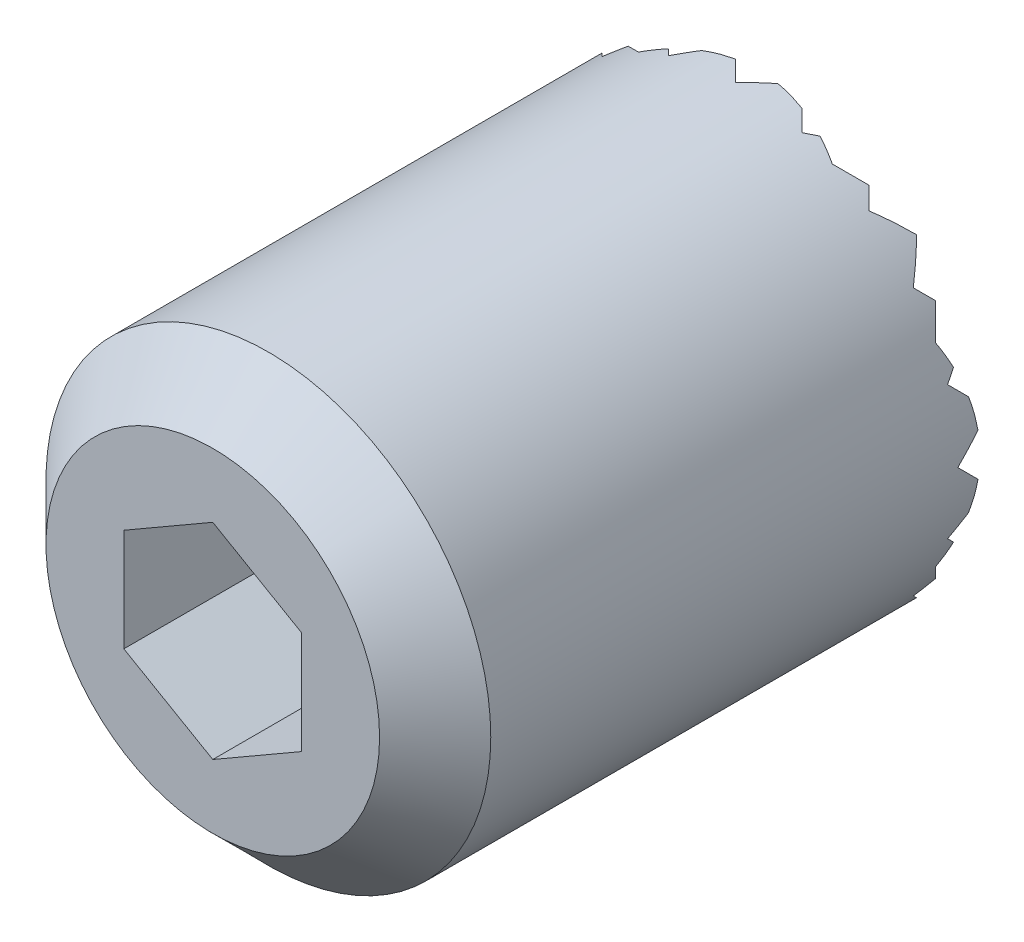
ISO-10303-21;
HEADER;
FILE_DESCRIPTION(('STEP AP214'),'2;1');
FILE_NAME('part.step','',(''),(''),'','','');
FILE_SCHEMA(('AUTOMOTIVE_DESIGN { 1 0 10303 214 1 1 1 1 }'));
ENDSEC;
DATA;
#1=APPLICATION_CONTEXT('core data for automotive mechanical design processes');
#2=APPLICATION_PROTOCOL_DEFINITION('international standard','automotive_design',2000,#1);
#3=PRODUCT_CONTEXT('',#1,'mechanical');
#4=PRODUCT('Part','Part','',(#3));
#5=PRODUCT_RELATED_PRODUCT_CATEGORY('part','',(#4));
#6=PRODUCT_DEFINITION_FORMATION('','',#4);
#7=PRODUCT_DEFINITION_CONTEXT('part definition',#1,'design');
#8=PRODUCT_DEFINITION('design','',#6,#7);
#9=PRODUCT_DEFINITION_SHAPE('','',#8);
#10=(LENGTH_UNIT() NAMED_UNIT(*) SI_UNIT(.MILLI.,.METRE.));
#11=(NAMED_UNIT(*) PLANE_ANGLE_UNIT() SI_UNIT($,.RADIAN.));
#12=(NAMED_UNIT(*) SI_UNIT($,.STERADIAN.) SOLID_ANGLE_UNIT());
#13=UNCERTAINTY_MEASURE_WITH_UNIT(LENGTH_MEASURE(1.E-05),#10,'distance_accuracy_value','');
#14=(GEOMETRIC_REPRESENTATION_CONTEXT(3) GLOBAL_UNCERTAINTY_ASSIGNED_CONTEXT((#13)) GLOBAL_UNIT_ASSIGNED_CONTEXT((#10,
#11,#12)) REPRESENTATION_CONTEXT('',''));
#15=CARTESIAN_POINT('',(0.,0.,0.));
#16=DIRECTION('',(0.,0.,1.));
#17=DIRECTION('',(1.,0.,0.));
#18=AXIS2_PLACEMENT_3D('',#15,#16,#17);
#19=CARTESIAN_POINT('',(2.9999999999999,-15.,1.5));
#20=DIRECTION('',(-0.707106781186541,0.,0.707106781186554));
#21=DIRECTION('',(0.707106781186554,0.,0.707106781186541));
#22=AXIS2_PLACEMENT_3D('',#19,#20,#21);
#23=PLANE('',#22);
#24=CARTESIAN_POINT('',(0.,0.,-1.5));
#25=DIRECTION('',(-0.707106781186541,0.,0.707106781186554));
#26=DIRECTION('',(0.707106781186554,0.,0.707106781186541));
#27=AXIS2_PLACEMENT_3D('',#24,#25,#26);
#28=ELLIPSE('',#27,14.1421356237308,10.);
#29=CARTESIAN_POINT('',(2.9999999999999,-9.53939201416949,1.5));
#30=VERTEX_POINT('',#29);
#31=CARTESIAN_POINT('',(2.25834261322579,-9.74165738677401,0.758342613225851));
#32=VERTEX_POINT('',#31);
#33=EDGE_CURVE('E631',#30,#32,#28,.F.);
#34=ORIENTED_EDGE('',*,*,#33,.T.);
#35=DIRECTION('',(0.577350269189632,0.577350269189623,0.577350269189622));
#36=VECTOR('',#35,1.);
#37=CARTESIAN_POINT('',(0.99999999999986,-11.,-0.5));
#38=LINE('',#37,#36);
#39=CARTESIAN_POINT('',(2.9999999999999,-8.9999999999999,1.5));
#40=VERTEX_POINT('',#39);
#41=EDGE_CURVE('E1101',#32,#40,#38,.T.);
#42=ORIENTED_EDGE('',*,*,#41,.T.);
#43=DIRECTION('',(0.,1.,0.));
#44=VECTOR('',#43,1.);
#45=CARTESIAN_POINT('',(2.9999999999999,-15.,1.5));
#46=LINE('',#45,#44);
#47=EDGE_CURVE('E517',#30,#40,#46,.T.);
#48=ORIENTED_EDGE('',*,*,#47,.F.);
#49=EDGE_LOOP('',(#34,#42,#48));
#50=FACE_BOUND('',#49,.T.);
#51=ADVANCED_FACE('F14',(#50),#23,.F.);
#52=CARTESIAN_POINT('',(2.9999999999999,9.,1.5));
#53=VERTEX_POINT('',#52);
#54=CARTESIAN_POINT('',(2.9999999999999,9.53939201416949,1.5));
#55=VERTEX_POINT('',#54);
#56=EDGE_CURVE('E509',#53,#55,#46,.T.);
#57=ORIENTED_EDGE('',*,*,#56,.F.);
#58=DIRECTION('',(-0.577350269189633,0.577350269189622,-0.577350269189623));
#59=VECTOR('',#58,1.);
#60=CARTESIAN_POINT('',(11.,1.00000000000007,9.5));
#61=LINE('',#60,#59);
#62=CARTESIAN_POINT('',(2.25834261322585,9.74165738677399,0.758342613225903));
#63=VERTEX_POINT('',#62);
#64=EDGE_CURVE('E1081',#53,#63,#61,.T.);
#65=ORIENTED_EDGE('',*,*,#64,.T.);
#66=EDGE_CURVE('E634',#63,#55,#28,.F.);
#67=ORIENTED_EDGE('',*,*,#66,.T.);
#68=EDGE_LOOP('',(#57,#65,#67));
#69=FACE_BOUND('',#68,.T.);
#70=ADVANCED_FACE('F1209',(#69),#23,.F.);
#71=CARTESIAN_POINT('',(1.4999999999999,-15.,0.));
#72=DIRECTION('',(0.70710678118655,0.,0.707106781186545));
#73=DIRECTION('',(0.707106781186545,0.,-0.70710678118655));
#74=AXIS2_PLACEMENT_3D('',#71,#72,#73);
#75=PLANE('',#74);
#76=DIRECTION('',(0.,1.,0.));
#77=VECTOR('',#76,1.);
#78=CARTESIAN_POINT('',(0.,-15.,1.5));
#79=LINE('',#78,#77);
#80=CARTESIAN_POINT('',(0.,-10.,1.5));
#81=VERTEX_POINT('',#80);
#82=CARTESIAN_POINT('',(-1.38127356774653E-13,-9.,1.5));
#83=VERTEX_POINT('',#82);
#84=EDGE_CURVE('E529',#81,#83,#79,.T.);
#85=ORIENTED_EDGE('',*,*,#84,.T.);
#86=DIRECTION('',(0.577350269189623,-0.577350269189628,-0.577350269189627));
#87=VECTOR('',#86,1.);
#88=CARTESIAN_POINT('',(2.99999999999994,-12.,-1.5));
#89=LINE('',#88,#87);
#90=CARTESIAN_POINT('',(0.954356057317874,-9.95435605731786,0.545643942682));
#91=VERTEX_POINT('',#90);
#92=EDGE_CURVE('E1105',#83,#91,#89,.T.);
#93=ORIENTED_EDGE('',*,*,#92,.T.);
#94=CARTESIAN_POINT('',(0.,0.,1.5));
#95=DIRECTION('',(0.70710678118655,0.,0.707106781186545));
#96=DIRECTION('',(-0.707106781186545,0.,0.70710678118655));
#97=AXIS2_PLACEMENT_3D('',#94,#95,#96);
#98=ELLIPSE('',#97,14.142135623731,10.);
#99=EDGE_CURVE('E635',#91,#81,#98,.F.);
#100=ORIENTED_EDGE('',*,*,#99,.T.);
#101=EDGE_LOOP('',(#85,#93,#100));
#102=FACE_BOUND('',#101,.T.);
#103=ADVANCED_FACE('F1127',(#102),#75,.F.);
#104=CARTESIAN_POINT('',(0.,10.,1.5));
#105=VERTEX_POINT('',#104);
#106=CARTESIAN_POINT('',(0.95435605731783,9.95435605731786,0.545643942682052));
#107=VERTEX_POINT('',#106);
#108=EDGE_CURVE('E637',#105,#107,#98,.F.);
#109=ORIENTED_EDGE('',*,*,#108,.T.);
#110=DIRECTION('',(-0.577350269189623,-0.577350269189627,0.577350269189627));
#111=VECTOR('',#110,1.);
#112=CARTESIAN_POINT('',(-7.,1.99999999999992,8.5));
#113=LINE('',#112,#111);
#114=CARTESIAN_POINT('',(-1.06685493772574E-13,9.,1.5));
#115=VERTEX_POINT('',#114);
#116=EDGE_CURVE('E1088',#107,#115,#113,.T.);
#117=ORIENTED_EDGE('',*,*,#116,.T.);
#118=EDGE_CURVE('E534',#115,#105,#79,.T.);
#119=ORIENTED_EDGE('',*,*,#118,.T.);
#120=EDGE_LOOP('',(#109,#117,#119));
#121=FACE_BOUND('',#120,.T.);
#122=ADVANCED_FACE('F1707',(#121),#75,.F.);
#123=CARTESIAN_POINT('',(0.,-15.,1.5));
#124=DIRECTION('',(-0.70710678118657,0.,0.707106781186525));
#125=DIRECTION('',(0.707106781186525,0.,0.70710678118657));
#126=AXIS2_PLACEMENT_3D('',#123,#124,#125);
#127=PLANE('',#126);
#128=CARTESIAN_POINT('',(0.,0.,1.5));
#129=DIRECTION('',(-0.70710678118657,0.,0.707106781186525));
#130=DIRECTION('',(0.707106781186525,0.,0.70710678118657));
#131=AXIS2_PLACEMENT_3D('',#128,#129,#130);
#132=ELLIPSE('',#131,14.1421356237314,10.);
#133=CARTESIAN_POINT('',(-0.954356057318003,-9.95435605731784,0.545643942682));
#134=VERTEX_POINT('',#133);
#135=EDGE_CURVE('E638',#81,#134,#132,.F.);
#136=ORIENTED_EDGE('',*,*,#135,.T.);
#137=DIRECTION('',(0.577350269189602,0.577350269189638,0.577350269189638));
#138=VECTOR('',#137,1.);
#139=CARTESIAN_POINT('',(-2.0000000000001,-11.,-0.5));
#140=LINE('',#139,#138);
#141=EDGE_CURVE('E1108',#134,#83,#140,.T.);
#142=ORIENTED_EDGE('',*,*,#141,.T.);
#143=ORIENTED_EDGE('',*,*,#84,.F.);
#144=EDGE_LOOP('',(#136,#142,#143));
#145=FACE_BOUND('',#144,.T.);
#146=ADVANCED_FACE('F1132',(#145),#127,.F.);
#147=ORIENTED_EDGE('',*,*,#118,.F.);
#148=DIRECTION('',(-0.577350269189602,0.577350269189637,-0.577350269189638));
#149=VECTOR('',#148,1.);
#150=CARTESIAN_POINT('',(7.99999999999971,0.999999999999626,9.5000000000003));
#151=LINE('',#150,#149);
#152=CARTESIAN_POINT('',(-0.954356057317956,9.95435605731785,0.545643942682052));
#153=VERTEX_POINT('',#152);
#154=EDGE_CURVE('E1091',#115,#153,#151,.T.);
#155=ORIENTED_EDGE('',*,*,#154,.T.);
#156=EDGE_CURVE('E641',#153,#105,#132,.F.);
#157=ORIENTED_EDGE('',*,*,#156,.T.);
#158=EDGE_LOOP('',(#147,#155,#157));
#159=FACE_BOUND('',#158,.T.);
#160=ADVANCED_FACE('F1556',(#159),#127,.F.);
#161=CARTESIAN_POINT('',(-1.5,-15.,0.));
#162=DIRECTION('',(0.70710678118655,0.,0.707106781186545));
#163=DIRECTION('',(0.707106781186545,0.,-0.70710678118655));
#164=AXIS2_PLACEMENT_3D('',#161,#162,#163);
#165=PLANE('',#164);
#166=DIRECTION('',(0.,1.,0.));
#167=VECTOR('',#166,1.);
#168=CARTESIAN_POINT('',(-2.99999999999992,-15.,1.5));
#169=LINE('',#168,#167);
#170=CARTESIAN_POINT('',(-2.99999999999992,-9.53939201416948,1.5));
#171=VERTEX_POINT('',#170);
#172=CARTESIAN_POINT('',(-2.9999999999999,-9.,1.5));
#173=VERTEX_POINT('',#172);
#174=EDGE_CURVE('E535',#171,#173,#169,.T.);
#175=ORIENTED_EDGE('',*,*,#174,.T.);
#176=DIRECTION('',(0.577350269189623,-0.577350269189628,-0.577350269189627));
#177=VECTOR('',#176,1.);
#178=CARTESIAN_POINT('',(0.,-12.,-1.5));
#179=LINE('',#178,#177);
#180=CARTESIAN_POINT('',(-2.25834261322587,-9.74165738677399,0.758342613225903));
#181=VERTEX_POINT('',#180);
#182=EDGE_CURVE('E1110',#173,#181,#179,.T.);
#183=ORIENTED_EDGE('',*,*,#182,.T.);
#184=CARTESIAN_POINT('',(0.,0.,-1.5));
#185=DIRECTION('',(0.70710678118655,0.,0.707106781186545));
#186=DIRECTION('',(-0.707106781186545,0.,0.70710678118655));
#187=AXIS2_PLACEMENT_3D('',#184,#185,#186);
#188=ELLIPSE('',#187,14.142135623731,10.);
#189=EDGE_CURVE('E642',#181,#171,#188,.F.);
#190=ORIENTED_EDGE('',*,*,#189,.T.);
#191=EDGE_LOOP('',(#175,#183,#190));
#192=FACE_BOUND('',#191,.T.);
#193=ADVANCED_FACE('F2020',(#192),#165,.F.);
#194=CARTESIAN_POINT('',(-2.99999999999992,9.53939201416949,1.5));
#195=VERTEX_POINT('',#194);
#196=CARTESIAN_POINT('',(-2.25834261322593,9.74165738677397,0.758342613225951));
#197=VERTEX_POINT('',#196);
#198=EDGE_CURVE('E644',#195,#197,#188,.F.);
#199=ORIENTED_EDGE('',*,*,#198,.T.);
#200=DIRECTION('',(-0.577350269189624,-0.577350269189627,0.577350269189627));
#201=VECTOR('',#200,1.);
#202=CARTESIAN_POINT('',(-10.,1.99999999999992,8.5));
#203=LINE('',#202,#201);
#204=CARTESIAN_POINT('',(-2.99999999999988,9.,1.5));
#205=VERTEX_POINT('',#204);
#206=EDGE_CURVE('E1095',#197,#205,#203,.T.);
#207=ORIENTED_EDGE('',*,*,#206,.T.);
#208=EDGE_CURVE('E539',#205,#195,#169,.T.);
#209=ORIENTED_EDGE('',*,*,#208,.T.);
#210=EDGE_LOOP('',(#199,#207,#209));
#211=FACE_BOUND('',#210,.T.);
#212=ADVANCED_FACE('F1504',(#211),#165,.F.);
#213=CARTESIAN_POINT('',(-2.99999999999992,-15.,1.5));
#214=DIRECTION('',(-0.707106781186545,0.,0.70710678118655));
#215=DIRECTION('',(0.70710678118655,0.,0.707106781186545));
#216=AXIS2_PLACEMENT_3D('',#213,#214,#215);
#217=PLANE('',#216);
#218=CARTESIAN_POINT('',(0.,0.,4.5));
#219=DIRECTION('',(-0.707106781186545,0.,0.70710678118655));
#220=DIRECTION('',(0.70710678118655,0.,0.707106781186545));
#221=AXIS2_PLACEMENT_3D('',#218,#219,#220);
#222=ELLIPSE('',#221,14.1421356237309,10.);
#223=CARTESIAN_POINT('',(-3.40312423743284,-9.40312423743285,1.096875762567));
#224=VERTEX_POINT('',#223);
#225=EDGE_CURVE('E645',#171,#224,#222,.F.);
#226=ORIENTED_EDGE('',*,*,#225,.T.);
#227=DIRECTION('',(0.577350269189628,0.577350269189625,0.577350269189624));
#228=VECTOR('',#227,1.);
#229=CARTESIAN_POINT('',(-5.,-11.,-0.5));
#230=LINE('',#229,#228);
#231=EDGE_CURVE('E731',#224,#173,#230,.T.);
#232=ORIENTED_EDGE('',*,*,#231,.T.);
#233=ORIENTED_EDGE('',*,*,#174,.F.);
#234=EDGE_LOOP('',(#226,#232,#233));
#235=FACE_BOUND('',#234,.T.);
#236=ADVANCED_FACE('F2027',(#235),#217,.F.);
#237=ORIENTED_EDGE('',*,*,#208,.F.);
#238=DIRECTION('',(-0.577350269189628,0.577350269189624,-0.577350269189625));
#239=VECTOR('',#238,1.);
#240=CARTESIAN_POINT('',(5.00000000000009,1.00000000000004,9.5));
#241=LINE('',#240,#239);
#242=CARTESIAN_POINT('',(-3.4031242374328,9.40312423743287,1.09687576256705));
#243=VERTEX_POINT('',#242);
#244=EDGE_CURVE('E1098',#205,#243,#241,.T.);
#245=ORIENTED_EDGE('',*,*,#244,.T.);
#246=EDGE_CURVE('E648',#243,#195,#222,.F.);
#247=ORIENTED_EDGE('',*,*,#246,.T.);
#248=EDGE_LOOP('',(#237,#245,#247));
#249=FACE_BOUND('',#248,.T.);
#250=ADVANCED_FACE('F1496',(#249),#217,.F.);
#251=CARTESIAN_POINT('',(-4.49999999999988,-15.,0.));
#252=DIRECTION('',(0.707106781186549,0.,0.707106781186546));
#253=DIRECTION('',(0.707106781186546,0.,-0.707106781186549));
#254=AXIS2_PLACEMENT_3D('',#251,#252,#253);
#255=PLANE('',#254);
#256=DIRECTION('',(0.577350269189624,-0.577350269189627,-0.577350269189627));
#257=VECTOR('',#256,1.);
#258=CARTESIAN_POINT('',(-1.99999999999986,-10.,-2.5));
#259=LINE('',#258,#257);
#260=CARTESIAN_POINT('',(-5.99999999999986,-6.,1.5));
#261=VERTEX_POINT('',#260);
#262=CARTESIAN_POINT('',(-4.49999999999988,-7.5,0.));
#263=VERTEX_POINT('',#262);
#264=EDGE_CURVE('E772',#261,#263,#259,.T.);
#265=ORIENTED_EDGE('',*,*,#264,.T.);
#266=DIRECTION('',(-0.577350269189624,-0.577350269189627,0.577350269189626));
#267=VECTOR('',#266,1.);
#268=CARTESIAN_POINT('',(-6.99999999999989,-10.,2.5));
#269=LINE('',#268,#267);
#270=CARTESIAN_POINT('',(-5.41013748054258,-8.41013748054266,0.910137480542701));
#271=VERTEX_POINT('',#270);
#272=EDGE_CURVE('E751',#263,#271,#269,.T.);
#273=ORIENTED_EDGE('',*,*,#272,.T.);
#274=CARTESIAN_POINT('',(0.,0.,-4.5));
#275=DIRECTION('',(0.707106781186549,0.,0.707106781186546));
#276=DIRECTION('',(-0.707106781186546,0.,0.707106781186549));
#277=AXIS2_PLACEMENT_3D('',#274,#275,#276);
#278=ELLIPSE('',#277,14.142135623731,10.);
#279=CARTESIAN_POINT('',(-5.99999999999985,-8.00000000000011,1.5));
#280=VERTEX_POINT('',#279);
#281=EDGE_CURVE('E649',#271,#280,#278,.F.);
#282=ORIENTED_EDGE('',*,*,#281,.T.);
#283=DIRECTION('',(0.,1.,0.));
#284=VECTOR('',#283,1.);
#285=CARTESIAN_POINT('',(-5.99999999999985,-15.,1.5));
#286=LINE('',#285,#284);
#287=EDGE_CURVE('E540',#280,#261,#286,.T.);
#288=ORIENTED_EDGE('',*,*,#287,.T.);
#289=EDGE_LOOP('',(#265,#273,#282,#288));
#290=FACE_BOUND('',#289,.T.);
#291=ADVANCED_FACE('F1989',(#290),#255,.F.);
#292=CARTESIAN_POINT('',(-5.99999999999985,8.00000000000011,1.5));
#293=VERTEX_POINT('',#292);
#294=CARTESIAN_POINT('',(-5.41013748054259,8.41013748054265,0.910137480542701));
#295=VERTEX_POINT('',#294);
#296=EDGE_CURVE('E651',#293,#295,#278,.F.);
#297=ORIENTED_EDGE('',*,*,#296,.T.);
#298=DIRECTION('',(0.577350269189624,-0.577350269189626,-0.577350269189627));
#299=VECTOR('',#298,1.);
#300=CARTESIAN_POINT('',(3.00000000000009,0.,-7.5));
#301=LINE('',#300,#299);
#302=CARTESIAN_POINT('',(-4.49999999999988,7.5,0.));
#303=VERTEX_POINT('',#302);
#304=EDGE_CURVE('E1079',#295,#303,#301,.T.);
#305=ORIENTED_EDGE('',*,*,#304,.T.);
#306=DIRECTION('',(-0.577350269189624,-0.577350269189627,0.577350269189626));
#307=VECTOR('',#306,1.);
#308=CARTESIAN_POINT('',(-11.9999999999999,0.,7.5));
#309=LINE('',#308,#307);
#310=CARTESIAN_POINT('',(-5.99999999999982,6.,1.5));
#311=VERTEX_POINT('',#310);
#312=EDGE_CURVE('E1053',#303,#311,#309,.T.);
#313=ORIENTED_EDGE('',*,*,#312,.T.);
#314=EDGE_CURVE('E544',#311,#293,#286,.T.);
#315=ORIENTED_EDGE('',*,*,#314,.T.);
#316=EDGE_LOOP('',(#297,#305,#313,#315));
#317=FACE_BOUND('',#316,.T.);
#318=ADVANCED_FACE('F2634',(#317),#255,.F.);
#319=CARTESIAN_POINT('',(-5.99999999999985,-15.,1.5));
#320=DIRECTION('',(-0.707106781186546,0.,0.70710678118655));
#321=DIRECTION('',(0.70710678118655,0.,0.707106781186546));
#322=AXIS2_PLACEMENT_3D('',#319,#320,#321);
#323=PLANE('',#322);
#324=CARTESIAN_POINT('',(0.,0.,7.5));
#325=DIRECTION('',(-0.707106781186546,0.,0.70710678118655));
#326=DIRECTION('',(0.70710678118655,0.,0.707106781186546));
#327=AXIS2_PLACEMENT_3D('',#324,#325,#326);
#328=ELLIPSE('',#327,14.1421356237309,10.);
#329=CARTESIAN_POINT('',(-7.07106781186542,-7.07106781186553,0.428932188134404));
#330=VERTEX_POINT('',#329);
#331=EDGE_CURVE('E652',#280,#330,#328,.F.);
#332=ORIENTED_EDGE('',*,*,#331,.T.);
#333=DIRECTION('',(0.577350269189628,0.577350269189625,0.577350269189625));
#334=VECTOR('',#333,1.);
#335=CARTESIAN_POINT('',(-8.99999999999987,-9.,-1.5));
#336=LINE('',#335,#334);
#337=EDGE_CURVE('E774',#330,#261,#336,.T.);
#338=ORIENTED_EDGE('',*,*,#337,.T.);
#339=ORIENTED_EDGE('',*,*,#287,.F.);
#340=EDGE_LOOP('',(#332,#338,#339));
#341=FACE_BOUND('',#340,.T.);
#342=ADVANCED_FACE('F1983',(#341),#323,.F.);
#343=ORIENTED_EDGE('',*,*,#314,.F.);
#344=DIRECTION('',(-0.577350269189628,0.577350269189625,-0.577350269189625));
#345=VECTOR('',#344,1.);
#346=CARTESIAN_POINT('',(1.00000000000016,-1.,8.5));
#347=LINE('',#346,#345);
#348=CARTESIAN_POINT('',(-7.07106781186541,7.07106781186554,0.428932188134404));
#349=VERTEX_POINT('',#348);
#350=EDGE_CURVE('E1056',#311,#349,#347,.T.);
#351=ORIENTED_EDGE('',*,*,#350,.T.);
#352=EDGE_CURVE('E655',#349,#293,#328,.F.);
#353=ORIENTED_EDGE('',*,*,#352,.T.);
#354=EDGE_LOOP('',(#343,#351,#353));
#355=FACE_BOUND('',#354,.T.);
#356=ADVANCED_FACE('F2629',(#355),#323,.F.);
#357=CARTESIAN_POINT('',(-7.49999999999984,-15.,0.));
#358=DIRECTION('',(0.70710678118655,0.,0.707106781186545));
#359=DIRECTION('',(0.707106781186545,0.,-0.70710678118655));
#360=AXIS2_PLACEMENT_3D('',#357,#358,#359);
#361=PLANE('',#360);
#362=DIRECTION('',(0.577350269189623,-0.577350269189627,-0.577350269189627));
#363=VECTOR('',#362,1.);
#364=CARTESIAN_POINT('',(-3.99999999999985,-8.,-3.5));
#365=LINE('',#364,#363);
#366=CARTESIAN_POINT('',(-8.99999999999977,-3.,1.5));
#367=VERTEX_POINT('',#366);
#368=CARTESIAN_POINT('',(-7.49999999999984,-4.5,0.));
#369=VERTEX_POINT('',#368);
#370=EDGE_CURVE('E845',#367,#369,#365,.T.);
#371=ORIENTED_EDGE('',*,*,#370,.T.);
#372=DIRECTION('',(-0.577350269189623,-0.577350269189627,0.577350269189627));
#373=VECTOR('',#372,1.);
#374=CARTESIAN_POINT('',(-10.9999999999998,-8.,3.5));
#375=LINE('',#374,#373);
#376=CARTESIAN_POINT('',(-8.41013748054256,-5.41013748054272,0.910137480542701));
#377=VERTEX_POINT('',#376);
#378=EDGE_CURVE('E808',#369,#377,#375,.T.);
#379=ORIENTED_EDGE('',*,*,#378,.T.);
#380=CARTESIAN_POINT('',(0.,0.,-7.5));
#381=DIRECTION('',(0.70710678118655,0.,0.707106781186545));
#382=DIRECTION('',(-0.707106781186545,0.,0.70710678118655));
#383=AXIS2_PLACEMENT_3D('',#380,#381,#382);
#384=ELLIPSE('',#383,14.142135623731,10.);
#385=CARTESIAN_POINT('',(-8.9999999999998,-4.35889894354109,1.5));
#386=VERTEX_POINT('',#385);
#387=EDGE_CURVE('E656',#377,#386,#384,.F.);
#388=ORIENTED_EDGE('',*,*,#387,.T.);
#389=DIRECTION('',(0.,1.,0.));
#390=VECTOR('',#389,1.);
#391=CARTESIAN_POINT('',(-8.9999999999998,-15.,1.5));
#392=LINE('',#391,#390);
#393=EDGE_CURVE('E545',#386,#367,#392,.T.);
#394=ORIENTED_EDGE('',*,*,#393,.T.);
#395=EDGE_LOOP('',(#371,#379,#388,#394));
#396=FACE_BOUND('',#395,.T.);
#397=ADVANCED_FACE('F1453',(#396),#361,.F.);
#398=DIRECTION('',(0.577350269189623,-0.577350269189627,-0.577350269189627));
#399=VECTOR('',#398,1.);
#400=CARTESIAN_POINT('',(-2.99999999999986,-6.,-4.5));
#401=LINE('',#400,#399);
#402=CARTESIAN_POINT('',(-8.99999999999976,0.,1.5));
#403=VERTEX_POINT('',#402);
#404=CARTESIAN_POINT('',(-7.49999999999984,-1.5,0.));
#405=VERTEX_POINT('',#404);
#406=EDGE_CURVE('E924',#403,#405,#401,.T.);
#407=ORIENTED_EDGE('',*,*,#406,.T.);
#408=DIRECTION('',(-0.577350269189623,-0.577350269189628,0.577350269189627));
#409=VECTOR('',#408,1.);
#410=CARTESIAN_POINT('',(-11.9999999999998,-6.,4.5));
#411=LINE('',#410,#409);
#412=EDGE_CURVE('E884',#405,#367,#411,.T.);
#413=ORIENTED_EDGE('',*,*,#412,.T.);
#414=EDGE_CURVE('E548',#367,#403,#392,.T.);
#415=ORIENTED_EDGE('',*,*,#414,.T.);
#416=EDGE_LOOP('',(#407,#413,#415));
#417=FACE_BOUND('',#416,.T.);
#418=ADVANCED_FACE('F1464',(#417),#361,.F.);
#419=DIRECTION('',(0.577350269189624,-0.577350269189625,-0.577350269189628));
#420=VECTOR('',#419,1.);
#421=CARTESIAN_POINT('',(-1.99999999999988,-4.,-5.5));
#422=LINE('',#421,#420);
#423=CARTESIAN_POINT('',(-8.99999999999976,3.,1.5));
#424=VERTEX_POINT('',#423);
#425=CARTESIAN_POINT('',(-7.49999999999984,1.5,0.));
#426=VERTEX_POINT('',#425);
#427=EDGE_CURVE('E519',#424,#426,#422,.T.);
#428=ORIENTED_EDGE('',*,*,#427,.T.);
#429=DIRECTION('',(-0.577350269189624,-0.577350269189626,0.577350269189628));
#430=VECTOR('',#429,1.);
#431=CARTESIAN_POINT('',(-12.9999999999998,-4.,5.5));
#432=LINE('',#431,#430);
#433=EDGE_CURVE('E965',#426,#403,#432,.T.);
#434=ORIENTED_EDGE('',*,*,#433,.T.);
#435=EDGE_CURVE('E1470',#403,#424,#392,.T.);
#436=ORIENTED_EDGE('',*,*,#435,.T.);
#437=EDGE_LOOP('',(#428,#434,#436));
#438=FACE_BOUND('',#437,.T.);
#439=ADVANCED_FACE('F2802',(#438),#361,.F.);
#440=CARTESIAN_POINT('',(-8.9999999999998,-15.,1.5));
#441=DIRECTION('',(-0.707106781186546,0.,0.70710678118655));
#442=DIRECTION('',(0.70710678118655,0.,0.707106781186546));
#443=AXIS2_PLACEMENT_3D('',#440,#441,#442);
#444=PLANE('',#443);
#445=ORIENTED_EDGE('',*,*,#435,.F.);
#446=DIRECTION('',(-0.577350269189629,0.577350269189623,-0.577350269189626));
#447=VECTOR('',#446,1.);
#448=CARTESIAN_POINT('',(-3.99999999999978,-4.99999999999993,6.5));
#449=LINE('',#448,#447);
#450=CARTESIAN_POINT('',(-9.95435605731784,0.954356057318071,0.5456439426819));
#451=VERTEX_POINT('',#450);
#452=EDGE_CURVE('E968',#403,#451,#449,.T.);
#453=ORIENTED_EDGE('',*,*,#452,.T.);
#454=CARTESIAN_POINT('',(0.,0.,10.4999999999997));
#455=DIRECTION('',(-0.707106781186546,0.,0.70710678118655));
#456=DIRECTION('',(0.70710678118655,0.,0.707106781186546));
#457=AXIS2_PLACEMENT_3D('',#454,#455,#456);
#458=ELLIPSE('',#457,14.1421356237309,10.);
#459=CARTESIAN_POINT('',(-9.74165738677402,2.25834261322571,0.75834261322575));
#460=VERTEX_POINT('',#459);
#461=EDGE_CURVE('E1482',#451,#460,#458,.F.);
#462=ORIENTED_EDGE('',*,*,#461,.T.);
#463=DIRECTION('',(0.577350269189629,0.577350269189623,0.577350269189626));
#464=VECTOR('',#463,1.);
#465=CARTESIAN_POINT('',(-14.9999999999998,-3.,-4.5));
#466=LINE('',#465,#464);
#467=EDGE_CURVE('E510',#460,#424,#466,.T.);
#468=ORIENTED_EDGE('',*,*,#467,.T.);
#469=EDGE_LOOP('',(#445,#453,#462,#468));
#470=FACE_BOUND('',#469,.T.);
#471=ADVANCED_FACE('F2803',(#470),#444,.F.);
#472=CARTESIAN_POINT('',(-9.74165738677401,-2.25834261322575,0.75834261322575));
#473=VERTEX_POINT('',#472);
#474=CARTESIAN_POINT('',(-9.95435605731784,-0.954356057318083,0.5456439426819));
#475=VERTEX_POINT('',#474);
#476=EDGE_CURVE('E662',#473,#475,#458,.F.);
#477=ORIENTED_EDGE('',*,*,#476,.T.);
#478=DIRECTION('',(0.577350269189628,0.577350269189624,0.577350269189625));
#479=VECTOR('',#478,1.);
#480=CARTESIAN_POINT('',(-13.9999999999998,-5.,-3.5));
#481=LINE('',#480,#479);
#482=EDGE_CURVE('E926',#475,#403,#481,.T.);
#483=ORIENTED_EDGE('',*,*,#482,.T.);
#484=ORIENTED_EDGE('',*,*,#414,.F.);
#485=DIRECTION('',(-0.577350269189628,0.577350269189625,-0.577350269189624));
#486=VECTOR('',#485,1.);
#487=CARTESIAN_POINT('',(-4.99999999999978,-7.,5.5));
#488=LINE('',#487,#486);
#489=EDGE_CURVE('E887',#367,#473,#488,.T.);
#490=ORIENTED_EDGE('',*,*,#489,.T.);
#491=EDGE_LOOP('',(#477,#483,#484,#490));
#492=FACE_BOUND('',#491,.T.);
#493=ADVANCED_FACE('F1467',(#492),#444,.F.);
#494=CARTESIAN_POINT('',(-9.40312423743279,-3.40312423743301,1.09687576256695));
#495=VERTEX_POINT('',#494);
#496=EDGE_CURVE('E659',#386,#495,#458,.F.);
#497=ORIENTED_EDGE('',*,*,#496,.T.);
#498=DIRECTION('',(0.577350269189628,0.577350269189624,0.577350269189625));
#499=VECTOR('',#498,1.);
#500=CARTESIAN_POINT('',(-12.9999999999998,-7.,-2.5));
#501=LINE('',#500,#499);
#502=EDGE_CURVE('E847',#495,#367,#501,.T.);
#503=ORIENTED_EDGE('',*,*,#502,.T.);
#504=ORIENTED_EDGE('',*,*,#393,.F.);
#505=EDGE_LOOP('',(#497,#503,#504));
#506=FACE_BOUND('',#505,.T.);
#507=ADVANCED_FACE('F1458',(#506),#444,.F.);
#508=CARTESIAN_POINT('',(10.4999999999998,-15.,0.));
#509=DIRECTION('',(0.70710678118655,0.,0.707106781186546));
#510=DIRECTION('',(0.707106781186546,0.,-0.70710678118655));
#511=AXIS2_PLACEMENT_3D('',#508,#509,#510);
#512=PLANE('',#511);
#513=CARTESIAN_POINT('',(0.,0.,10.4999999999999));
#514=DIRECTION('',(0.70710678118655,0.,0.707106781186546));
#515=DIRECTION('',(-0.707106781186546,0.,0.70710678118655));
#516=AXIS2_PLACEMENT_3D('',#513,#514,#515);
#517=ELLIPSE('',#516,14.142135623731,10.);
#518=CARTESIAN_POINT('',(9.741657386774,2.25834261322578,0.758342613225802));
#519=VERTEX_POINT('',#518);
#520=CARTESIAN_POINT('',(9.95435605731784,0.954356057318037,0.545643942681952));
#521=VERTEX_POINT('',#520);
#522=EDGE_CURVE('E499',#519,#521,#517,.F.);
#523=ORIENTED_EDGE('',*,*,#522,.T.);
#524=DIRECTION('',(-0.577350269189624,-0.577350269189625,0.577350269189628));
#525=VECTOR('',#524,1.);
#526=CARTESIAN_POINT('',(4.99999999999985,-4.,5.5));
#527=LINE('',#526,#525);
#528=CARTESIAN_POINT('',(9.,0.,1.5));
#529=VERTEX_POINT('',#528);
#530=EDGE_CURVE('E938',#521,#529,#527,.T.);
#531=ORIENTED_EDGE('',*,*,#530,.T.);
#532=DIRECTION('',(0.,1.,0.));
#533=VECTOR('',#532,1.);
#534=CARTESIAN_POINT('',(8.99999999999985,-15.,1.5));
#535=LINE('',#534,#533);
#536=CARTESIAN_POINT('',(8.9999999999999,3.,1.5));
#537=VERTEX_POINT('',#536);
#538=EDGE_CURVE('E984',#529,#537,#535,.T.);
#539=ORIENTED_EDGE('',*,*,#538,.T.);
#540=DIRECTION('',(0.577350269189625,-0.577350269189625,-0.577350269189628));
#541=VECTOR('',#540,1.);
#542=CARTESIAN_POINT('',(16.,-4.,-5.5));
#543=LINE('',#542,#541);
#544=EDGE_CURVE('E488',#537,#519,#543,.T.);
#545=ORIENTED_EDGE('',*,*,#544,.T.);
#546=EDGE_LOOP('',(#523,#531,#539,#545));
#547=FACE_BOUND('',#546,.T.);
#548=ADVANCED_FACE('F982',(#547),#512,.F.);
#549=CARTESIAN_POINT('',(8.99999999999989,-3.,1.5));
#550=VERTEX_POINT('',#549);
#551=EDGE_CURVE('E553',#550,#529,#535,.T.);
#552=ORIENTED_EDGE('',*,*,#551,.T.);
#553=DIRECTION('',(0.577350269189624,-0.577350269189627,-0.577350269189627));
#554=VECTOR('',#553,1.);
#555=CARTESIAN_POINT('',(14.9999999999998,-6.,-4.5));
#556=LINE('',#555,#554);
#557=CARTESIAN_POINT('',(9.95435605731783,-0.954356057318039,0.545643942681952));
#558=VERTEX_POINT('',#557);
#559=EDGE_CURVE('E899',#529,#558,#556,.T.);
#560=ORIENTED_EDGE('',*,*,#559,.T.);
#561=CARTESIAN_POINT('',(9.741657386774,-2.2583426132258,0.758342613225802));
#562=VERTEX_POINT('',#561);
#563=EDGE_CURVE('E1952',#558,#562,#517,.F.);
#564=ORIENTED_EDGE('',*,*,#563,.T.);
#565=DIRECTION('',(-0.577350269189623,-0.577350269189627,0.577350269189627));
#566=VECTOR('',#565,1.);
#567=CARTESIAN_POINT('',(5.99999999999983,-6.,4.5));
#568=LINE('',#567,#566);
#569=EDGE_CURVE('E859',#562,#550,#568,.T.);
#570=ORIENTED_EDGE('',*,*,#569,.T.);
#571=EDGE_LOOP('',(#552,#560,#564,#570));
#572=FACE_BOUND('',#571,.T.);
#573=ADVANCED_FACE('F1950',(#572),#512,.F.);
#574=CARTESIAN_POINT('',(8.99999999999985,-4.35889894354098,1.5));
#575=VERTEX_POINT('',#574);
#576=EDGE_CURVE('E550',#575,#550,#535,.T.);
#577=ORIENTED_EDGE('',*,*,#576,.T.);
#578=DIRECTION('',(0.577350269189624,-0.577350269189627,-0.577350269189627));
#579=VECTOR('',#578,1.);
#580=CARTESIAN_POINT('',(13.9999999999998,-8.,-3.5));
#581=LINE('',#580,#579);
#582=CARTESIAN_POINT('',(9.4031242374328,-3.40312423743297,1.096875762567));
#583=VERTEX_POINT('',#582);
#584=EDGE_CURVE('E820',#550,#583,#581,.T.);
#585=ORIENTED_EDGE('',*,*,#584,.T.);
#586=EDGE_CURVE('E627',#583,#575,#517,.F.);
#587=ORIENTED_EDGE('',*,*,#586,.T.);
#588=EDGE_LOOP('',(#577,#585,#587));
#589=FACE_BOUND('',#588,.T.);
#590=ADVANCED_FACE('F1960',(#589),#512,.F.);
#591=CARTESIAN_POINT('',(8.99999999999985,-15.,1.5));
#592=DIRECTION('',(-0.707106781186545,0.,0.70710678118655));
#593=DIRECTION('',(0.70710678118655,0.,0.707106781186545));
#594=AXIS2_PLACEMENT_3D('',#591,#592,#593);
#595=PLANE('',#594);
#596=CARTESIAN_POINT('',(0.,0.,-7.5));
#597=DIRECTION('',(-0.707106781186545,0.,0.70710678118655));
#598=DIRECTION('',(0.70710678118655,0.,0.707106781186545));
#599=AXIS2_PLACEMENT_3D('',#596,#597,#598);
#600=ELLIPSE('',#599,14.1421356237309,10.);
#601=CARTESIAN_POINT('',(8.41013748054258,-5.41013748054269,0.910137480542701));
#602=VERTEX_POINT('',#601);
#603=EDGE_CURVE('E623',#575,#602,#600,.F.);
#604=ORIENTED_EDGE('',*,*,#603,.T.);
#605=DIRECTION('',(-0.577350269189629,0.577350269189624,-0.577350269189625));
#606=VECTOR('',#605,1.);
#607=CARTESIAN_POINT('',(11.9999999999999,-9.,4.5));
#608=LINE('',#607,#606);
#609=CARTESIAN_POINT('',(7.49999999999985,-4.5,0.));
#610=VERTEX_POINT('',#609);
#611=EDGE_CURVE('E783',#602,#610,#608,.T.);
#612=ORIENTED_EDGE('',*,*,#611,.T.);
#613=DIRECTION('',(0.577350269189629,0.577350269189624,0.577350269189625));
#614=VECTOR('',#613,1.);
#615=CARTESIAN_POINT('',(4.99999999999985,-7.,-2.5));
#616=LINE('',#615,#614);
#617=EDGE_CURVE('E817',#610,#550,#616,.T.);
#618=ORIENTED_EDGE('',*,*,#617,.T.);
#619=ORIENTED_EDGE('',*,*,#576,.F.);
#620=EDGE_LOOP('',(#604,#612,#618,#619));
#621=FACE_BOUND('',#620,.T.);
#622=ADVANCED_FACE('F1957',(#621),#595,.F.);
#623=ORIENTED_EDGE('',*,*,#551,.F.);
#624=DIRECTION('',(-0.577350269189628,0.577350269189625,-0.577350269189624));
#625=VECTOR('',#624,1.);
#626=CARTESIAN_POINT('',(12.9999999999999,-7.,5.5));
#627=LINE('',#626,#625);
#628=CARTESIAN_POINT('',(7.49999999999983,-1.5,0.));
#629=VERTEX_POINT('',#628);
#630=EDGE_CURVE('E856',#550,#629,#627,.T.);
#631=ORIENTED_EDGE('',*,*,#630,.T.);
#632=DIRECTION('',(0.577350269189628,0.577350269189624,0.577350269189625));
#633=VECTOR('',#632,1.);
#634=CARTESIAN_POINT('',(3.99999999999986,-5.,-3.5));
#635=LINE('',#634,#633);
#636=EDGE_CURVE('E896',#629,#529,#635,.T.);
#637=ORIENTED_EDGE('',*,*,#636,.T.);
#638=EDGE_LOOP('',(#623,#631,#637));
#639=FACE_BOUND('',#638,.T.);
#640=ADVANCED_FACE('F1947',(#639),#595,.F.);
#641=ORIENTED_EDGE('',*,*,#538,.F.);
#642=DIRECTION('',(-0.577350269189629,0.577350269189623,-0.577350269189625));
#643=VECTOR('',#642,1.);
#644=CARTESIAN_POINT('',(13.9999999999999,-4.99999999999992,6.5));
#645=LINE('',#644,#643);
#646=CARTESIAN_POINT('',(7.49999999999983,1.5,0.));
#647=VERTEX_POINT('',#646);
#648=EDGE_CURVE('E935',#529,#647,#645,.T.);
#649=ORIENTED_EDGE('',*,*,#648,.T.);
#650=DIRECTION('',(0.577350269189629,0.577350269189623,0.577350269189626));
#651=VECTOR('',#650,1.);
#652=CARTESIAN_POINT('',(2.99999999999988,-3.,-4.5));
#653=LINE('',#652,#651);
#654=EDGE_CURVE('E977',#647,#537,#653,.T.);
#655=ORIENTED_EDGE('',*,*,#654,.T.);
#656=EDGE_LOOP('',(#641,#649,#655));
#657=FACE_BOUND('',#656,.T.);
#658=ADVANCED_FACE('F2835',(#657),#595,.F.);
#659=CARTESIAN_POINT('',(7.49999999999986,-15.,0.));
#660=DIRECTION('',(0.707106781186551,0.,0.707106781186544));
#661=DIRECTION('',(0.707106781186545,0.,-0.707106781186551));
#662=AXIS2_PLACEMENT_3D('',#659,#660,#661);
#663=PLANE('',#662);
#664=DIRECTION('',(0.,1.,0.));
#665=VECTOR('',#664,1.);
#666=CARTESIAN_POINT('',(5.99999999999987,-15.,1.5));
#667=LINE('',#666,#665);
#668=CARTESIAN_POINT('',(5.99999999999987,-8.00000000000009,1.5));
#669=VERTEX_POINT('',#668);
#670=CARTESIAN_POINT('',(5.99999999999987,-6.,1.5));
#671=VERTEX_POINT('',#670);
#672=EDGE_CURVE('E555',#669,#671,#667,.T.);
#673=ORIENTED_EDGE('',*,*,#672,.T.);
#674=DIRECTION('',(0.577350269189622,-0.577350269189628,-0.577350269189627));
#675=VECTOR('',#674,1.);
#676=CARTESIAN_POINT('',(9.99999999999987,-10.,-2.5));
#677=LINE('',#676,#675);
#678=CARTESIAN_POINT('',(7.07106781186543,-7.07106781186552,0.428932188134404));
#679=VERTEX_POINT('',#678);
#680=EDGE_CURVE('E720',#671,#679,#677,.T.);
#681=ORIENTED_EDGE('',*,*,#680,.T.);
#682=CARTESIAN_POINT('',(0.,0.,7.5));
#683=DIRECTION('',(0.707106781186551,0.,0.707106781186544));
#684=DIRECTION('',(-0.707106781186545,0.,0.707106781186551));
#685=AXIS2_PLACEMENT_3D('',#682,#683,#684);
#686=ELLIPSE('',#685,14.142135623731,10.);
#687=EDGE_CURVE('E620',#679,#669,#686,.F.);
#688=ORIENTED_EDGE('',*,*,#687,.T.);
#689=EDGE_LOOP('',(#673,#681,#688));
#690=FACE_BOUND('',#689,.T.);
#691=ADVANCED_FACE('F2365',(#690),#663,.F.);
#692=CARTESIAN_POINT('',(5.99999999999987,8.00000000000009,1.5));
#693=VERTEX_POINT('',#692);
#694=CARTESIAN_POINT('',(7.07106781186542,7.07106781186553,0.428932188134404));
#695=VERTEX_POINT('',#694);
#696=EDGE_CURVE('E624',#693,#695,#686,.F.);
#697=ORIENTED_EDGE('',*,*,#696,.T.);
#698=DIRECTION('',(-0.577350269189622,-0.577350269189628,0.577350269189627));
#699=VECTOR('',#698,1.);
#700=CARTESIAN_POINT('',(-1.09287578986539E-13,0.,7.5));
#701=LINE('',#700,#699);
#702=CARTESIAN_POINT('',(5.99999999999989,6.,1.5));
#703=VERTEX_POINT('',#702);
#704=EDGE_CURVE('E1022',#695,#703,#701,.T.);
#705=ORIENTED_EDGE('',*,*,#704,.T.);
#706=EDGE_CURVE('E558',#703,#693,#667,.T.);
#707=ORIENTED_EDGE('',*,*,#706,.T.);
#708=EDGE_LOOP('',(#697,#705,#707));
#709=FACE_BOUND('',#708,.T.);
#710=ADVANCED_FACE('F1237',(#709),#663,.F.);
#711=CARTESIAN_POINT('',(5.99999999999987,-15.,1.5));
#712=DIRECTION('',(-0.707106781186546,0.,0.70710678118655));
#713=DIRECTION('',(0.70710678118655,0.,0.707106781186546));
#714=AXIS2_PLACEMENT_3D('',#711,#712,#713);
#715=PLANE('',#714);
#716=CARTESIAN_POINT('',(0.,0.,-4.5));
#717=DIRECTION('',(-0.707106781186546,0.,0.70710678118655));
#718=DIRECTION('',(0.70710678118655,0.,0.707106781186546));
#719=AXIS2_PLACEMENT_3D('',#716,#717,#718);
#720=ELLIPSE('',#719,14.1421356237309,10.);
#721=CARTESIAN_POINT('',(5.41013748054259,-8.41013748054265,0.910137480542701));
#722=VERTEX_POINT('',#721);
#723=EDGE_CURVE('E616',#669,#722,#720,.F.);
#724=ORIENTED_EDGE('',*,*,#723,.T.);
#725=DIRECTION('',(-0.577350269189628,0.577350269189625,-0.577350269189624));
#726=VECTOR('',#725,1.);
#727=CARTESIAN_POINT('',(7.9999999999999,-11.,3.5));
#728=LINE('',#727,#726);
#729=CARTESIAN_POINT('',(4.49999999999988,-7.5,0.));
#730=VERTEX_POINT('',#729);
#731=EDGE_CURVE('E706',#722,#730,#728,.T.);
#732=ORIENTED_EDGE('',*,*,#731,.T.);
#733=DIRECTION('',(0.577350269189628,0.577350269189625,0.577350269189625));
#734=VECTOR('',#733,1.);
#735=CARTESIAN_POINT('',(2.99999999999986,-9.,-1.5));
#736=LINE('',#735,#734);
#737=EDGE_CURVE('E713',#730,#671,#736,.T.);
#738=ORIENTED_EDGE('',*,*,#737,.T.);
#739=ORIENTED_EDGE('',*,*,#672,.F.);
#740=EDGE_LOOP('',(#724,#732,#738,#739));
#741=FACE_BOUND('',#740,.T.);
#742=ADVANCED_FACE('F723',(#741),#715,.F.);
#743=DIRECTION('',(-0.577350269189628,0.577350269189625,-0.577350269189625));
#744=VECTOR('',#743,1.);
#745=CARTESIAN_POINT('',(12.9999999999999,-1.,8.5));
#746=LINE('',#745,#744);
#747=CARTESIAN_POINT('',(4.49999999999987,7.5,0.));
#748=VERTEX_POINT('',#747);
#749=EDGE_CURVE('E1015',#703,#748,#746,.T.);
#750=ORIENTED_EDGE('',*,*,#749,.T.);
#751=DIRECTION('',(0.577350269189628,0.577350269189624,0.577350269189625));
#752=VECTOR('',#751,1.);
#753=CARTESIAN_POINT('',(-2.00000000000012,1.,-6.5));
#754=LINE('',#753,#752);
#755=CARTESIAN_POINT('',(5.41013748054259,8.41013748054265,0.910137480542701));
#756=VERTEX_POINT('',#755);
#757=EDGE_CURVE('E1059',#748,#756,#754,.T.);
#758=ORIENTED_EDGE('',*,*,#757,.T.);
#759=EDGE_CURVE('E621',#756,#693,#720,.F.);
#760=ORIENTED_EDGE('',*,*,#759,.T.);
#761=ORIENTED_EDGE('',*,*,#706,.F.);
#762=EDGE_LOOP('',(#750,#758,#760,#761));
#763=FACE_BOUND('',#762,.T.);
#764=ADVANCED_FACE('F1217',(#763),#715,.F.);
#765=CARTESIAN_POINT('',(4.49999999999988,-15.,0.));
#766=DIRECTION('',(0.707106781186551,0.,0.707106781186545));
#767=DIRECTION('',(0.707106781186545,0.,-0.707106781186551));
#768=AXIS2_PLACEMENT_3D('',#765,#766,#767);
#769=PLANE('',#768);
#770=ORIENTED_EDGE('',*,*,#47,.T.);
#771=DIRECTION('',(0.577350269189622,-0.577350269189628,-0.577350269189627));
#772=VECTOR('',#771,1.);
#773=CARTESIAN_POINT('',(5.99999999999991,-12.,-1.5));
#774=LINE('',#773,#772);
#775=CARTESIAN_POINT('',(3.40312423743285,-9.40312423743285,1.096875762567));
#776=VERTEX_POINT('',#775);
#777=EDGE_CURVE('E9',#40,#776,#774,.T.);
#778=ORIENTED_EDGE('',*,*,#777,.T.);
#779=CARTESIAN_POINT('',(0.,0.,4.5));
#780=DIRECTION('',(0.707106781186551,0.,0.707106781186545));
#781=DIRECTION('',(-0.707106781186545,0.,0.707106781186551));
#782=AXIS2_PLACEMENT_3D('',#779,#780,#781);
#783=ELLIPSE('',#782,14.142135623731,10.);
#784=EDGE_CURVE('E614',#776,#30,#783,.F.);
#785=ORIENTED_EDGE('',*,*,#784,.T.);
#786=EDGE_LOOP('',(#770,#778,#785));
#787=FACE_BOUND('',#786,.T.);
#788=ADVANCED_FACE('F1583',(#787),#769,.F.);
#789=CARTESIAN_POINT('',(3.40312423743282,9.40312423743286,1.09687576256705));
#790=VERTEX_POINT('',#789);
#791=EDGE_CURVE('E617',#55,#790,#783,.F.);
#792=ORIENTED_EDGE('',*,*,#791,.T.);
#793=DIRECTION('',(-0.577350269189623,-0.577350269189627,0.577350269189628));
#794=VECTOR('',#793,1.);
#795=CARTESIAN_POINT('',(-4.00000000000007,1.99999999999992,8.5));
#796=LINE('',#795,#794);
#797=EDGE_CURVE('E675',#790,#53,#796,.T.);
#798=ORIENTED_EDGE('',*,*,#797,.T.);
#799=ORIENTED_EDGE('',*,*,#56,.T.);
#800=EDGE_LOOP('',(#792,#798,#799));
#801=FACE_BOUND('',#800,.T.);
#802=ADVANCED_FACE('F1213',(#801),#769,.F.);
#803=CARTESIAN_POINT('',(0.,0.,45.));
#804=DIRECTION('',(0.,0.,1.));
#805=DIRECTION('',(1.,0.,0.));
#806=AXIS2_PLACEMENT_3D('',#803,#804,#805);
#807=CYLINDRICAL_SURFACE('',#806,10.);
#808=CARTESIAN_POINT('',(0.,0.,1.5));
#809=DIRECTION('',(0.,0.707106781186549,0.707106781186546));
#810=DIRECTION('',(0.,-0.707106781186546,0.707106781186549));
#811=AXIS2_PLACEMENT_3D('',#808,#809,#810);
#812=ELLIPSE('',#811,14.142135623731,10.);
#813=CARTESIAN_POINT('',(10.,0.,1.5));
#814=VERTEX_POINT('',#813);
#815=EDGE_CURVE('E944',#521,#814,#812,.F.);
#816=ORIENTED_EDGE('',*,*,#815,.F.);
#817=ORIENTED_EDGE('',*,*,#522,.F.);
#818=CARTESIAN_POINT('',(0.,0.,-1.5));
#819=DIRECTION('',(0.,-0.707106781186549,0.707106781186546));
#820=DIRECTION('',(0.,0.707106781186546,0.70710678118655));
#821=AXIS2_PLACEMENT_3D('',#818,#819,#820);
#822=ELLIPSE('',#821,14.142135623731,10.);
#823=CARTESIAN_POINT('',(9.53939201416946,3.,1.5));
#824=VERTEX_POINT('',#823);
#825=EDGE_CURVE('E486',#824,#519,#822,.F.);
#826=ORIENTED_EDGE('',*,*,#825,.F.);
#827=CARTESIAN_POINT('',(0.,0.,4.5));
#828=DIRECTION('',(0.,0.707106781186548,0.707106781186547));
#829=DIRECTION('',(0.,-0.707106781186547,0.707106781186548));
#830=AXIS2_PLACEMENT_3D('',#827,#828,#829);
#831=ELLIPSE('',#830,14.142135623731,10.);
#832=CARTESIAN_POINT('',(9.4031242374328,3.40312423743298,1.096875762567));
#833=VERTEX_POINT('',#832);
#834=EDGE_CURVE('E469',#833,#824,#831,.F.);
#835=ORIENTED_EDGE('',*,*,#834,.F.);
#836=CARTESIAN_POINT('',(8.99999999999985,4.35889894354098,1.5));
#837=VERTEX_POINT('',#836);
#838=EDGE_CURVE('E629',#837,#833,#517,.F.);
#839=ORIENTED_EDGE('',*,*,#838,.F.);
#840=CARTESIAN_POINT('',(8.4101374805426,5.41013748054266,0.910137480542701));
#841=VERTEX_POINT('',#840);
#842=EDGE_CURVE('E628',#841,#837,#600,.F.);
#843=ORIENTED_EDGE('',*,*,#842,.F.);
#844=CARTESIAN_POINT('',(0.,0.,-4.5));
#845=DIRECTION('',(0.,-0.707106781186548,0.707106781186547));
#846=DIRECTION('',(0.,0.707106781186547,0.707106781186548));
#847=AXIS2_PLACEMENT_3D('',#844,#845,#846);
#848=ELLIPSE('',#847,14.142135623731,10.);
#849=CARTESIAN_POINT('',(8.,6.,1.5));
#850=VERTEX_POINT('',#849);
#851=EDGE_CURVE('E1000',#850,#841,#848,.F.);
#852=ORIENTED_EDGE('',*,*,#851,.F.);
#853=CARTESIAN_POINT('',(0.,0.,7.5));
#854=DIRECTION('',(0.,0.707106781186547,0.707106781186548));
#855=DIRECTION('',(0.,-0.707106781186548,0.707106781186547));
#856=AXIS2_PLACEMENT_3D('',#853,#854,#855);
#857=ELLIPSE('',#856,14.1421356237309,10.);
#858=EDGE_CURVE('E1002',#695,#850,#857,.F.);
#859=ORIENTED_EDGE('',*,*,#858,.F.);
#860=ORIENTED_EDGE('',*,*,#696,.F.);
#861=ORIENTED_EDGE('',*,*,#759,.F.);
#862=CARTESIAN_POINT('',(0.,0.,-7.5));
#863=DIRECTION('',(0.,-0.707106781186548,0.707106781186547));
#864=DIRECTION('',(0.,0.707106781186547,0.707106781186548));
#865=AXIS2_PLACEMENT_3D('',#862,#863,#864);
#866=ELLIPSE('',#865,14.142135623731,10.);
#867=CARTESIAN_POINT('',(4.3588989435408,9.,1.5));
#868=VERTEX_POINT('',#867);
#869=EDGE_CURVE('E1065',#868,#756,#866,.F.);
#870=ORIENTED_EDGE('',*,*,#869,.F.);
#871=CARTESIAN_POINT('',(0.,0.,10.5));
#872=DIRECTION('',(0.,0.707106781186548,0.707106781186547));
#873=DIRECTION('',(0.,-0.707106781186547,0.707106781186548));
#874=AXIS2_PLACEMENT_3D('',#871,#872,#873);
#875=ELLIPSE('',#874,14.142135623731,10.);
#876=EDGE_CURVE('E1084',#790,#868,#875,.F.);
#877=ORIENTED_EDGE('',*,*,#876,.F.);
#878=ORIENTED_EDGE('',*,*,#791,.F.);
#879=ORIENTED_EDGE('',*,*,#66,.F.);
#880=EDGE_CURVE('E1086',#107,#63,#875,.F.);
#881=ORIENTED_EDGE('',*,*,#880,.F.);
#882=ORIENTED_EDGE('',*,*,#108,.F.);
#883=ORIENTED_EDGE('',*,*,#156,.F.);
#884=EDGE_CURVE('E1094',#197,#153,#875,.F.);
#885=ORIENTED_EDGE('',*,*,#884,.F.);
#886=ORIENTED_EDGE('',*,*,#198,.F.);
#887=ORIENTED_EDGE('',*,*,#246,.F.);
#888=CARTESIAN_POINT('',(-4.3588989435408,9.,1.5));
#889=VERTEX_POINT('',#888);
#890=EDGE_CURVE('E1087',#889,#243,#875,.F.);
#891=ORIENTED_EDGE('',*,*,#890,.F.);
#892=EDGE_CURVE('E1068',#295,#889,#866,.F.);
#893=ORIENTED_EDGE('',*,*,#892,.F.);
#894=ORIENTED_EDGE('',*,*,#296,.F.);
#895=ORIENTED_EDGE('',*,*,#352,.F.);
#896=CARTESIAN_POINT('',(-8.,6.,1.5));
#897=VERTEX_POINT('',#896);
#898=EDGE_CURVE('E1041',#897,#349,#857,.F.);
#899=ORIENTED_EDGE('',*,*,#898,.F.);
#900=CARTESIAN_POINT('',(-8.41013748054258,5.4101374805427,0.910137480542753));
#901=VERTEX_POINT('',#900);
#902=EDGE_CURVE('E1009',#901,#897,#848,.F.);
#903=ORIENTED_EDGE('',*,*,#902,.F.);
#904=CARTESIAN_POINT('',(-8.9999999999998,4.35889894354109,1.5));
#905=VERTEX_POINT('',#904);
#906=EDGE_CURVE('E658',#905,#901,#384,.F.);
#907=ORIENTED_EDGE('',*,*,#906,.F.);
#908=CARTESIAN_POINT('',(-9.40312423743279,3.40312423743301,1.09687576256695));
#909=VERTEX_POINT('',#908);
#910=EDGE_CURVE('E663',#909,#905,#458,.F.);
#911=ORIENTED_EDGE('',*,*,#910,.F.);
#912=CARTESIAN_POINT('',(-9.53939201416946,3.,1.5));
#913=VERTEX_POINT('',#912);
#914=EDGE_CURVE('E483',#913,#909,#831,.F.);
#915=ORIENTED_EDGE('',*,*,#914,.F.);
#916=EDGE_CURVE('E503',#460,#913,#822,.F.);
#917=ORIENTED_EDGE('',*,*,#916,.F.);
#918=ORIENTED_EDGE('',*,*,#461,.F.);
#919=CARTESIAN_POINT('',(-10.,0.,1.5));
#920=VERTEX_POINT('',#919);
#921=EDGE_CURVE('E947',#920,#451,#812,.F.);
#922=ORIENTED_EDGE('',*,*,#921,.F.);
#923=CARTESIAN_POINT('',(0.,0.,1.5));
#924=DIRECTION('',(0.,-0.707106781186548,0.707106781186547));
#925=DIRECTION('',(0.,0.707106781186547,0.707106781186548));
#926=AXIS2_PLACEMENT_3D('',#923,#924,#925);
#927=ELLIPSE('',#926,14.142135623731,10.);
#928=EDGE_CURVE('E908',#475,#920,#927,.F.);
#929=ORIENTED_EDGE('',*,*,#928,.F.);
#930=ORIENTED_EDGE('',*,*,#476,.F.);
#931=CARTESIAN_POINT('',(0.,0.,-1.5));
#932=DIRECTION('',(0.,0.707106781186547,0.707106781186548));
#933=DIRECTION('',(0.,-0.707106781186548,0.707106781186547));
#934=AXIS2_PLACEMENT_3D('',#931,#932,#933);
#935=ELLIPSE('',#934,14.1421356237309,10.);
#936=CARTESIAN_POINT('',(-9.53939201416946,-3.,1.5));
#937=VERTEX_POINT('',#936);
#938=EDGE_CURVE('E867',#937,#473,#935,.F.);
#939=ORIENTED_EDGE('',*,*,#938,.F.);
#940=CARTESIAN_POINT('',(0.,0.,4.5));
#941=DIRECTION('',(0.,-0.707106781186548,0.707106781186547));
#942=DIRECTION('',(0.,0.707106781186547,0.707106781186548));
#943=AXIS2_PLACEMENT_3D('',#940,#941,#942);
#944=ELLIPSE('',#943,14.142135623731,10.);
#945=EDGE_CURVE('E829',#495,#937,#944,.F.);
#946=ORIENTED_EDGE('',*,*,#945,.F.);
#947=ORIENTED_EDGE('',*,*,#496,.F.);
#948=ORIENTED_EDGE('',*,*,#387,.F.);
#949=CARTESIAN_POINT('',(0.,0.,-4.5));
#950=DIRECTION('',(0.,0.707106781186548,0.707106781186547));
#951=DIRECTION('',(0.,-0.707106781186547,0.707106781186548));
#952=AXIS2_PLACEMENT_3D('',#949,#950,#951);
#953=ELLIPSE('',#952,14.142135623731,10.);
#954=CARTESIAN_POINT('',(-8.,-6.,1.5));
#955=VERTEX_POINT('',#954);
#956=EDGE_CURVE('E791',#955,#377,#953,.F.);
#957=ORIENTED_EDGE('',*,*,#956,.F.);
#958=CARTESIAN_POINT('',(0.,0.,7.5));
#959=DIRECTION('',(0.,-0.707106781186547,0.707106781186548));
#960=DIRECTION('',(0.,0.707106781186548,0.707106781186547));
#961=AXIS2_PLACEMENT_3D('',#958,#959,#960);
#962=ELLIPSE('',#961,14.1421356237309,10.);
#963=EDGE_CURVE('E761',#330,#955,#962,.F.);
#964=ORIENTED_EDGE('',*,*,#963,.F.);
#965=ORIENTED_EDGE('',*,*,#331,.F.);
#966=ORIENTED_EDGE('',*,*,#281,.F.);
#967=CARTESIAN_POINT('',(0.,0.,-7.5));
#968=DIRECTION('',(0.,0.707106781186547,0.707106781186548));
#969=DIRECTION('',(0.,-0.707106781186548,0.707106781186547));
#970=AXIS2_PLACEMENT_3D('',#967,#968,#969);
#971=ELLIPSE('',#970,14.1421356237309,10.);
#972=CARTESIAN_POINT('',(-4.35889894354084,-9.,1.5));
#973=VERTEX_POINT('',#972);
#974=EDGE_CURVE('E721',#973,#271,#971,.F.);
#975=ORIENTED_EDGE('',*,*,#974,.F.);
#976=CARTESIAN_POINT('',(0.,0.,10.4999999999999));
#977=DIRECTION('',(0.,-0.707106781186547,0.707106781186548));
#978=DIRECTION('',(0.,0.707106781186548,0.707106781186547));
#979=AXIS2_PLACEMENT_3D('',#976,#977,#978);
#980=ELLIPSE('',#979,14.1421356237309,10.);
#981=EDGE_CURVE('E726',#224,#973,#980,.F.);
#982=ORIENTED_EDGE('',*,*,#981,.F.);
#983=ORIENTED_EDGE('',*,*,#225,.F.);
#984=ORIENTED_EDGE('',*,*,#189,.F.);
#985=EDGE_CURVE('E733',#134,#181,#980,.F.);
#986=ORIENTED_EDGE('',*,*,#985,.F.);
#987=ORIENTED_EDGE('',*,*,#135,.F.);
#988=ORIENTED_EDGE('',*,*,#99,.F.);
#989=EDGE_CURVE('E1104',#32,#91,#980,.F.);
#990=ORIENTED_EDGE('',*,*,#989,.F.);
#991=ORIENTED_EDGE('',*,*,#33,.F.);
#992=ORIENTED_EDGE('',*,*,#784,.F.);
#993=CARTESIAN_POINT('',(4.35889894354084,-9.,1.5));
#994=VERTEX_POINT('',#993);
#995=EDGE_CURVE('E734',#994,#776,#980,.F.);
#996=ORIENTED_EDGE('',*,*,#995,.F.);
#997=EDGE_CURVE('E729',#722,#994,#971,.F.);
#998=ORIENTED_EDGE('',*,*,#997,.F.);
#999=ORIENTED_EDGE('',*,*,#723,.F.);
#1000=ORIENTED_EDGE('',*,*,#687,.F.);
#1001=CARTESIAN_POINT('',(8.,-6.,1.5));
#1002=VERTEX_POINT('',#1001);
#1003=EDGE_CURVE('E758',#1002,#679,#962,.F.);
#1004=ORIENTED_EDGE('',*,*,#1003,.F.);
#1005=EDGE_CURVE('E789',#602,#1002,#953,.F.);
#1006=ORIENTED_EDGE('',*,*,#1005,.F.);
#1007=ORIENTED_EDGE('',*,*,#603,.F.);
#1008=ORIENTED_EDGE('',*,*,#586,.F.);
#1009=CARTESIAN_POINT('',(9.53939201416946,-3.,1.5));
#1010=VERTEX_POINT('',#1009);
#1011=EDGE_CURVE('E826',#1010,#583,#944,.F.);
#1012=ORIENTED_EDGE('',*,*,#1011,.F.);
#1013=EDGE_CURVE('E865',#562,#1010,#935,.F.);
#1014=ORIENTED_EDGE('',*,*,#1013,.F.);
#1015=ORIENTED_EDGE('',*,*,#563,.F.);
#1016=EDGE_CURVE('E905',#814,#558,#927,.F.);
#1017=ORIENTED_EDGE('',*,*,#1016,.F.);
#1018=EDGE_LOOP('',(#816,#817,#826,#835,#839,#843,#852,#859,#860,#861,#870,#877,#878,#879,#881,
#882,#883,#885,#886,#887,#891,#893,#894,#895,#899,#903,#907,#911,#915,#917,#918,#922,#929,#930,
#939,#946,#947,#948,#957,#964,#965,#966,#975,#982,#983,#984,#986,#987,#988,#990,#991,#992,#996,
#998,#999,#1000,#1004,#1006,#1007,#1008,#1012,#1014,#1015,#1017));
#1019=FACE_BOUND('',#1018,.T.);
#1020=CARTESIAN_POINT('',(0.,0.,22.5));
#1021=DIRECTION('',(0.,0.,1.));
#1022=DIRECTION('',(1.,0.,0.));
#1023=AXIS2_PLACEMENT_3D('',#1020,#1021,#1022);
#1024=CIRCLE('',#1023,10.);
#1025=CARTESIAN_POINT('',(10.,0.,22.5));
#1026=VERTEX_POINT('',#1025);
#1027=EDGE_CURVE('E611',#1026,#1026,#1024,.F.);
#1028=ORIENTED_EDGE('',*,*,#1027,.T.);
#1029=EDGE_LOOP('',(#1028));
#1030=FACE_BOUND('',#1029,.T.);
#1031=ADVANCED_FACE('F496',(#1019,#1030),#807,.T.);
#1032=CARTESIAN_POINT('',(0.,0.,25.));
#1033=DIRECTION('',(0.,0.,1.));
#1034=DIRECTION('',(1.,0.,0.));
#1035=AXIS2_PLACEMENT_3D('',#1032,#1033,#1034);
#1036=PLANE('',#1035);
#1037=CARTESIAN_POINT('',(0.,0.,25.));
#1038=DIRECTION('',(0.,0.,1.));
#1039=DIRECTION('',(1.,0.,0.));
#1040=AXIS2_PLACEMENT_3D('',#1037,#1038,#1039);
#1041=CIRCLE('',#1040,7.5);
#1042=CARTESIAN_POINT('',(7.5,0.,25.));
#1043=VERTEX_POINT('',#1042);
#1044=EDGE_CURVE('E608',#1043,#1043,#1041,.T.);
#1045=ORIENTED_EDGE('',*,*,#1044,.T.);
#1046=EDGE_LOOP('',(#1045));
#1047=FACE_BOUND('',#1046,.T.);
#1048=DIRECTION('',(0.86602540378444,-0.5,0.));
#1049=VECTOR('',#1048,1.);
#1050=CARTESIAN_POINT('',(-4.,-2.30940107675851,25.));
#1051=LINE('',#1050,#1049);
#1052=CARTESIAN_POINT('',(-4.,-2.30940107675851,25.));
#1053=VERTEX_POINT('',#1052);
#1054=CARTESIAN_POINT('',(0.,-4.618802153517,25.));
#1055=VERTEX_POINT('',#1054);
#1056=EDGE_CURVE('E532',#1053,#1055,#1051,.T.);
#1057=ORIENTED_EDGE('',*,*,#1056,.F.);
#1058=DIRECTION('',(0.,-1.,0.));
#1059=VECTOR('',#1058,1.);
#1060=CARTESIAN_POINT('',(-4.,2.30940107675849,25.));
#1061=LINE('',#1060,#1059);
#1062=CARTESIAN_POINT('',(-4.,2.30940107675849,25.));
#1063=VERTEX_POINT('',#1062);
#1064=EDGE_CURVE('E574',#1063,#1053,#1061,.T.);
#1065=ORIENTED_EDGE('',*,*,#1064,.F.);
#1066=DIRECTION('',(0.866025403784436,0.5,0.));
#1067=VECTOR('',#1066,1.);
#1068=CARTESIAN_POINT('',(-4.,2.30940107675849,25.));
#1069=LINE('',#1068,#1067);
#1070=CARTESIAN_POINT('',(0.,4.61880215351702,25.));
#1071=VERTEX_POINT('',#1070);
#1072=EDGE_CURVE('E571',#1063,#1071,#1069,.T.);
#1073=ORIENTED_EDGE('',*,*,#1072,.T.);
#1074=DIRECTION('',(-0.866025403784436,0.5,0.));
#1075=VECTOR('',#1074,1.);
#1076=CARTESIAN_POINT('',(4.,2.30940107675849,25.));
#1077=LINE('',#1076,#1075);
#1078=CARTESIAN_POINT('',(4.,2.30940107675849,25.));
#1079=VERTEX_POINT('',#1078);
#1080=EDGE_CURVE('E568',#1079,#1071,#1077,.T.);
#1081=ORIENTED_EDGE('',*,*,#1080,.F.);
#1082=DIRECTION('',(0.,-1.,0.));
#1083=VECTOR('',#1082,1.);
#1084=CARTESIAN_POINT('',(4.,2.30940107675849,25.));
#1085=LINE('',#1084,#1083);
#1086=CARTESIAN_POINT('',(4.,-2.30940107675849,25.));
#1087=VERTEX_POINT('',#1086);
#1088=EDGE_CURVE('E565',#1079,#1087,#1085,.T.);
#1089=ORIENTED_EDGE('',*,*,#1088,.T.);
#1090=DIRECTION('',(-0.866025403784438,-0.5,0.));
#1091=VECTOR('',#1090,1.);
#1092=CARTESIAN_POINT('',(4.,-2.30940107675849,25.));
#1093=LINE('',#1092,#1091);
#1094=EDGE_CURVE('E562',#1087,#1055,#1093,.T.);
#1095=ORIENTED_EDGE('',*,*,#1094,.T.);
#1096=EDGE_LOOP('',(#1057,#1065,#1073,#1081,#1089,#1095));
#1097=FACE_BOUND('',#1096,.T.);
#1098=ADVANCED_FACE('F1615',(#1047,#1097),#1036,.T.);
#1099=CARTESIAN_POINT('',(-4.,-2.30940107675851,15.));
#1100=DIRECTION('',(-0.5,-0.86602540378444,0.));
#1101=DIRECTION('',(-0.86602540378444,0.5,0.));
#1102=AXIS2_PLACEMENT_3D('',#1099,#1100,#1101);
#1103=PLANE('',#1102);
#1104=DIRECTION('',(0.,0.,1.));
#1105=VECTOR('',#1104,1.);
#1106=CARTESIAN_POINT('',(-4.,-2.30940107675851,15.));
#1107=LINE('',#1106,#1105);
#1108=CARTESIAN_POINT('',(-4.,-2.30940107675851,15.));
#1109=VERTEX_POINT('',#1108);
#1110=EDGE_CURVE('E606',#1109,#1053,#1107,.T.);
#1111=ORIENTED_EDGE('',*,*,#1110,.T.);
#1112=ORIENTED_EDGE('',*,*,#1056,.T.);
#1113=DIRECTION('',(0.,0.,1.));
#1114=VECTOR('',#1113,1.);
#1115=CARTESIAN_POINT('',(0.,-4.618802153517,15.));
#1116=LINE('',#1115,#1114);
#1117=CARTESIAN_POINT('',(0.,-4.618802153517,15.));
#1118=VERTEX_POINT('',#1117);
#1119=EDGE_CURVE('E595',#1118,#1055,#1116,.T.);
#1120=ORIENTED_EDGE('',*,*,#1119,.F.);
#1121=DIRECTION('',(0.86602540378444,-0.5,0.));
#1122=VECTOR('',#1121,1.);
#1123=CARTESIAN_POINT('',(-4.,-2.30940107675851,15.));
#1124=LINE('',#1123,#1122);
#1125=EDGE_CURVE('E577',#1109,#1118,#1124,.T.);
#1126=ORIENTED_EDGE('',*,*,#1125,.F.);
#1127=EDGE_LOOP('',(#1111,#1112,#1120,#1126));
#1128=FACE_BOUND('',#1127,.T.);
#1129=ADVANCED_FACE('F3043',(#1128),#1103,.F.);
#1130=CARTESIAN_POINT('',(-4.,2.30940107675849,15.));
#1131=DIRECTION('',(-1.,0.,0.));
#1132=DIRECTION('',(0.,1.,0.));
#1133=AXIS2_PLACEMENT_3D('',#1130,#1131,#1132);
#1134=PLANE('',#1133);
#1135=DIRECTION('',(0.,0.,1.));
#1136=VECTOR('',#1135,1.);
#1137=CARTESIAN_POINT('',(-4.,2.30940107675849,15.));
#1138=LINE('',#1137,#1136);
#1139=CARTESIAN_POINT('',(-4.,2.30940107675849,15.));
#1140=VERTEX_POINT('',#1139);
#1141=EDGE_CURVE('E604',#1140,#1063,#1138,.T.);
#1142=ORIENTED_EDGE('',*,*,#1141,.T.);
#1143=ORIENTED_EDGE('',*,*,#1064,.T.);
#1144=ORIENTED_EDGE('',*,*,#1110,.F.);
#1145=DIRECTION('',(0.,-1.,0.));
#1146=VECTOR('',#1145,1.);
#1147=CARTESIAN_POINT('',(-4.,2.30940107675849,15.));
#1148=LINE('',#1147,#1146);
#1149=EDGE_CURVE('E592',#1140,#1109,#1148,.T.);
#1150=ORIENTED_EDGE('',*,*,#1149,.F.);
#1151=EDGE_LOOP('',(#1142,#1143,#1144,#1150));
#1152=FACE_BOUND('',#1151,.T.);
#1153=ADVANCED_FACE('F3052',(#1152),#1134,.F.);
#1154=CARTESIAN_POINT('',(-4.,2.30940107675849,15.));
#1155=DIRECTION('',(0.5,-0.866025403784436,0.));
#1156=DIRECTION('',(-0.866025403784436,-0.5,0.));
#1157=AXIS2_PLACEMENT_3D('',#1154,#1155,#1156);
#1158=PLANE('',#1157);
#1159=DIRECTION('',(0.,0.,1.));
#1160=VECTOR('',#1159,1.);
#1161=CARTESIAN_POINT('',(0.,4.61880215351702,15.));
#1162=LINE('',#1161,#1160);
#1163=CARTESIAN_POINT('',(0.,4.61880215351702,15.));
#1164=VERTEX_POINT('',#1163);
#1165=EDGE_CURVE('E602',#1164,#1071,#1162,.T.);
#1166=ORIENTED_EDGE('',*,*,#1165,.T.);
#1167=ORIENTED_EDGE('',*,*,#1072,.F.);
#1168=ORIENTED_EDGE('',*,*,#1141,.F.);
#1169=DIRECTION('',(0.866025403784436,0.5,0.));
#1170=VECTOR('',#1169,1.);
#1171=CARTESIAN_POINT('',(-4.,2.30940107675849,15.));
#1172=LINE('',#1171,#1170);
#1173=EDGE_CURVE('E589',#1140,#1164,#1172,.T.);
#1174=ORIENTED_EDGE('',*,*,#1173,.T.);
#1175=EDGE_LOOP('',(#1166,#1167,#1168,#1174));
#1176=FACE_BOUND('',#1175,.T.);
#1177=ADVANCED_FACE('F3061',(#1176),#1158,.T.);
#1178=CARTESIAN_POINT('',(4.,2.30940107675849,15.));
#1179=DIRECTION('',(0.5,0.866025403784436,0.));
#1180=DIRECTION('',(0.866025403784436,-0.5,0.));
#1181=AXIS2_PLACEMENT_3D('',#1178,#1179,#1180);
#1182=PLANE('',#1181);
#1183=DIRECTION('',(0.,0.,1.));
#1184=VECTOR('',#1183,1.);
#1185=CARTESIAN_POINT('',(4.,2.30940107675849,15.));
#1186=LINE('',#1185,#1184);
#1187=CARTESIAN_POINT('',(4.,2.30940107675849,15.));
#1188=VERTEX_POINT('',#1187);
#1189=EDGE_CURVE('E600',#1188,#1079,#1186,.T.);
#1190=ORIENTED_EDGE('',*,*,#1189,.T.);
#1191=ORIENTED_EDGE('',*,*,#1080,.T.);
#1192=ORIENTED_EDGE('',*,*,#1165,.F.);
#1193=DIRECTION('',(-0.866025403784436,0.5,0.));
#1194=VECTOR('',#1193,1.);
#1195=CARTESIAN_POINT('',(4.,2.30940107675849,15.));
#1196=LINE('',#1195,#1194);
#1197=EDGE_CURVE('E586',#1188,#1164,#1196,.T.);
#1198=ORIENTED_EDGE('',*,*,#1197,.F.);
#1199=EDGE_LOOP('',(#1190,#1191,#1192,#1198));
#1200=FACE_BOUND('',#1199,.T.);
#1201=ADVANCED_FACE('F3070',(#1200),#1182,.F.);
#1202=CARTESIAN_POINT('',(4.,2.30940107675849,15.));
#1203=DIRECTION('',(-1.,0.,0.));
#1204=DIRECTION('',(0.,1.,0.));
#1205=AXIS2_PLACEMENT_3D('',#1202,#1203,#1204);
#1206=PLANE('',#1205);
#1207=DIRECTION('',(0.,0.,1.));
#1208=VECTOR('',#1207,1.);
#1209=CARTESIAN_POINT('',(4.,-2.30940107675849,15.));
#1210=LINE('',#1209,#1208);
#1211=CARTESIAN_POINT('',(4.,-2.30940107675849,15.));
#1212=VERTEX_POINT('',#1211);
#1213=EDGE_CURVE('E598',#1212,#1087,#1210,.T.);
#1214=ORIENTED_EDGE('',*,*,#1213,.T.);
#1215=ORIENTED_EDGE('',*,*,#1088,.F.);
#1216=ORIENTED_EDGE('',*,*,#1189,.F.);
#1217=DIRECTION('',(0.,-1.,0.));
#1218=VECTOR('',#1217,1.);
#1219=CARTESIAN_POINT('',(4.,2.30940107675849,15.));
#1220=LINE('',#1219,#1218);
#1221=EDGE_CURVE('E583',#1188,#1212,#1220,.T.);
#1222=ORIENTED_EDGE('',*,*,#1221,.T.);
#1223=EDGE_LOOP('',(#1214,#1215,#1216,#1222));
#1224=FACE_BOUND('',#1223,.T.);
#1225=ADVANCED_FACE('F3079',(#1224),#1206,.T.);
#1226=CARTESIAN_POINT('',(4.,-2.30940107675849,15.));
#1227=DIRECTION('',(-0.5,0.866025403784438,0.));
#1228=DIRECTION('',(0.866025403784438,0.5,0.));
#1229=AXIS2_PLACEMENT_3D('',#1226,#1227,#1228);
#1230=PLANE('',#1229);
#1231=DIRECTION('',(-0.866025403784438,-0.5,0.));
#1232=VECTOR('',#1231,1.);
#1233=CARTESIAN_POINT('',(4.,-2.30940107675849,15.));
#1234=LINE('',#1233,#1232);
#1235=EDGE_CURVE('E580',#1212,#1118,#1234,.T.);
#1236=ORIENTED_EDGE('',*,*,#1235,.T.);
#1237=ORIENTED_EDGE('',*,*,#1119,.T.);
#1238=ORIENTED_EDGE('',*,*,#1094,.F.);
#1239=ORIENTED_EDGE('',*,*,#1213,.F.);
#1240=EDGE_LOOP('',(#1236,#1237,#1238,#1239));
#1241=FACE_BOUND('',#1240,.T.);
#1242=ADVANCED_FACE('F3088',(#1241),#1230,.T.);
#1243=CARTESIAN_POINT('',(-8.,0.,15.));
#1244=DIRECTION('',(0.,0.,1.));
#1245=DIRECTION('',(1.,0.,0.));
#1246=AXIS2_PLACEMENT_3D('',#1243,#1244,#1245);
#1247=PLANE('',#1246);
#1248=ORIENTED_EDGE('',*,*,#1125,.T.);
#1249=ORIENTED_EDGE('',*,*,#1235,.F.);
#1250=ORIENTED_EDGE('',*,*,#1221,.F.);
#1251=ORIENTED_EDGE('',*,*,#1197,.T.);
#1252=ORIENTED_EDGE('',*,*,#1173,.F.);
#1253=ORIENTED_EDGE('',*,*,#1149,.T.);
#1254=EDGE_LOOP('',(#1248,#1249,#1250,#1251,#1252,#1253));
#1255=FACE_BOUND('',#1254,.T.);
#1256=ADVANCED_FACE('F3091',(#1255),#1247,.T.);
#1257=CARTESIAN_POINT('',(0.,0.,25.));
#1258=DIRECTION('',(0.,0.,-1.));
#1259=DIRECTION('',(-1.,0.,0.));
#1260=AXIS2_PLACEMENT_3D('',#1257,#1258,#1259);
#1261=CONICAL_SURFACE('',#1260,7.5,0.785398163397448);
#1262=ORIENTED_EDGE('',*,*,#1027,.F.);
#1263=EDGE_LOOP('',(#1262));
#1264=FACE_BOUND('',#1263,.T.);
#1265=ORIENTED_EDGE('',*,*,#1044,.F.);
#1266=EDGE_LOOP('',(#1265));
#1267=FACE_BOUND('',#1266,.T.);
#1268=ADVANCED_FACE('F16',(#1264,#1267),#1261,.T.);
#1269=ORIENTED_EDGE('',*,*,#906,.T.);
#1270=DIRECTION('',(0.577350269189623,-0.577350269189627,-0.577350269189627));
#1271=VECTOR('',#1270,1.);
#1272=CARTESIAN_POINT('',(-0.999999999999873,-2.00000000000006,-6.5));
#1273=LINE('',#1272,#1271);
#1274=CARTESIAN_POINT('',(-7.49999999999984,4.5,0.));
#1275=VERTEX_POINT('',#1274);
#1276=EDGE_CURVE('E1016',#901,#1275,#1273,.T.);
#1277=ORIENTED_EDGE('',*,*,#1276,.T.);
#1278=DIRECTION('',(-0.577350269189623,-0.577350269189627,0.577350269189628));
#1279=VECTOR('',#1278,1.);
#1280=CARTESIAN_POINT('',(-13.9999999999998,-2.00000000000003,6.5));
#1281=LINE('',#1280,#1279);
#1282=EDGE_CURVE('E1253',#1275,#424,#1281,.T.);
#1283=ORIENTED_EDGE('',*,*,#1282,.T.);
#1284=EDGE_CURVE('E549',#424,#905,#392,.T.);
#1285=ORIENTED_EDGE('',*,*,#1284,.T.);
#1286=EDGE_LOOP('',(#1269,#1277,#1283,#1285));
#1287=FACE_BOUND('',#1286,.T.);
#1288=ADVANCED_FACE('F1475',(#1287),#361,.F.);
#1289=ORIENTED_EDGE('',*,*,#1284,.F.);
#1290=DIRECTION('',(-0.577350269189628,0.577350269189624,-0.577350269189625));
#1291=VECTOR('',#1290,1.);
#1292=CARTESIAN_POINT('',(-2.99999999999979,-2.99999999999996,7.5));
#1293=LINE('',#1292,#1291);
#1294=EDGE_CURVE('E1250',#424,#909,#1293,.T.);
#1295=ORIENTED_EDGE('',*,*,#1294,.T.);
#1296=ORIENTED_EDGE('',*,*,#910,.T.);
#1297=EDGE_LOOP('',(#1289,#1295,#1296));
#1298=FACE_BOUND('',#1297,.T.);
#1299=ADVANCED_FACE('F1479',(#1298),#444,.F.);
#1300=ORIENTED_EDGE('',*,*,#838,.T.);
#1301=DIRECTION('',(-0.577350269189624,-0.577350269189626,0.577350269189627));
#1302=VECTOR('',#1301,1.);
#1303=CARTESIAN_POINT('',(3.99999999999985,-2.,6.5));
#1304=LINE('',#1303,#1302);
#1305=EDGE_CURVE('E475',#833,#537,#1304,.T.);
#1306=ORIENTED_EDGE('',*,*,#1305,.T.);
#1307=EDGE_CURVE('E554',#537,#837,#535,.T.);
#1308=ORIENTED_EDGE('',*,*,#1307,.T.);
#1309=EDGE_LOOP('',(#1300,#1306,#1308));
#1310=FACE_BOUND('',#1309,.T.);
#1311=ADVANCED_FACE('F990',(#1310),#512,.F.);
#1312=DIRECTION('',(-0.577350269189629,0.577350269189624,-0.577350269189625));
#1313=VECTOR('',#1312,1.);
#1314=CARTESIAN_POINT('',(14.9999999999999,-2.99999999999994,7.5));
#1315=LINE('',#1314,#1313);
#1316=CARTESIAN_POINT('',(7.49999999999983,4.5,0.));
#1317=VERTEX_POINT('',#1316);
#1318=EDGE_CURVE('E1275',#537,#1317,#1315,.T.);
#1319=ORIENTED_EDGE('',*,*,#1318,.T.);
#1320=DIRECTION('',(0.577350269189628,0.577350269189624,0.577350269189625));
#1321=VECTOR('',#1320,1.);
#1322=CARTESIAN_POINT('',(1.99999999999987,-1.00000000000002,-5.5));
#1323=LINE('',#1322,#1321);
#1324=EDGE_CURVE('E997',#1317,#841,#1323,.T.);
#1325=ORIENTED_EDGE('',*,*,#1324,.T.);
#1326=ORIENTED_EDGE('',*,*,#842,.T.);
#1327=ORIENTED_EDGE('',*,*,#1307,.F.);
#1328=EDGE_LOOP('',(#1319,#1325,#1326,#1327));
#1329=FACE_BOUND('',#1328,.T.);
#1330=ADVANCED_FACE('F995',(#1329),#595,.F.);
#1331=CARTESIAN_POINT('',(15.,6.,1.5));
#1332=DIRECTION('',(0.,-0.707106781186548,0.707106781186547));
#1333=DIRECTION('',(0.,0.707106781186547,0.707106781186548));
#1334=AXIS2_PLACEMENT_3D('',#1331,#1332,#1333);
#1335=PLANE('',#1334);
#1336=DIRECTION('',(0.577350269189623,-0.577350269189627,-0.577350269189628));
#1337=VECTOR('',#1336,1.);
#1338=CARTESIAN_POINT('',(10.9999999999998,-2.00000000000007,-6.5));
#1339=LINE('',#1338,#1337);
#1340=CARTESIAN_POINT('',(2.9999999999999,6.,1.5));
#1341=VERTEX_POINT('',#1340);
#1342=CARTESIAN_POINT('',(4.49999999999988,4.5,0.));
#1343=VERTEX_POINT('',#1342);
#1344=EDGE_CURVE('E667',#1341,#1343,#1339,.T.);
#1345=ORIENTED_EDGE('',*,*,#1344,.F.);
#1346=DIRECTION('',(-1.,0.,0.));
#1347=VECTOR('',#1346,1.);
#1348=CARTESIAN_POINT('',(15.,6.,1.5));
#1349=LINE('',#1348,#1347);
#1350=EDGE_CURVE('E1225',#703,#1341,#1349,.T.);
#1351=ORIENTED_EDGE('',*,*,#1350,.F.);
#1352=DIRECTION('',(0.577350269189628,0.577350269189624,0.577350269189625));
#1353=VECTOR('',#1352,1.);
#1354=CARTESIAN_POINT('',(-1.00000000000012,-1.,-5.5));
#1355=LINE('',#1354,#1353);
#1356=EDGE_CURVE('E1231',#1343,#703,#1355,.T.);
#1357=ORIENTED_EDGE('',*,*,#1356,.F.);
#1358=EDGE_LOOP('',(#1345,#1351,#1357));
#1359=FACE_BOUND('',#1358,.T.);
#1360=ADVANCED_FACE('F1229',(#1359),#1335,.F.);
#1361=CARTESIAN_POINT('',(15.,7.5,0.));
#1362=DIRECTION('',(0.,0.707106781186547,0.707106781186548));
#1363=DIRECTION('',(0.,0.707106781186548,-0.707106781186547));
#1364=AXIS2_PLACEMENT_3D('',#1361,#1362,#1363);
#1365=PLANE('',#1364);
#1366=ORIENTED_EDGE('',*,*,#1350,.T.);
#1367=DIRECTION('',(-0.577350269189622,-0.577350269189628,0.577350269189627));
#1368=VECTOR('',#1367,1.);
#1369=CARTESIAN_POINT('',(-3.00000000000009,0.,7.5));
#1370=LINE('',#1369,#1368);
#1371=EDGE_CURVE('E669',#748,#1341,#1370,.T.);
#1372=ORIENTED_EDGE('',*,*,#1371,.F.);
#1373=ORIENTED_EDGE('',*,*,#749,.F.);
#1374=EDGE_LOOP('',(#1366,#1372,#1373));
#1375=FACE_BOUND('',#1374,.T.);
#1376=ADVANCED_FACE('F1224',(#1375),#1365,.F.);
#1377=EDGE_CURVE('E515',#1341,#53,#46,.T.);
#1378=ORIENTED_EDGE('',*,*,#1377,.T.);
#1379=DIRECTION('',(0.577350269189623,-0.577350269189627,-0.577350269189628));
#1380=VECTOR('',#1379,1.);
#1381=CARTESIAN_POINT('',(11.9999999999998,0.,-7.5));
#1382=LINE('',#1381,#1380);
#1383=EDGE_CURVE('E672',#53,#748,#1382,.T.);
#1384=ORIENTED_EDGE('',*,*,#1383,.T.);
#1385=ORIENTED_EDGE('',*,*,#1371,.T.);
#1386=EDGE_LOOP('',(#1378,#1384,#1385));
#1387=FACE_BOUND('',#1386,.T.);
#1388=ADVANCED_FACE('F1177',(#1387),#769,.F.);
#1389=DIRECTION('',(-0.577350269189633,0.577350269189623,-0.577350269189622));
#1390=VECTOR('',#1389,1.);
#1391=CARTESIAN_POINT('',(10.,-0.999999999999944,8.5));
#1392=LINE('',#1391,#1390);
#1393=CARTESIAN_POINT('',(1.4999999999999,7.5,0.));
#1394=VERTEX_POINT('',#1393);
#1395=EDGE_CURVE('E1036',#1341,#1394,#1392,.T.);
#1396=ORIENTED_EDGE('',*,*,#1395,.T.);
#1397=DIRECTION('',(0.577350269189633,0.577350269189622,0.577350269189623));
#1398=VECTOR('',#1397,1.);
#1399=CARTESIAN_POINT('',(-5.00000000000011,1.00000000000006,-6.5));
#1400=LINE('',#1399,#1398);
#1401=EDGE_CURVE('E1062',#1394,#53,#1400,.T.);
#1402=ORIENTED_EDGE('',*,*,#1401,.T.);
#1403=ORIENTED_EDGE('',*,*,#1377,.F.);
#1404=EDGE_LOOP('',(#1396,#1402,#1403));
#1405=FACE_BOUND('',#1404,.T.);
#1406=ADVANCED_FACE('F1183',(#1405),#23,.F.);
#1407=CARTESIAN_POINT('',(15.,9.,1.5));
#1408=DIRECTION('',(0.,-0.707106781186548,0.707106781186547));
#1409=DIRECTION('',(0.,0.707106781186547,0.707106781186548));
#1410=AXIS2_PLACEMENT_3D('',#1407,#1408,#1409);
#1411=PLANE('',#1410);
#1412=ORIENTED_EDGE('',*,*,#869,.T.);
#1413=ORIENTED_EDGE('',*,*,#757,.F.);
#1414=ORIENTED_EDGE('',*,*,#1383,.F.);
#1415=DIRECTION('',(-1.,0.,0.));
#1416=VECTOR('',#1415,1.);
#1417=CARTESIAN_POINT('',(15.,9.,1.5));
#1418=LINE('',#1417,#1416);
#1419=EDGE_CURVE('E1190',#868,#53,#1418,.T.);
#1420=ORIENTED_EDGE('',*,*,#1419,.F.);
#1421=EDGE_LOOP('',(#1412,#1413,#1414,#1420));
#1422=FACE_BOUND('',#1421,.T.);
#1423=ADVANCED_FACE('F1199',(#1422),#1411,.F.);
#1424=CARTESIAN_POINT('',(15.,10.5,0.));
#1425=DIRECTION('',(0.,0.707106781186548,0.707106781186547));
#1426=DIRECTION('',(0.,0.707106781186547,-0.707106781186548));
#1427=AXIS2_PLACEMENT_3D('',#1424,#1425,#1426);
#1428=PLANE('',#1427);
#1429=ORIENTED_EDGE('',*,*,#876,.T.);
#1430=ORIENTED_EDGE('',*,*,#1419,.T.);
#1431=ORIENTED_EDGE('',*,*,#797,.F.);
#1432=EDGE_LOOP('',(#1429,#1430,#1431));
#1433=FACE_BOUND('',#1432,.T.);
#1434=ADVANCED_FACE('F1191',(#1433),#1428,.F.);
#1435=CARTESIAN_POINT('',(15.,-9.,1.5));
#1436=DIRECTION('',(0.,-0.707106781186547,0.707106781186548));
#1437=DIRECTION('',(0.,0.707106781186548,0.707106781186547));
#1438=AXIS2_PLACEMENT_3D('',#1435,#1436,#1437);
#1439=PLANE('',#1438);
#1440=ORIENTED_EDGE('',*,*,#995,.T.);
#1441=ORIENTED_EDGE('',*,*,#777,.F.);
#1442=DIRECTION('',(-1.,0.,0.));
#1443=VECTOR('',#1442,1.);
#1444=CARTESIAN_POINT('',(15.,-9.,1.5));
#1445=LINE('',#1444,#1443);
#1446=EDGE_CURVE('E709',#994,#40,#1445,.T.);
#1447=ORIENTED_EDGE('',*,*,#1446,.F.);
#1448=EDGE_LOOP('',(#1440,#1441,#1447));
#1449=FACE_BOUND('',#1448,.T.);
#1450=ADVANCED_FACE('F1644',(#1449),#1439,.F.);
#1451=CARTESIAN_POINT('',(15.,-7.5,0.));
#1452=DIRECTION('',(0.,0.707106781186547,0.707106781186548));
#1453=DIRECTION('',(0.,0.707106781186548,-0.707106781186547));
#1454=AXIS2_PLACEMENT_3D('',#1451,#1452,#1453);
#1455=PLANE('',#1454);
#1456=ORIENTED_EDGE('',*,*,#997,.T.);
#1457=ORIENTED_EDGE('',*,*,#1446,.T.);
#1458=DIRECTION('',(-0.577350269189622,-0.577350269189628,0.577350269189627));
#1459=VECTOR('',#1458,1.);
#1460=CARTESIAN_POINT('',(1.99999999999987,-10.,2.5));
#1461=LINE('',#1460,#1459);
#1462=EDGE_CURVE('E22',#730,#40,#1461,.T.);
#1463=ORIENTED_EDGE('',*,*,#1462,.F.);
#1464=ORIENTED_EDGE('',*,*,#731,.F.);
#1465=EDGE_LOOP('',(#1456,#1457,#1463,#1464));
#1466=FACE_BOUND('',#1465,.T.);
#1467=ADVANCED_FACE('F704',(#1466),#1455,.F.);
#1468=DIRECTION('',(0.577350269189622,-0.577350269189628,-0.577350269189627));
#1469=VECTOR('',#1468,1.);
#1470=CARTESIAN_POINT('',(6.99999999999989,-10.,-2.5));
#1471=LINE('',#1470,#1469);
#1472=CARTESIAN_POINT('',(2.9999999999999,-6.,1.5));
#1473=VERTEX_POINT('',#1472);
#1474=EDGE_CURVE('E693',#1473,#730,#1471,.T.);
#1475=ORIENTED_EDGE('',*,*,#1474,.T.);
#1476=ORIENTED_EDGE('',*,*,#1462,.T.);
#1477=EDGE_CURVE('E560',#40,#1473,#46,.T.);
#1478=ORIENTED_EDGE('',*,*,#1477,.T.);
#1479=EDGE_LOOP('',(#1475,#1476,#1478));
#1480=FACE_BOUND('',#1479,.T.);
#1481=ADVANCED_FACE('F697',(#1480),#769,.F.);
#1482=ORIENTED_EDGE('',*,*,#1477,.F.);
#1483=DIRECTION('',(-0.577350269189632,0.577350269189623,-0.577350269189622));
#1484=VECTOR('',#1483,1.);
#1485=CARTESIAN_POINT('',(4.99999999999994,-11.,3.5));
#1486=LINE('',#1485,#1484);
#1487=CARTESIAN_POINT('',(1.49999999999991,-7.5,0.));
#1488=VERTEX_POINT('',#1487);
#1489=EDGE_CURVE('E725',#40,#1488,#1486,.T.);
#1490=ORIENTED_EDGE('',*,*,#1489,.T.);
#1491=DIRECTION('',(0.577350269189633,0.577350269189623,0.577350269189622));
#1492=VECTOR('',#1491,1.);
#1493=CARTESIAN_POINT('',(-1.26634813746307E-13,-9.,-1.5));
#1494=LINE('',#1493,#1492);
#1495=EDGE_CURVE('E756',#1488,#1473,#1494,.T.);
#1496=ORIENTED_EDGE('',*,*,#1495,.T.);
#1497=EDGE_LOOP('',(#1482,#1490,#1496));
#1498=FACE_BOUND('',#1497,.T.);
#1499=ADVANCED_FACE('F1162',(#1498),#23,.F.);
#1500=CARTESIAN_POINT('',(15.,-6.,1.5));
#1501=DIRECTION('',(0.,-0.707106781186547,0.707106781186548));
#1502=DIRECTION('',(0.,0.707106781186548,0.707106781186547));
#1503=AXIS2_PLACEMENT_3D('',#1500,#1501,#1502);
#1504=PLANE('',#1503);
#1505=ORIENTED_EDGE('',*,*,#1474,.F.);
#1506=DIRECTION('',(-1.,0.,0.));
#1507=VECTOR('',#1506,1.);
#1508=CARTESIAN_POINT('',(15.,-6.,1.5));
#1509=LINE('',#1508,#1507);
#1510=EDGE_CURVE('E716',#671,#1473,#1509,.T.);
#1511=ORIENTED_EDGE('',*,*,#1510,.F.);
#1512=ORIENTED_EDGE('',*,*,#737,.F.);
#1513=EDGE_LOOP('',(#1505,#1511,#1512));
#1514=FACE_BOUND('',#1513,.T.);
#1515=ADVANCED_FACE('F714',(#1514),#1504,.F.);
#1516=CARTESIAN_POINT('',(15.,-4.5,0.));
#1517=DIRECTION('',(0.,0.707106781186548,0.707106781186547));
#1518=DIRECTION('',(0.,0.707106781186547,-0.707106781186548));
#1519=AXIS2_PLACEMENT_3D('',#1516,#1517,#1518);
#1520=PLANE('',#1519);
#1521=ORIENTED_EDGE('',*,*,#1510,.T.);
#1522=DIRECTION('',(-0.577350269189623,-0.577350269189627,0.577350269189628));
#1523=VECTOR('',#1522,1.);
#1524=CARTESIAN_POINT('',(0.999999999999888,-8.,3.5));
#1525=LINE('',#1524,#1523);
#1526=CARTESIAN_POINT('',(4.49999999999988,-4.5,0.));
#1527=VERTEX_POINT('',#1526);
#1528=EDGE_CURVE('E690',#1527,#1473,#1525,.T.);
#1529=ORIENTED_EDGE('',*,*,#1528,.F.);
#1530=DIRECTION('',(-0.577350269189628,0.577350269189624,-0.577350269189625));
#1531=VECTOR('',#1530,1.);
#1532=CARTESIAN_POINT('',(8.99999999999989,-9.,4.5));
#1533=LINE('',#1532,#1531);
#1534=EDGE_CURVE('E777',#671,#1527,#1533,.T.);
#1535=ORIENTED_EDGE('',*,*,#1534,.F.);
#1536=EDGE_LOOP('',(#1521,#1529,#1535));
#1537=FACE_BOUND('',#1536,.T.);
#1538=ADVANCED_FACE('F1630',(#1537),#1520,.F.);
#1539=DIRECTION('',(0.577350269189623,-0.577350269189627,-0.577350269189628));
#1540=VECTOR('',#1539,1.);
#1541=CARTESIAN_POINT('',(7.99999999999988,-8.,-3.5));
#1542=LINE('',#1541,#1540);
#1543=CARTESIAN_POINT('',(2.9999999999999,-3.,1.5));
#1544=VERTEX_POINT('',#1543);
#1545=EDGE_CURVE('E688',#1544,#1527,#1542,.T.);
#1546=ORIENTED_EDGE('',*,*,#1545,.T.);
#1547=ORIENTED_EDGE('',*,*,#1528,.T.);
#1548=EDGE_CURVE('E1163',#1473,#1544,#46,.T.);
#1549=ORIENTED_EDGE('',*,*,#1548,.T.);
#1550=EDGE_LOOP('',(#1546,#1547,#1549));
#1551=FACE_BOUND('',#1550,.T.);
#1552=ADVANCED_FACE('F1619',(#1551),#769,.F.);
#1553=ORIENTED_EDGE('',*,*,#1548,.F.);
#1554=DIRECTION('',(-0.577350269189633,0.577350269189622,-0.577350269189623));
#1555=VECTOR('',#1554,1.);
#1556=CARTESIAN_POINT('',(5.99999999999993,-9.,4.5));
#1557=LINE('',#1556,#1555);
#1558=CARTESIAN_POINT('',(1.49999999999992,-4.5,0.));
#1559=VERTEX_POINT('',#1558);
#1560=EDGE_CURVE('E786',#1473,#1559,#1557,.T.);
#1561=ORIENTED_EDGE('',*,*,#1560,.T.);
#1562=DIRECTION('',(0.577350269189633,0.577350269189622,0.577350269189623));
#1563=VECTOR('',#1562,1.);
#1564=CARTESIAN_POINT('',(-1.00000000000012,-7.,-2.5));
#1565=LINE('',#1564,#1563);
#1566=EDGE_CURVE('E823',#1559,#1544,#1565,.T.);
#1567=ORIENTED_EDGE('',*,*,#1566,.T.);
#1568=EDGE_LOOP('',(#1553,#1561,#1567));
#1569=FACE_BOUND('',#1568,.T.);
#1570=ADVANCED_FACE('F1569',(#1569),#23,.F.);
#1571=CARTESIAN_POINT('',(15.,-3.,1.5));
#1572=DIRECTION('',(0.,-0.707106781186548,0.707106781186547));
#1573=DIRECTION('',(0.,0.707106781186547,0.707106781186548));
#1574=AXIS2_PLACEMENT_3D('',#1571,#1572,#1573);
#1575=PLANE('',#1574);
#1576=ORIENTED_EDGE('',*,*,#1545,.F.);
#1577=DIRECTION('',(-1.,0.,0.));
#1578=VECTOR('',#1577,1.);
#1579=CARTESIAN_POINT('',(15.,-3.,1.5));
#1580=LINE('',#1579,#1578);
#1581=CARTESIAN_POINT('',(5.99999999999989,-3.,1.5));
#1582=VERTEX_POINT('',#1581);
#1583=EDGE_CURVE('E1433',#1582,#1544,#1580,.T.);
#1584=ORIENTED_EDGE('',*,*,#1583,.F.);
#1585=DIRECTION('',(0.577350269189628,0.577350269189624,0.577350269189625));
#1586=VECTOR('',#1585,1.);
#1587=CARTESIAN_POINT('',(1.99999999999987,-7.,-2.5));
#1588=LINE('',#1587,#1586);
#1589=EDGE_CURVE('E811',#1527,#1582,#1588,.T.);
#1590=ORIENTED_EDGE('',*,*,#1589,.F.);
#1591=EDGE_LOOP('',(#1576,#1584,#1590));
#1592=FACE_BOUND('',#1591,.T.);
#1593=ADVANCED_FACE('F1625',(#1592),#1575,.F.);
#1594=CARTESIAN_POINT('',(15.,-1.5,0.));
#1595=DIRECTION('',(0.,0.707106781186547,0.707106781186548));
#1596=DIRECTION('',(0.,0.707106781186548,-0.707106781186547));
#1597=AXIS2_PLACEMENT_3D('',#1594,#1595,#1596);
#1598=PLANE('',#1597);
#1599=ORIENTED_EDGE('',*,*,#1583,.T.);
#1600=DIRECTION('',(-0.577350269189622,-0.577350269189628,0.577350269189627));
#1601=VECTOR('',#1600,1.);
#1602=CARTESIAN_POINT('',(-1.11889664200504E-13,-6.,4.5));
#1603=LINE('',#1602,#1601);
#1604=CARTESIAN_POINT('',(4.49999999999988,-1.49999999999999,0.));
#1605=VERTEX_POINT('',#1604);
#1606=EDGE_CURVE('E685',#1605,#1544,#1603,.T.);
#1607=ORIENTED_EDGE('',*,*,#1606,.F.);
#1608=DIRECTION('',(-0.577350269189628,0.577350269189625,-0.577350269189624));
#1609=VECTOR('',#1608,1.);
#1610=CARTESIAN_POINT('',(9.99999999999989,-7.,5.5));
#1611=LINE('',#1610,#1609);
#1612=EDGE_CURVE('E850',#1582,#1605,#1611,.T.);
#1613=ORIENTED_EDGE('',*,*,#1612,.F.);
#1614=EDGE_LOOP('',(#1599,#1607,#1613));
#1615=FACE_BOUND('',#1614,.T.);
#1616=ADVANCED_FACE('F1618',(#1615),#1598,.F.);
#1617=DIRECTION('',(0.577350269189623,-0.577350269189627,-0.577350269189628));
#1618=VECTOR('',#1617,1.);
#1619=CARTESIAN_POINT('',(8.99999999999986,-6.,-4.5));
#1620=LINE('',#1619,#1618);
#1621=CARTESIAN_POINT('',(2.9999999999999,0.,1.5));
#1622=VERTEX_POINT('',#1621);
#1623=EDGE_CURVE('E683',#1622,#1605,#1620,.T.);
#1624=ORIENTED_EDGE('',*,*,#1623,.T.);
#1625=ORIENTED_EDGE('',*,*,#1606,.T.);
#1626=EDGE_CURVE('E1164',#1544,#1622,#46,.T.);
#1627=ORIENTED_EDGE('',*,*,#1626,.T.);
#1628=EDGE_LOOP('',(#1624,#1625,#1627));
#1629=FACE_BOUND('',#1628,.T.);
#1630=ADVANCED_FACE('F1610',(#1629),#769,.F.);
#1631=ORIENTED_EDGE('',*,*,#1626,.F.);
#1632=DIRECTION('',(-0.577350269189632,0.577350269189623,-0.577350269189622));
#1633=VECTOR('',#1632,1.);
#1634=CARTESIAN_POINT('',(7.,-7.,5.5));
#1635=LINE('',#1634,#1633);
#1636=CARTESIAN_POINT('',(1.49999999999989,-1.5,0.));
#1637=VERTEX_POINT('',#1636);
#1638=EDGE_CURVE('E862',#1544,#1637,#1635,.T.);
#1639=ORIENTED_EDGE('',*,*,#1638,.T.);
#1640=DIRECTION('',(0.577350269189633,0.577350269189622,0.577350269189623));
#1641=VECTOR('',#1640,1.);
#1642=CARTESIAN_POINT('',(-2.00000000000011,-5.,-3.5));
#1643=LINE('',#1642,#1641);
#1644=EDGE_CURVE('E902',#1637,#1622,#1643,.T.);
#1645=ORIENTED_EDGE('',*,*,#1644,.T.);
#1646=EDGE_LOOP('',(#1631,#1639,#1645));
#1647=FACE_BOUND('',#1646,.T.);
#1648=ADVANCED_FACE('F1427',(#1647),#23,.F.);
#1649=CARTESIAN_POINT('',(15.,0.,1.5));
#1650=DIRECTION('',(0.,-0.707106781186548,0.707106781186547));
#1651=DIRECTION('',(0.,0.707106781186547,0.707106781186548));
#1652=AXIS2_PLACEMENT_3D('',#1649,#1650,#1651);
#1653=PLANE('',#1652);
#1654=ORIENTED_EDGE('',*,*,#1623,.F.);
#1655=DIRECTION('',(-1.,0.,0.));
#1656=VECTOR('',#1655,1.);
#1657=CARTESIAN_POINT('',(15.,0.,1.5));
#1658=LINE('',#1657,#1656);
#1659=CARTESIAN_POINT('',(5.99999999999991,0.,1.5));
#1660=VERTEX_POINT('',#1659);
#1661=EDGE_CURVE('E1310',#1660,#1622,#1658,.T.);
#1662=ORIENTED_EDGE('',*,*,#1661,.F.);
#1663=DIRECTION('',(0.577350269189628,0.577350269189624,0.577350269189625));
#1664=VECTOR('',#1663,1.);
#1665=CARTESIAN_POINT('',(0.999999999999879,-5.,-3.5));
#1666=LINE('',#1665,#1664);
#1667=EDGE_CURVE('E890',#1605,#1660,#1666,.T.);
#1668=ORIENTED_EDGE('',*,*,#1667,.F.);
#1669=EDGE_LOOP('',(#1654,#1662,#1668));
#1670=FACE_BOUND('',#1669,.T.);
#1671=ADVANCED_FACE('F1624',(#1670),#1653,.F.);
#1672=CARTESIAN_POINT('',(15.,1.5,0.));
#1673=DIRECTION('',(0.,0.707106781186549,0.707106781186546));
#1674=DIRECTION('',(0.,0.707106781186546,-0.707106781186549));
#1675=AXIS2_PLACEMENT_3D('',#1672,#1673,#1674);
#1676=PLANE('',#1675);
#1677=ORIENTED_EDGE('',*,*,#1661,.T.);
#1678=DIRECTION('',(-0.577350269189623,-0.577350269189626,0.577350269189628));
#1679=VECTOR('',#1678,1.);
#1680=CARTESIAN_POINT('',(-1.0000000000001,-4.,5.5));
#1681=LINE('',#1680,#1679);
#1682=CARTESIAN_POINT('',(4.49999999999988,1.5,0.));
#1683=VERTEX_POINT('',#1682);
#1684=EDGE_CURVE('E680',#1683,#1622,#1681,.T.);
#1685=ORIENTED_EDGE('',*,*,#1684,.F.);
#1686=DIRECTION('',(-0.577350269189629,0.577350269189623,-0.577350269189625));
#1687=VECTOR('',#1686,1.);
#1688=CARTESIAN_POINT('',(11.,-4.99999999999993,6.5));
#1689=LINE('',#1688,#1687);
#1690=EDGE_CURVE('E929',#1660,#1683,#1689,.T.);
#1691=ORIENTED_EDGE('',*,*,#1690,.F.);
#1692=EDGE_LOOP('',(#1677,#1685,#1691));
#1693=FACE_BOUND('',#1692,.T.);
#1694=ADVANCED_FACE('F1596',(#1693),#1676,.F.);
#1695=DIRECTION('',(0.577350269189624,-0.577350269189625,-0.577350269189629));
#1696=VECTOR('',#1695,1.);
#1697=CARTESIAN_POINT('',(9.99999999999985,-4.,-5.5));
#1698=LINE('',#1697,#1696);
#1699=CARTESIAN_POINT('',(2.99999999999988,3.,1.5));
#1700=VERTEX_POINT('',#1699);
#1701=EDGE_CURVE('E678',#1700,#1683,#1698,.T.);
#1702=ORIENTED_EDGE('',*,*,#1701,.T.);
#1703=ORIENTED_EDGE('',*,*,#1684,.T.);
#1704=EDGE_CURVE('E1166',#1622,#1700,#46,.T.);
#1705=ORIENTED_EDGE('',*,*,#1704,.T.);
#1706=EDGE_LOOP('',(#1702,#1703,#1705));
#1707=FACE_BOUND('',#1706,.T.);
#1708=ADVANCED_FACE('F1584',(#1707),#769,.F.);
#1709=ORIENTED_EDGE('',*,*,#1704,.F.);
#1710=DIRECTION('',(-0.577350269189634,0.577350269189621,-0.577350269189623));
#1711=VECTOR('',#1710,1.);
#1712=CARTESIAN_POINT('',(8.,-4.99999999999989,6.5));
#1713=LINE('',#1712,#1711);
#1714=CARTESIAN_POINT('',(1.4999999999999,1.5,0.));
#1715=VERTEX_POINT('',#1714);
#1716=EDGE_CURVE('E941',#1622,#1715,#1713,.T.);
#1717=ORIENTED_EDGE('',*,*,#1716,.T.);
#1718=DIRECTION('',(0.577350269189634,0.57735026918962,0.577350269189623));
#1719=VECTOR('',#1718,1.);
#1720=CARTESIAN_POINT('',(-3.0000000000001,-2.99999999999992,-4.5));
#1721=LINE('',#1720,#1719);
#1722=EDGE_CURVE('E501',#1715,#1700,#1721,.T.);
#1723=ORIENTED_EDGE('',*,*,#1722,.T.);
#1724=EDGE_LOOP('',(#1709,#1717,#1723));
#1725=FACE_BOUND('',#1724,.T.);
#1726=ADVANCED_FACE('F1574',(#1725),#23,.F.);
#1727=DIRECTION('',(-0.577350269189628,0.577350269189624,-0.577350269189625));
#1728=VECTOR('',#1727,1.);
#1729=CARTESIAN_POINT('',(12.,-2.99999999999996,7.5));
#1730=LINE('',#1729,#1728);
#1731=CARTESIAN_POINT('',(5.9999999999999,3.,1.5));
#1732=VERTEX_POINT('',#1731);
#1733=EDGE_CURVE('E1279',#1732,#1343,#1730,.T.);
#1734=ORIENTED_EDGE('',*,*,#1733,.T.);
#1735=ORIENTED_EDGE('',*,*,#1356,.T.);
#1736=EDGE_CURVE('E1913',#1732,#703,#667,.T.);
#1737=ORIENTED_EDGE('',*,*,#1736,.F.);
#1738=EDGE_LOOP('',(#1734,#1735,#1737));
#1739=FACE_BOUND('',#1738,.T.);
#1740=ADVANCED_FACE('F1586',(#1739),#715,.F.);
#1741=ORIENTED_EDGE('',*,*,#1736,.T.);
#1742=DIRECTION('',(0.577350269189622,-0.577350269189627,-0.577350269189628));
#1743=VECTOR('',#1742,1.);
#1744=CARTESIAN_POINT('',(13.9999999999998,-2.00000000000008,-6.5));
#1745=LINE('',#1744,#1743);
#1746=EDGE_CURVE('E1242',#703,#1317,#1745,.T.);
#1747=ORIENTED_EDGE('',*,*,#1746,.T.);
#1748=DIRECTION('',(-0.577350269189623,-0.577350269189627,0.577350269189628));
#1749=VECTOR('',#1748,1.);
#1750=CARTESIAN_POINT('',(0.999999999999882,-2.00000000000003,6.5));
#1751=LINE('',#1750,#1749);
#1752=EDGE_CURVE('E1277',#1317,#1732,#1751,.T.);
#1753=ORIENTED_EDGE('',*,*,#1752,.T.);
#1754=EDGE_LOOP('',(#1741,#1747,#1753));
#1755=FACE_BOUND('',#1754,.T.);
#1756=ADVANCED_FACE('F1592',(#1755),#663,.F.);
#1757=EDGE_CURVE('E557',#671,#1582,#667,.T.);
#1758=ORIENTED_EDGE('',*,*,#1757,.F.);
#1759=ORIENTED_EDGE('',*,*,#1534,.T.);
#1760=ORIENTED_EDGE('',*,*,#1589,.T.);
#1761=EDGE_LOOP('',(#1758,#1759,#1760));
#1762=FACE_BOUND('',#1761,.T.);
#1763=ADVANCED_FACE('F1932',(#1762),#715,.F.);
#1764=DIRECTION('',(0.577350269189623,-0.577350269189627,-0.577350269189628));
#1765=VECTOR('',#1764,1.);
#1766=CARTESIAN_POINT('',(10.9999999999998,-8.,-3.5));
#1767=LINE('',#1766,#1765);
#1768=EDGE_CURVE('E814',#1582,#610,#1767,.T.);
#1769=ORIENTED_EDGE('',*,*,#1768,.T.);
#1770=DIRECTION('',(-0.577350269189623,-0.577350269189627,0.577350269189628));
#1771=VECTOR('',#1770,1.);
#1772=CARTESIAN_POINT('',(3.99999999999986,-8.,3.5));
#1773=LINE('',#1772,#1771);
#1774=EDGE_CURVE('E780',#610,#671,#1773,.T.);
#1775=ORIENTED_EDGE('',*,*,#1774,.T.);
#1776=ORIENTED_EDGE('',*,*,#1757,.T.);
#1777=EDGE_LOOP('',(#1769,#1775,#1776));
#1778=FACE_BOUND('',#1777,.T.);
#1779=ADVANCED_FACE('F1929',(#1778),#663,.F.);
#1780=EDGE_CURVE('E1917',#1582,#1660,#667,.T.);
#1781=ORIENTED_EDGE('',*,*,#1780,.F.);
#1782=ORIENTED_EDGE('',*,*,#1612,.T.);
#1783=ORIENTED_EDGE('',*,*,#1667,.T.);
#1784=EDGE_LOOP('',(#1781,#1782,#1783));
#1785=FACE_BOUND('',#1784,.T.);
#1786=ADVANCED_FACE('F2373',(#1785),#715,.F.);
#1787=DIRECTION('',(0.577350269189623,-0.577350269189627,-0.577350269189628));
#1788=VECTOR('',#1787,1.);
#1789=CARTESIAN_POINT('',(11.9999999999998,-6.,-4.5));
#1790=LINE('',#1789,#1788);
#1791=EDGE_CURVE('E893',#1660,#629,#1790,.T.);
#1792=ORIENTED_EDGE('',*,*,#1791,.T.);
#1793=DIRECTION('',(-0.577350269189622,-0.577350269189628,0.577350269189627));
#1794=VECTOR('',#1793,1.);
#1795=CARTESIAN_POINT('',(2.99999999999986,-6.,4.5));
#1796=LINE('',#1795,#1794);
#1797=EDGE_CURVE('E853',#629,#1582,#1796,.T.);
#1798=ORIENTED_EDGE('',*,*,#1797,.T.);
#1799=ORIENTED_EDGE('',*,*,#1780,.T.);
#1800=EDGE_LOOP('',(#1792,#1798,#1799));
#1801=FACE_BOUND('',#1800,.T.);
#1802=ADVANCED_FACE('F1923',(#1801),#663,.F.);
#1803=EDGE_CURVE('E1914',#1660,#1732,#667,.T.);
#1804=ORIENTED_EDGE('',*,*,#1803,.F.);
#1805=ORIENTED_EDGE('',*,*,#1690,.T.);
#1806=DIRECTION('',(0.577350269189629,0.577350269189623,0.577350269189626));
#1807=VECTOR('',#1806,1.);
#1808=CARTESIAN_POINT('',(-1.09287578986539E-13,-3.,-4.5));
#1809=LINE('',#1808,#1807);
#1810=EDGE_CURVE('E971',#1683,#1732,#1809,.T.);
#1811=ORIENTED_EDGE('',*,*,#1810,.T.);
#1812=EDGE_LOOP('',(#1804,#1805,#1811));
#1813=FACE_BOUND('',#1812,.T.);
#1814=ADVANCED_FACE('F1595',(#1813),#715,.F.);
#1815=DIRECTION('',(0.577350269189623,-0.577350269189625,-0.577350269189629));
#1816=VECTOR('',#1815,1.);
#1817=CARTESIAN_POINT('',(12.9999999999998,-4.,-5.5));
#1818=LINE('',#1817,#1816);
#1819=EDGE_CURVE('E974',#1732,#647,#1818,.T.);
#1820=ORIENTED_EDGE('',*,*,#1819,.T.);
#1821=DIRECTION('',(-0.577350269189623,-0.577350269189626,0.577350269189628));
#1822=VECTOR('',#1821,1.);
#1823=CARTESIAN_POINT('',(1.99999999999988,-4.,5.5));
#1824=LINE('',#1823,#1822);
#1825=EDGE_CURVE('E932',#647,#1660,#1824,.T.);
#1826=ORIENTED_EDGE('',*,*,#1825,.T.);
#1827=ORIENTED_EDGE('',*,*,#1803,.T.);
#1828=EDGE_LOOP('',(#1820,#1826,#1827));
#1829=FACE_BOUND('',#1828,.T.);
#1830=ADVANCED_FACE('F1899',(#1829),#663,.F.);
#1831=CARTESIAN_POINT('',(15.,4.5,0.));
#1832=DIRECTION('',(0.,0.707106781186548,0.707106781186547));
#1833=DIRECTION('',(0.,0.707106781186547,-0.707106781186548));
#1834=AXIS2_PLACEMENT_3D('',#1831,#1832,#1833);
#1835=PLANE('',#1834);
#1836=DIRECTION('',(-1.,0.,0.));
#1837=VECTOR('',#1836,1.);
#1838=CARTESIAN_POINT('',(15.,3.,1.5));
#1839=LINE('',#1838,#1837);
#1840=EDGE_CURVE('E491',#537,#1732,#1839,.T.);
#1841=ORIENTED_EDGE('',*,*,#1840,.T.);
#1842=ORIENTED_EDGE('',*,*,#1752,.F.);
#1843=ORIENTED_EDGE('',*,*,#1318,.F.);
#1844=EDGE_LOOP('',(#1841,#1842,#1843));
#1845=FACE_BOUND('',#1844,.T.);
#1846=ADVANCED_FACE('F1715',(#1845),#1835,.F.);
#1847=CARTESIAN_POINT('',(15.,3.,1.5));
#1848=DIRECTION('',(0.,-0.707106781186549,0.707106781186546));
#1849=DIRECTION('',(0.,0.707106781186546,0.70710678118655));
#1850=AXIS2_PLACEMENT_3D('',#1847,#1848,#1849);
#1851=PLANE('',#1850);
#1852=ORIENTED_EDGE('',*,*,#1819,.F.);
#1853=ORIENTED_EDGE('',*,*,#1840,.F.);
#1854=ORIENTED_EDGE('',*,*,#654,.F.);
#1855=EDGE_LOOP('',(#1852,#1853,#1854));
#1856=FACE_BOUND('',#1855,.T.);
#1857=ADVANCED_FACE('F1763',(#1856),#1851,.F.);
#1858=ORIENTED_EDGE('',*,*,#851,.T.);
#1859=ORIENTED_EDGE('',*,*,#1324,.F.);
#1860=ORIENTED_EDGE('',*,*,#1746,.F.);
#1861=EDGE_CURVE('E1233',#850,#703,#1349,.T.);
#1862=ORIENTED_EDGE('',*,*,#1861,.F.);
#1863=EDGE_LOOP('',(#1858,#1859,#1860,#1862));
#1864=FACE_BOUND('',#1863,.T.);
#1865=ADVANCED_FACE('F1243',(#1864),#1335,.F.);
#1866=ORIENTED_EDGE('',*,*,#858,.T.);
#1867=ORIENTED_EDGE('',*,*,#1861,.T.);
#1868=ORIENTED_EDGE('',*,*,#704,.F.);
#1869=EDGE_LOOP('',(#1866,#1867,#1868));
#1870=FACE_BOUND('',#1869,.T.);
#1871=ADVANCED_FACE('F1239',(#1870),#1365,.F.);
#1872=ORIENTED_EDGE('',*,*,#1003,.T.);
#1873=ORIENTED_EDGE('',*,*,#680,.F.);
#1874=EDGE_CURVE('E1290',#1002,#671,#1509,.T.);
#1875=ORIENTED_EDGE('',*,*,#1874,.F.);
#1876=EDGE_LOOP('',(#1872,#1873,#1875));
#1877=FACE_BOUND('',#1876,.T.);
#1878=ADVANCED_FACE('F1972',(#1877),#1504,.F.);
#1879=ORIENTED_EDGE('',*,*,#1005,.T.);
#1880=ORIENTED_EDGE('',*,*,#1874,.T.);
#1881=ORIENTED_EDGE('',*,*,#1774,.F.);
#1882=ORIENTED_EDGE('',*,*,#611,.F.);
#1883=EDGE_LOOP('',(#1879,#1880,#1881,#1882));
#1884=FACE_BOUND('',#1883,.T.);
#1885=ADVANCED_FACE('F1639',(#1884),#1520,.F.);
#1886=ORIENTED_EDGE('',*,*,#1768,.F.);
#1887=EDGE_CURVE('E1304',#550,#1582,#1580,.T.);
#1888=ORIENTED_EDGE('',*,*,#1887,.F.);
#1889=ORIENTED_EDGE('',*,*,#617,.F.);
#1890=EDGE_LOOP('',(#1886,#1888,#1889));
#1891=FACE_BOUND('',#1890,.T.);
#1892=ADVANCED_FACE('F1827',(#1891),#1575,.F.);
#1893=ORIENTED_EDGE('',*,*,#1887,.T.);
#1894=ORIENTED_EDGE('',*,*,#1797,.F.);
#1895=ORIENTED_EDGE('',*,*,#630,.F.);
#1896=EDGE_LOOP('',(#1893,#1894,#1895));
#1897=FACE_BOUND('',#1896,.T.);
#1898=ADVANCED_FACE('F1836',(#1897),#1598,.F.);
#1899=ORIENTED_EDGE('',*,*,#1791,.F.);
#1900=EDGE_CURVE('E1305',#529,#1660,#1658,.T.);
#1901=ORIENTED_EDGE('',*,*,#1900,.F.);
#1902=ORIENTED_EDGE('',*,*,#636,.F.);
#1903=EDGE_LOOP('',(#1899,#1901,#1902));
#1904=FACE_BOUND('',#1903,.T.);
#1905=ADVANCED_FACE('F1855',(#1904),#1653,.F.);
#1906=ORIENTED_EDGE('',*,*,#1900,.T.);
#1907=ORIENTED_EDGE('',*,*,#1825,.F.);
#1908=ORIENTED_EDGE('',*,*,#648,.F.);
#1909=EDGE_LOOP('',(#1906,#1907,#1908));
#1910=FACE_BOUND('',#1909,.T.);
#1911=ADVANCED_FACE('F1846',(#1910),#1676,.F.);
#1912=ORIENTED_EDGE('',*,*,#834,.T.);
#1913=EDGE_CURVE('E472',#824,#537,#1839,.T.);
#1914=ORIENTED_EDGE('',*,*,#1913,.T.);
#1915=ORIENTED_EDGE('',*,*,#1305,.F.);
#1916=EDGE_LOOP('',(#1912,#1914,#1915));
#1917=FACE_BOUND('',#1916,.T.);
#1918=ADVANCED_FACE('F471',(#1917),#1835,.F.);
#1919=ORIENTED_EDGE('',*,*,#825,.T.);
#1920=ORIENTED_EDGE('',*,*,#544,.F.);
#1921=ORIENTED_EDGE('',*,*,#1913,.F.);
#1922=EDGE_LOOP('',(#1919,#1920,#1921));
#1923=FACE_BOUND('',#1922,.T.);
#1924=ADVANCED_FACE('F485',(#1923),#1851,.F.);
#1925=ORIENTED_EDGE('',*,*,#1011,.T.);
#1926=ORIENTED_EDGE('',*,*,#584,.F.);
#1927=EDGE_CURVE('E1295',#1010,#550,#1580,.T.);
#1928=ORIENTED_EDGE('',*,*,#1927,.F.);
#1929=EDGE_LOOP('',(#1925,#1926,#1928));
#1930=FACE_BOUND('',#1929,.T.);
#1931=ADVANCED_FACE('F1887',(#1930),#1575,.F.);
#1932=ORIENTED_EDGE('',*,*,#1013,.T.);
#1933=ORIENTED_EDGE('',*,*,#1927,.T.);
#1934=ORIENTED_EDGE('',*,*,#569,.F.);
#1935=EDGE_LOOP('',(#1932,#1933,#1934));
#1936=FACE_BOUND('',#1935,.T.);
#1937=ADVANCED_FACE('F1628',(#1936),#1598,.F.);
#1938=ORIENTED_EDGE('',*,*,#1016,.T.);
#1939=ORIENTED_EDGE('',*,*,#559,.F.);
#1940=EDGE_CURVE('E1280',#814,#529,#1658,.T.);
#1941=ORIENTED_EDGE('',*,*,#1940,.F.);
#1942=EDGE_LOOP('',(#1938,#1939,#1941));
#1943=FACE_BOUND('',#1942,.T.);
#1944=ADVANCED_FACE('F2253',(#1943),#1653,.F.);
#1945=ORIENTED_EDGE('',*,*,#815,.T.);
#1946=ORIENTED_EDGE('',*,*,#1940,.T.);
#1947=ORIENTED_EDGE('',*,*,#530,.F.);
#1948=EDGE_LOOP('',(#1945,#1946,#1947));
#1949=FACE_BOUND('',#1948,.T.);
#1950=ADVANCED_FACE('F2248',(#1949),#1676,.F.);
#1951=ORIENTED_EDGE('',*,*,#914,.T.);
#1952=ORIENTED_EDGE('',*,*,#1294,.F.);
#1953=EDGE_CURVE('E493',#424,#913,#1839,.T.);
#1954=ORIENTED_EDGE('',*,*,#1953,.T.);
#1955=EDGE_LOOP('',(#1951,#1952,#1954));
#1956=FACE_BOUND('',#1955,.T.);
#1957=ADVANCED_FACE('F1694',(#1956),#1835,.F.);
#1958=ORIENTED_EDGE('',*,*,#916,.T.);
#1959=ORIENTED_EDGE('',*,*,#1953,.F.);
#1960=ORIENTED_EDGE('',*,*,#467,.F.);
#1961=EDGE_LOOP('',(#1958,#1959,#1960));
#1962=FACE_BOUND('',#1961,.T.);
#1963=ADVANCED_FACE('F1697',(#1962),#1851,.F.);
#1964=ORIENTED_EDGE('',*,*,#945,.T.);
#1965=EDGE_CURVE('E1291',#367,#937,#1580,.T.);
#1966=ORIENTED_EDGE('',*,*,#1965,.F.);
#1967=ORIENTED_EDGE('',*,*,#502,.F.);
#1968=EDGE_LOOP('',(#1964,#1966,#1967));
#1969=FACE_BOUND('',#1968,.T.);
#1970=ADVANCED_FACE('F2271',(#1969),#1575,.F.);
#1971=ORIENTED_EDGE('',*,*,#938,.T.);
#1972=ORIENTED_EDGE('',*,*,#489,.F.);
#1973=ORIENTED_EDGE('',*,*,#1965,.T.);
#1974=EDGE_LOOP('',(#1971,#1972,#1973));
#1975=FACE_BOUND('',#1974,.T.);
#1976=ADVANCED_FACE('F2234',(#1975),#1598,.F.);
#1977=ORIENTED_EDGE('',*,*,#928,.T.);
#1978=EDGE_CURVE('E1296',#403,#920,#1658,.T.);
#1979=ORIENTED_EDGE('',*,*,#1978,.F.);
#1980=ORIENTED_EDGE('',*,*,#482,.F.);
#1981=EDGE_LOOP('',(#1977,#1979,#1980));
#1982=FACE_BOUND('',#1981,.T.);
#1983=ADVANCED_FACE('F2229',(#1982),#1653,.F.);
#1984=ORIENTED_EDGE('',*,*,#921,.T.);
#1985=ORIENTED_EDGE('',*,*,#452,.F.);
#1986=ORIENTED_EDGE('',*,*,#1978,.T.);
#1987=EDGE_LOOP('',(#1984,#1985,#1986));
#1988=FACE_BOUND('',#1987,.T.);
#1989=ADVANCED_FACE('F1692',(#1988),#1676,.F.);
#1990=DIRECTION('',(-0.577350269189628,0.577350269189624,-0.577350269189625));
#1991=VECTOR('',#1990,1.);
#1992=CARTESIAN_POINT('',(1.62196645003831E-13,-2.99999999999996,7.5));
#1993=LINE('',#1992,#1991);
#1994=CARTESIAN_POINT('',(-5.99999999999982,3.,1.5));
#1995=VERTEX_POINT('',#1994);
#1996=EDGE_CURVE('E1255',#1995,#1275,#1993,.T.);
#1997=ORIENTED_EDGE('',*,*,#1996,.F.);
#1998=EDGE_CURVE('E1281',#1995,#424,#1839,.T.);
#1999=ORIENTED_EDGE('',*,*,#1998,.T.);
#2000=ORIENTED_EDGE('',*,*,#1282,.F.);
#2001=EDGE_LOOP('',(#1997,#1999,#2000));
#2002=FACE_BOUND('',#2001,.T.);
#2003=ADVANCED_FACE('F1582',(#2002),#1835,.F.);
#2004=ORIENTED_EDGE('',*,*,#1998,.F.);
#2005=DIRECTION('',(0.577350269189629,0.577350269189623,0.577350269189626));
#2006=VECTOR('',#2005,1.);
#2007=CARTESIAN_POINT('',(-11.9999999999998,-3.,-4.5));
#2008=LINE('',#2007,#2006);
#2009=EDGE_CURVE('E525',#426,#1995,#2008,.T.);
#2010=ORIENTED_EDGE('',*,*,#2009,.F.);
#2011=ORIENTED_EDGE('',*,*,#427,.F.);
#2012=EDGE_LOOP('',(#2004,#2010,#2011));
#2013=FACE_BOUND('',#2012,.T.);
#2014=ADVANCED_FACE('F1689',(#2013),#1851,.F.);
#2015=ORIENTED_EDGE('',*,*,#902,.T.);
#2016=EDGE_CURVE('E490',#311,#897,#1349,.T.);
#2017=ORIENTED_EDGE('',*,*,#2016,.F.);
#2018=DIRECTION('',(0.577350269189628,0.577350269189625,0.577350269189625));
#2019=VECTOR('',#2018,1.);
#2020=CARTESIAN_POINT('',(-12.9999999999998,-1.00000000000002,-5.5));
#2021=LINE('',#2020,#2019);
#2022=EDGE_CURVE('E1024',#1275,#311,#2021,.T.);
#2023=ORIENTED_EDGE('',*,*,#2022,.F.);
#2024=ORIENTED_EDGE('',*,*,#1276,.F.);
#2025=EDGE_LOOP('',(#2015,#2017,#2023,#2024));
#2026=FACE_BOUND('',#2025,.T.);
#2027=ADVANCED_FACE('F1687',(#2026),#1335,.F.);
#2028=ORIENTED_EDGE('',*,*,#898,.T.);
#2029=ORIENTED_EDGE('',*,*,#350,.F.);
#2030=ORIENTED_EDGE('',*,*,#2016,.T.);
#2031=EDGE_LOOP('',(#2028,#2029,#2030));
#2032=FACE_BOUND('',#2031,.T.);
#2033=ADVANCED_FACE('F1686',(#2032),#1365,.F.);
#2034=ORIENTED_EDGE('',*,*,#956,.T.);
#2035=ORIENTED_EDGE('',*,*,#378,.F.);
#2036=DIRECTION('',(-0.577350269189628,0.577350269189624,-0.577350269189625));
#2037=VECTOR('',#2036,1.);
#2038=CARTESIAN_POINT('',(-2.99999999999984,-9.,4.5));
#2039=LINE('',#2038,#2037);
#2040=EDGE_CURVE('E805',#261,#369,#2039,.T.);
#2041=ORIENTED_EDGE('',*,*,#2040,.F.);
#2042=EDGE_CURVE('E1286',#261,#955,#1509,.T.);
#2043=ORIENTED_EDGE('',*,*,#2042,.T.);
#2044=EDGE_LOOP('',(#2034,#2035,#2041,#2043));
#2045=FACE_BOUND('',#2044,.T.);
#2046=ADVANCED_FACE('F1638',(#2045),#1520,.F.);
#2047=ORIENTED_EDGE('',*,*,#963,.T.);
#2048=ORIENTED_EDGE('',*,*,#2042,.F.);
#2049=ORIENTED_EDGE('',*,*,#337,.F.);
#2050=EDGE_LOOP('',(#2047,#2048,#2049));
#2051=FACE_BOUND('',#2050,.T.);
#2052=ADVANCED_FACE('F1670',(#2051),#1504,.F.);
#2053=CARTESIAN_POINT('',(-5.99999999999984,-3.,1.5));
#2054=VERTEX_POINT('',#2053);
#2055=EDGE_CURVE('E1294',#2054,#367,#1580,.T.);
#2056=ORIENTED_EDGE('',*,*,#2055,.F.);
#2057=DIRECTION('',(0.577350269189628,0.577350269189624,0.577350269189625));
#2058=VECTOR('',#2057,1.);
#2059=CARTESIAN_POINT('',(-9.99999999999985,-7.,-2.5));
#2060=LINE('',#2059,#2058);
#2061=EDGE_CURVE('E842',#369,#2054,#2060,.T.);
#2062=ORIENTED_EDGE('',*,*,#2061,.F.);
#2063=ORIENTED_EDGE('',*,*,#370,.F.);
#2064=EDGE_LOOP('',(#2056,#2062,#2063));
#2065=FACE_BOUND('',#2064,.T.);
#2066=ADVANCED_FACE('F2269',(#2065),#1575,.F.);
#2067=DIRECTION('',(-0.577350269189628,0.577350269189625,-0.577350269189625));
#2068=VECTOR('',#2067,1.);
#2069=CARTESIAN_POINT('',(-1.99999999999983,-7.,5.5));
#2070=LINE('',#2069,#2068);
#2071=EDGE_CURVE('E881',#2054,#405,#2070,.T.);
#2072=ORIENTED_EDGE('',*,*,#2071,.F.);
#2073=ORIENTED_EDGE('',*,*,#2055,.T.);
#2074=ORIENTED_EDGE('',*,*,#412,.F.);
#2075=EDGE_LOOP('',(#2072,#2073,#2074));
#2076=FACE_BOUND('',#2075,.T.);
#2077=ADVANCED_FACE('F1446',(#2076),#1598,.F.);
#2078=CARTESIAN_POINT('',(-5.99999999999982,0.,1.5));
#2079=VERTEX_POINT('',#2078);
#2080=EDGE_CURVE('E1298',#2079,#403,#1658,.T.);
#2081=ORIENTED_EDGE('',*,*,#2080,.F.);
#2082=DIRECTION('',(0.577350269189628,0.577350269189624,0.577350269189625));
#2083=VECTOR('',#2082,1.);
#2084=CARTESIAN_POINT('',(-10.9999999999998,-5.,-3.5));
#2085=LINE('',#2084,#2083);
#2086=EDGE_CURVE('E921',#405,#2079,#2085,.T.);
#2087=ORIENTED_EDGE('',*,*,#2086,.F.);
#2088=ORIENTED_EDGE('',*,*,#406,.F.);
#2089=EDGE_LOOP('',(#2081,#2087,#2088));
#2090=FACE_BOUND('',#2089,.T.);
#2091=ADVANCED_FACE('F2236',(#2090),#1653,.F.);
#2092=DIRECTION('',(-0.577350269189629,0.577350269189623,-0.577350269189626));
#2093=VECTOR('',#2092,1.);
#2094=CARTESIAN_POINT('',(-0.999999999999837,-4.99999999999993,6.5));
#2095=LINE('',#2094,#2093);
#2096=EDGE_CURVE('E962',#2079,#426,#2095,.T.);
#2097=ORIENTED_EDGE('',*,*,#2096,.F.);
#2098=ORIENTED_EDGE('',*,*,#2080,.T.);
#2099=ORIENTED_EDGE('',*,*,#433,.F.);
#2100=EDGE_LOOP('',(#2097,#2098,#2099));
#2101=FACE_BOUND('',#2100,.T.);
#2102=ADVANCED_FACE('F2222',(#2101),#1676,.F.);
#2103=ORIENTED_EDGE('',*,*,#1996,.T.);
#2104=ORIENTED_EDGE('',*,*,#2022,.T.);
#2105=EDGE_CURVE('E1360',#1995,#311,#286,.T.);
#2106=ORIENTED_EDGE('',*,*,#2105,.F.);
#2107=EDGE_LOOP('',(#2103,#2104,#2106));
#2108=FACE_BOUND('',#2107,.T.);
#2109=ADVANCED_FACE('F2238',(#2108),#323,.F.);
#2110=ORIENTED_EDGE('',*,*,#2105,.T.);
#2111=DIRECTION('',(0.577350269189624,-0.577350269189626,-0.577350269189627));
#2112=VECTOR('',#2111,1.);
#2113=CARTESIAN_POINT('',(2.0000000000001,-2.00000000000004,-6.5));
#2114=LINE('',#2113,#2112);
#2115=CARTESIAN_POINT('',(-4.49999999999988,4.5,0.));
#2116=VERTEX_POINT('',#2115);
#2117=EDGE_CURVE('E1030',#311,#2116,#2114,.T.);
#2118=ORIENTED_EDGE('',*,*,#2117,.T.);
#2119=DIRECTION('',(-0.577350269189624,-0.577350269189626,0.577350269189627));
#2120=VECTOR('',#2119,1.);
#2121=CARTESIAN_POINT('',(-10.9999999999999,-2.,6.5));
#2122=LINE('',#2121,#2120);
#2123=EDGE_CURVE('E1258',#2116,#1995,#2122,.T.);
#2124=ORIENTED_EDGE('',*,*,#2123,.T.);
#2125=EDGE_LOOP('',(#2110,#2118,#2124));
#2126=FACE_BOUND('',#2125,.T.);
#2127=ADVANCED_FACE('F2244',(#2126),#255,.F.);
#2128=EDGE_CURVE('E543',#261,#2054,#286,.T.);
#2129=ORIENTED_EDGE('',*,*,#2128,.F.);
#2130=ORIENTED_EDGE('',*,*,#2040,.T.);
#2131=ORIENTED_EDGE('',*,*,#2061,.T.);
#2132=EDGE_LOOP('',(#2129,#2130,#2131));
#2133=FACE_BOUND('',#2132,.T.);
#2134=ADVANCED_FACE('F1994',(#2133),#323,.F.);
#2135=DIRECTION('',(0.577350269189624,-0.577350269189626,-0.577350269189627));
#2136=VECTOR('',#2135,1.);
#2137=CARTESIAN_POINT('',(-0.999999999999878,-8.,-3.5));
#2138=LINE('',#2137,#2136);
#2139=CARTESIAN_POINT('',(-4.49999999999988,-4.5,0.));
#2140=VERTEX_POINT('',#2139);
#2141=EDGE_CURVE('E840',#2054,#2140,#2138,.T.);
#2142=ORIENTED_EDGE('',*,*,#2141,.T.);
#2143=DIRECTION('',(-0.577350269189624,-0.577350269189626,0.577350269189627));
#2144=VECTOR('',#2143,1.);
#2145=CARTESIAN_POINT('',(-7.99999999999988,-8.,3.5));
#2146=LINE('',#2145,#2144);
#2147=EDGE_CURVE('E802',#2140,#261,#2146,.T.);
#2148=ORIENTED_EDGE('',*,*,#2147,.T.);
#2149=ORIENTED_EDGE('',*,*,#2128,.T.);
#2150=EDGE_LOOP('',(#2142,#2148,#2149));
#2151=FACE_BOUND('',#2150,.T.);
#2152=ADVANCED_FACE('F1997',(#2151),#255,.F.);
#2153=EDGE_CURVE('E1344',#2054,#2079,#286,.T.);
#2154=ORIENTED_EDGE('',*,*,#2153,.F.);
#2155=ORIENTED_EDGE('',*,*,#2071,.T.);
#2156=ORIENTED_EDGE('',*,*,#2086,.T.);
#2157=EDGE_LOOP('',(#2154,#2155,#2156));
#2158=FACE_BOUND('',#2157,.T.);
#2159=ADVANCED_FACE('F1343',(#2158),#323,.F.);
#2160=DIRECTION('',(0.577350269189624,-0.577350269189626,-0.577350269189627));
#2161=VECTOR('',#2160,1.);
#2162=CARTESIAN_POINT('',(1.07552855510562E-13,-6.,-4.5));
#2163=LINE('',#2162,#2161);
#2164=CARTESIAN_POINT('',(-4.49999999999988,-1.5,0.));
#2165=VERTEX_POINT('',#2164);
#2166=EDGE_CURVE('E919',#2079,#2165,#2163,.T.);
#2167=ORIENTED_EDGE('',*,*,#2166,.T.);
#2168=DIRECTION('',(-0.577350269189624,-0.577350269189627,0.577350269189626));
#2169=VECTOR('',#2168,1.);
#2170=CARTESIAN_POINT('',(-8.99999999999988,-6.,4.5));
#2171=LINE('',#2170,#2169);
#2172=EDGE_CURVE('E878',#2165,#2054,#2171,.T.);
#2173=ORIENTED_EDGE('',*,*,#2172,.T.);
#2174=ORIENTED_EDGE('',*,*,#2153,.T.);
#2175=EDGE_LOOP('',(#2167,#2173,#2174));
#2176=FACE_BOUND('',#2175,.T.);
#2177=ADVANCED_FACE('F1350',(#2176),#255,.F.);
#2178=EDGE_CURVE('E1352',#2079,#1995,#286,.T.);
#2179=ORIENTED_EDGE('',*,*,#2178,.F.);
#2180=ORIENTED_EDGE('',*,*,#2096,.T.);
#2181=ORIENTED_EDGE('',*,*,#2009,.T.);
#2182=EDGE_LOOP('',(#2179,#2180,#2181));
#2183=FACE_BOUND('',#2182,.T.);
#2184=ADVANCED_FACE('F1356',(#2183),#323,.F.);
#2185=DIRECTION('',(0.577350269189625,-0.577350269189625,-0.577350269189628));
#2186=VECTOR('',#2185,1.);
#2187=CARTESIAN_POINT('',(1.00000000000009,-4.,-5.5));
#2188=LINE('',#2187,#2186);
#2189=CARTESIAN_POINT('',(-4.49999999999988,1.5,0.));
#2190=VERTEX_POINT('',#2189);
#2191=EDGE_CURVE('E1363',#1995,#2190,#2188,.T.);
#2192=ORIENTED_EDGE('',*,*,#2191,.T.);
#2193=DIRECTION('',(-0.577350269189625,-0.577350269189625,0.577350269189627));
#2194=VECTOR('',#2193,1.);
#2195=CARTESIAN_POINT('',(-9.99999999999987,-4.,5.5));
#2196=LINE('',#2195,#2194);
#2197=EDGE_CURVE('E959',#2190,#2079,#2196,.T.);
#2198=ORIENTED_EDGE('',*,*,#2197,.T.);
#2199=ORIENTED_EDGE('',*,*,#2178,.T.);
#2200=EDGE_LOOP('',(#2192,#2198,#2199));
#2201=FACE_BOUND('',#2200,.T.);
#2202=ADVANCED_FACE('F1361',(#2201),#255,.F.);
#2203=DIRECTION('',(-0.577350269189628,0.577350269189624,-0.577350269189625));
#2204=VECTOR('',#2203,1.);
#2205=CARTESIAN_POINT('',(3.0000000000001,-2.99999999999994,7.5));
#2206=LINE('',#2205,#2204);
#2207=CARTESIAN_POINT('',(-2.99999999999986,3.,1.5));
#2208=VERTEX_POINT('',#2207);
#2209=EDGE_CURVE('E1261',#2208,#2116,#2206,.T.);
#2210=ORIENTED_EDGE('',*,*,#2209,.F.);
#2211=EDGE_CURVE('E1391',#2208,#1995,#1839,.T.);
#2212=ORIENTED_EDGE('',*,*,#2211,.T.);
#2213=ORIENTED_EDGE('',*,*,#2123,.F.);
#2214=EDGE_LOOP('',(#2210,#2212,#2213));
#2215=FACE_BOUND('',#2214,.T.);
#2216=ADVANCED_FACE('F2014',(#2215),#1835,.F.);
#2217=ORIENTED_EDGE('',*,*,#2211,.F.);
#2218=DIRECTION('',(0.577350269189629,0.577350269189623,0.577350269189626));
#2219=VECTOR('',#2218,1.);
#2220=CARTESIAN_POINT('',(-8.99999999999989,-3.,-4.5));
#2221=LINE('',#2220,#2219);
#2222=EDGE_CURVE('E1367',#2190,#2208,#2221,.T.);
#2223=ORIENTED_EDGE('',*,*,#2222,.F.);
#2224=ORIENTED_EDGE('',*,*,#2191,.F.);
#2225=EDGE_LOOP('',(#2217,#2223,#2224));
#2226=FACE_BOUND('',#2225,.T.);
#2227=ADVANCED_FACE('F2091',(#2226),#1851,.F.);
#2228=CARTESIAN_POINT('',(-2.99999999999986,6.,1.5));
#2229=VERTEX_POINT('',#2228);
#2230=EDGE_CURVE('E1282',#2229,#311,#1349,.T.);
#2231=ORIENTED_EDGE('',*,*,#2230,.F.);
#2232=DIRECTION('',(0.577350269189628,0.577350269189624,0.577350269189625));
#2233=VECTOR('',#2232,1.);
#2234=CARTESIAN_POINT('',(-10.,-1.00000000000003,-5.5));
#2235=LINE('',#2234,#2233);
#2236=EDGE_CURVE('E2787',#2116,#2229,#2235,.T.);
#2237=ORIENTED_EDGE('',*,*,#2236,.F.);
#2238=ORIENTED_EDGE('',*,*,#2117,.F.);
#2239=EDGE_LOOP('',(#2231,#2237,#2238));
#2240=FACE_BOUND('',#2239,.T.);
#2241=ADVANCED_FACE('F1684',(#2240),#1335,.F.);
#2242=DIRECTION('',(-0.577350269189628,0.577350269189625,-0.577350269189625));
#2243=VECTOR('',#2242,1.);
#2244=CARTESIAN_POINT('',(4.0000000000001,-0.999999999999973,8.5));
#2245=LINE('',#2244,#2243);
#2246=EDGE_CURVE('E1050',#2229,#303,#2245,.T.);
#2247=ORIENTED_EDGE('',*,*,#2246,.F.);
#2248=ORIENTED_EDGE('',*,*,#2230,.T.);
#2249=ORIENTED_EDGE('',*,*,#312,.F.);
#2250=EDGE_LOOP('',(#2247,#2248,#2249));
#2251=FACE_BOUND('',#2250,.T.);
#2252=ADVANCED_FACE('F1680',(#2251),#1365,.F.);
#2253=ORIENTED_EDGE('',*,*,#892,.T.);
#2254=EDGE_CURVE('E1197',#205,#889,#1418,.T.);
#2255=ORIENTED_EDGE('',*,*,#2254,.F.);
#2256=DIRECTION('',(0.577350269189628,0.577350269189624,0.577350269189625));
#2257=VECTOR('',#2256,1.);
#2258=CARTESIAN_POINT('',(-11.,0.99999999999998,-6.5));
#2259=LINE('',#2258,#2257);
#2260=EDGE_CURVE('E1076',#303,#205,#2259,.T.);
#2261=ORIENTED_EDGE('',*,*,#2260,.F.);
#2262=ORIENTED_EDGE('',*,*,#304,.F.);
#2263=EDGE_LOOP('',(#2253,#2255,#2261,#2262));
#2264=FACE_BOUND('',#2263,.T.);
#2265=ADVANCED_FACE('F1603',(#2264),#1411,.F.);
#2266=ORIENTED_EDGE('',*,*,#890,.T.);
#2267=ORIENTED_EDGE('',*,*,#244,.F.);
#2268=ORIENTED_EDGE('',*,*,#2254,.T.);
#2269=EDGE_LOOP('',(#2266,#2267,#2268));
#2270=FACE_BOUND('',#2269,.T.);
#2271=ADVANCED_FACE('F1655',(#2270),#1428,.F.);
#2272=ORIENTED_EDGE('',*,*,#974,.T.);
#2273=ORIENTED_EDGE('',*,*,#272,.F.);
#2274=DIRECTION('',(-0.577350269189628,0.577350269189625,-0.577350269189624));
#2275=VECTOR('',#2274,1.);
#2276=CARTESIAN_POINT('',(-0.999999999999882,-11.,3.5));
#2277=LINE('',#2276,#2275);
#2278=EDGE_CURVE('E748',#173,#263,#2277,.T.);
#2279=ORIENTED_EDGE('',*,*,#2278,.F.);
#2280=EDGE_CURVE('E1140',#173,#973,#1445,.T.);
#2281=ORIENTED_EDGE('',*,*,#2280,.T.);
#2282=EDGE_LOOP('',(#2272,#2273,#2279,#2281));
#2283=FACE_BOUND('',#2282,.T.);
#2284=ADVANCED_FACE('F1646',(#2283),#1455,.F.);
#2285=ORIENTED_EDGE('',*,*,#981,.T.);
#2286=ORIENTED_EDGE('',*,*,#2280,.F.);
#2287=ORIENTED_EDGE('',*,*,#231,.F.);
#2288=EDGE_LOOP('',(#2285,#2286,#2287));
#2289=FACE_BOUND('',#2288,.T.);
#2290=ADVANCED_FACE('F1652',(#2289),#1439,.F.);
#2291=CARTESIAN_POINT('',(-2.9999999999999,-6.,1.5));
#2292=VERTEX_POINT('',#2291);
#2293=EDGE_CURVE('E1289',#2292,#261,#1509,.T.);
#2294=ORIENTED_EDGE('',*,*,#2293,.F.);
#2295=DIRECTION('',(0.577350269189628,0.577350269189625,0.577350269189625));
#2296=VECTOR('',#2295,1.);
#2297=CARTESIAN_POINT('',(-5.99999999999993,-9.,-1.5));
#2298=LINE('',#2297,#2296);
#2299=EDGE_CURVE('E769',#263,#2292,#2298,.T.);
#2300=ORIENTED_EDGE('',*,*,#2299,.F.);
#2301=ORIENTED_EDGE('',*,*,#264,.F.);
#2302=EDGE_LOOP('',(#2294,#2300,#2301));
#2303=FACE_BOUND('',#2302,.T.);
#2304=ADVANCED_FACE('F2274',(#2303),#1504,.F.);
#2305=DIRECTION('',(-0.577350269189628,0.577350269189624,-0.577350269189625));
#2306=VECTOR('',#2305,1.);
#2307=CARTESIAN_POINT('',(1.06251812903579E-13,-9.,4.5));
#2308=LINE('',#2307,#2306);
#2309=EDGE_CURVE('E799',#2292,#2140,#2308,.T.);
#2310=ORIENTED_EDGE('',*,*,#2309,.F.);
#2311=ORIENTED_EDGE('',*,*,#2293,.T.);
#2312=ORIENTED_EDGE('',*,*,#2147,.F.);
#2313=EDGE_LOOP('',(#2310,#2311,#2312));
#2314=FACE_BOUND('',#2313,.T.);
#2315=ADVANCED_FACE('F1977',(#2314),#1520,.F.);
#2316=CARTESIAN_POINT('',(-2.99999999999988,-3.,1.5));
#2317=VERTEX_POINT('',#2316);
#2318=EDGE_CURVE('E1437',#2317,#2054,#1580,.T.);
#2319=ORIENTED_EDGE('',*,*,#2318,.F.);
#2320=DIRECTION('',(0.577350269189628,0.577350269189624,0.577350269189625));
#2321=VECTOR('',#2320,1.);
#2322=CARTESIAN_POINT('',(-6.99999999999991,-7.,-2.5));
#2323=LINE('',#2322,#2321);
#2324=EDGE_CURVE('E837',#2140,#2317,#2323,.T.);
#2325=ORIENTED_EDGE('',*,*,#2324,.F.);
#2326=ORIENTED_EDGE('',*,*,#2141,.F.);
#2327=EDGE_LOOP('',(#2319,#2325,#2326));
#2328=FACE_BOUND('',#2327,.T.);
#2329=ADVANCED_FACE('F1999',(#2328),#1575,.F.);
#2330=DIRECTION('',(-0.577350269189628,0.577350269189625,-0.577350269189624));
#2331=VECTOR('',#2330,1.);
#2332=CARTESIAN_POINT('',(1.00000000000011,-7.,5.5));
#2333=LINE('',#2332,#2331);
#2334=EDGE_CURVE('E875',#2317,#2165,#2333,.T.);
#2335=ORIENTED_EDGE('',*,*,#2334,.F.);
#2336=ORIENTED_EDGE('',*,*,#2318,.T.);
#2337=ORIENTED_EDGE('',*,*,#2172,.F.);
#2338=EDGE_LOOP('',(#2335,#2336,#2337));
#2339=FACE_BOUND('',#2338,.T.);
#2340=ADVANCED_FACE('F2000',(#2339),#1598,.F.);
#2341=CARTESIAN_POINT('',(-2.99999999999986,0.,1.5));
#2342=VERTEX_POINT('',#2341);
#2343=EDGE_CURVE('E1303',#2342,#2079,#1658,.T.);
#2344=ORIENTED_EDGE('',*,*,#2343,.F.);
#2345=DIRECTION('',(0.577350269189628,0.577350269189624,0.577350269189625));
#2346=VECTOR('',#2345,1.);
#2347=CARTESIAN_POINT('',(-7.9999999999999,-5.,-3.5));
#2348=LINE('',#2347,#2346);
#2349=EDGE_CURVE('E916',#2165,#2342,#2348,.T.);
#2350=ORIENTED_EDGE('',*,*,#2349,.F.);
#2351=ORIENTED_EDGE('',*,*,#2166,.F.);
#2352=EDGE_LOOP('',(#2344,#2350,#2351));
#2353=FACE_BOUND('',#2352,.T.);
#2354=ADVANCED_FACE('F2164',(#2353),#1653,.F.);
#2355=DIRECTION('',(-0.577350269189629,0.577350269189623,-0.577350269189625));
#2356=VECTOR('',#2355,1.);
#2357=CARTESIAN_POINT('',(2.0000000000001,-4.99999999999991,6.5));
#2358=LINE('',#2357,#2356);
#2359=EDGE_CURVE('E956',#2342,#2190,#2358,.T.);
#2360=ORIENTED_EDGE('',*,*,#2359,.F.);
#2361=ORIENTED_EDGE('',*,*,#2343,.T.);
#2362=ORIENTED_EDGE('',*,*,#2197,.F.);
#2363=EDGE_LOOP('',(#2360,#2361,#2362));
#2364=FACE_BOUND('',#2363,.T.);
#2365=ADVANCED_FACE('F1333',(#2364),#1676,.F.);
#2366=ORIENTED_EDGE('',*,*,#2209,.T.);
#2367=ORIENTED_EDGE('',*,*,#2236,.T.);
#2368=EDGE_CURVE('E1506',#2208,#2229,#169,.T.);
#2369=ORIENTED_EDGE('',*,*,#2368,.F.);
#2370=EDGE_LOOP('',(#2366,#2367,#2369));
#2371=FACE_BOUND('',#2370,.T.);
#2372=ADVANCED_FACE('F2017',(#2371),#217,.F.);
#2373=ORIENTED_EDGE('',*,*,#2368,.T.);
#2374=DIRECTION('',(0.577350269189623,-0.577350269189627,-0.577350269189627));
#2375=VECTOR('',#2374,1.);
#2376=CARTESIAN_POINT('',(5.,-2.00000000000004,-6.5));
#2377=LINE('',#2376,#2375);
#2378=CARTESIAN_POINT('',(-1.5,4.5,0.));
#2379=VERTEX_POINT('',#2378);
#2380=EDGE_CURVE('E2789',#2229,#2379,#2377,.T.);
#2381=ORIENTED_EDGE('',*,*,#2380,.T.);
#2382=DIRECTION('',(-0.577350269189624,-0.577350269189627,0.577350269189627));
#2383=VECTOR('',#2382,1.);
#2384=CARTESIAN_POINT('',(-8.,-2.00000000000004,6.5));
#2385=LINE('',#2384,#2383);
#2386=EDGE_CURVE('E1264',#2379,#2208,#2385,.T.);
#2387=ORIENTED_EDGE('',*,*,#2386,.T.);
#2388=EDGE_LOOP('',(#2373,#2381,#2387));
#2389=FACE_BOUND('',#2388,.T.);
#2390=ADVANCED_FACE('F2008',(#2389),#165,.F.);
#2391=ORIENTED_EDGE('',*,*,#2246,.T.);
#2392=ORIENTED_EDGE('',*,*,#2260,.T.);
#2393=EDGE_CURVE('E1505',#2229,#205,#169,.T.);
#2394=ORIENTED_EDGE('',*,*,#2393,.F.);
#2395=EDGE_LOOP('',(#2391,#2392,#2394));
#2396=FACE_BOUND('',#2395,.T.);
#2397=ADVANCED_FACE('F2018',(#2396),#217,.F.);
#2398=ORIENTED_EDGE('',*,*,#2393,.T.);
#2399=DIRECTION('',(0.577350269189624,-0.577350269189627,-0.577350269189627));
#2400=VECTOR('',#2399,1.);
#2401=CARTESIAN_POINT('',(6.,0.,-7.5));
#2402=LINE('',#2401,#2400);
#2403=CARTESIAN_POINT('',(-1.5,7.5,0.));
#2404=VERTEX_POINT('',#2403);
#2405=EDGE_CURVE('E1074',#205,#2404,#2402,.T.);
#2406=ORIENTED_EDGE('',*,*,#2405,.T.);
#2407=DIRECTION('',(-0.577350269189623,-0.577350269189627,0.577350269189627));
#2408=VECTOR('',#2407,1.);
#2409=CARTESIAN_POINT('',(-9.,0.,7.5));
#2410=LINE('',#2409,#2408);
#2411=EDGE_CURVE('E1047',#2404,#2229,#2410,.T.);
#2412=ORIENTED_EDGE('',*,*,#2411,.T.);
#2413=EDGE_LOOP('',(#2398,#2406,#2412));
#2414=FACE_BOUND('',#2413,.T.);
#2415=ADVANCED_FACE('F2009',(#2414),#165,.F.);
#2416=EDGE_CURVE('E538',#173,#2292,#169,.T.);
#2417=ORIENTED_EDGE('',*,*,#2416,.F.);
#2418=ORIENTED_EDGE('',*,*,#2278,.T.);
#2419=ORIENTED_EDGE('',*,*,#2299,.T.);
#2420=EDGE_LOOP('',(#2417,#2418,#2419));
#2421=FACE_BOUND('',#2420,.T.);
#2422=ADVANCED_FACE('F2022',(#2421),#217,.F.);
#2423=DIRECTION('',(0.577350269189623,-0.577350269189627,-0.577350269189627));
#2424=VECTOR('',#2423,1.);
#2425=CARTESIAN_POINT('',(1.00000000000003,-10.,-2.5));
#2426=LINE('',#2425,#2424);
#2427=CARTESIAN_POINT('',(-1.5,-7.5,0.));
#2428=VERTEX_POINT('',#2427);
#2429=EDGE_CURVE('E767',#2292,#2428,#2426,.T.);
#2430=ORIENTED_EDGE('',*,*,#2429,.T.);
#2431=DIRECTION('',(-0.577350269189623,-0.577350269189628,0.577350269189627));
#2432=VECTOR('',#2431,1.);
#2433=CARTESIAN_POINT('',(-4.,-10.,2.5));
#2434=LINE('',#2433,#2432);
#2435=EDGE_CURVE('E745',#2428,#173,#2434,.T.);
#2436=ORIENTED_EDGE('',*,*,#2435,.T.);
#2437=ORIENTED_EDGE('',*,*,#2416,.T.);
#2438=EDGE_LOOP('',(#2430,#2436,#2437));
#2439=FACE_BOUND('',#2438,.T.);
#2440=ADVANCED_FACE('F1527',(#2439),#165,.F.);
#2441=EDGE_CURVE('E1518',#2292,#2317,#169,.T.);
#2442=ORIENTED_EDGE('',*,*,#2441,.F.);
#2443=ORIENTED_EDGE('',*,*,#2309,.T.);
#2444=ORIENTED_EDGE('',*,*,#2324,.T.);
#2445=EDGE_LOOP('',(#2442,#2443,#2444));
#2446=FACE_BOUND('',#2445,.T.);
#2447=ADVANCED_FACE('F1531',(#2446),#217,.F.);
#2448=DIRECTION('',(0.577350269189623,-0.577350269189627,-0.577350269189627));
#2449=VECTOR('',#2448,1.);
#2450=CARTESIAN_POINT('',(2.,-8.,-3.5));
#2451=LINE('',#2450,#2449);
#2452=CARTESIAN_POINT('',(-1.5,-4.5,0.));
#2453=VERTEX_POINT('',#2452);
#2454=EDGE_CURVE('E835',#2317,#2453,#2451,.T.);
#2455=ORIENTED_EDGE('',*,*,#2454,.T.);
#2456=DIRECTION('',(-0.577350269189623,-0.577350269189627,0.577350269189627));
#2457=VECTOR('',#2456,1.);
#2458=CARTESIAN_POINT('',(-5.,-8.,3.5));
#2459=LINE('',#2458,#2457);
#2460=EDGE_CURVE('E796',#2453,#2292,#2459,.T.);
#2461=ORIENTED_EDGE('',*,*,#2460,.T.);
#2462=ORIENTED_EDGE('',*,*,#2441,.T.);
#2463=EDGE_LOOP('',(#2455,#2461,#2462));
#2464=FACE_BOUND('',#2463,.T.);
#2465=ADVANCED_FACE('F1535',(#2464),#165,.F.);
#2466=EDGE_CURVE('E1514',#2317,#2342,#169,.T.);
#2467=ORIENTED_EDGE('',*,*,#2466,.F.);
#2468=ORIENTED_EDGE('',*,*,#2334,.T.);
#2469=ORIENTED_EDGE('',*,*,#2349,.T.);
#2470=EDGE_LOOP('',(#2467,#2468,#2469));
#2471=FACE_BOUND('',#2470,.T.);
#2472=ADVANCED_FACE('F2002',(#2471),#217,.F.);
#2473=DIRECTION('',(0.577350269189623,-0.577350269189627,-0.577350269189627));
#2474=VECTOR('',#2473,1.);
#2475=CARTESIAN_POINT('',(3.,-6.,-4.5));
#2476=LINE('',#2475,#2474);
#2477=CARTESIAN_POINT('',(-1.5,-1.5,0.));
#2478=VERTEX_POINT('',#2477);
#2479=EDGE_CURVE('E914',#2342,#2478,#2476,.T.);
#2480=ORIENTED_EDGE('',*,*,#2479,.T.);
#2481=DIRECTION('',(-0.577350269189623,-0.577350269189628,0.577350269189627));
#2482=VECTOR('',#2481,1.);
#2483=CARTESIAN_POINT('',(-6.,-6.,4.5));
#2484=LINE('',#2483,#2482);
#2485=EDGE_CURVE('E872',#2478,#2317,#2484,.T.);
#2486=ORIENTED_EDGE('',*,*,#2485,.T.);
#2487=ORIENTED_EDGE('',*,*,#2466,.T.);
#2488=EDGE_LOOP('',(#2480,#2486,#2487));
#2489=FACE_BOUND('',#2488,.T.);
#2490=ADVANCED_FACE('F2003',(#2489),#165,.F.);
#2491=EDGE_CURVE('E1510',#2342,#2208,#169,.T.);
#2492=ORIENTED_EDGE('',*,*,#2491,.F.);
#2493=ORIENTED_EDGE('',*,*,#2359,.T.);
#2494=ORIENTED_EDGE('',*,*,#2222,.T.);
#2495=EDGE_LOOP('',(#2492,#2493,#2494));
#2496=FACE_BOUND('',#2495,.T.);
#2497=ADVANCED_FACE('F2007',(#2496),#217,.F.);
#2498=DIRECTION('',(0.577350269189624,-0.577350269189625,-0.577350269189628));
#2499=VECTOR('',#2498,1.);
#2500=CARTESIAN_POINT('',(4.,-4.,-5.5));
#2501=LINE('',#2500,#2499);
#2502=CARTESIAN_POINT('',(-1.5,1.49999999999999,0.));
#2503=VERTEX_POINT('',#2502);
#2504=EDGE_CURVE('E1370',#2208,#2503,#2501,.T.);
#2505=ORIENTED_EDGE('',*,*,#2504,.T.);
#2506=DIRECTION('',(-0.577350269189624,-0.577350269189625,0.577350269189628));
#2507=VECTOR('',#2506,1.);
#2508=CARTESIAN_POINT('',(-7.,-4.,5.5));
#2509=LINE('',#2508,#2507);
#2510=EDGE_CURVE('E953',#2503,#2342,#2509,.T.);
#2511=ORIENTED_EDGE('',*,*,#2510,.T.);
#2512=ORIENTED_EDGE('',*,*,#2491,.T.);
#2513=EDGE_LOOP('',(#2505,#2511,#2512));
#2514=FACE_BOUND('',#2513,.T.);
#2515=ADVANCED_FACE('F2005',(#2514),#165,.F.);
#2516=DIRECTION('',(-0.577350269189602,0.577350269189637,-0.577350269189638));
#2517=VECTOR('',#2516,1.);
#2518=CARTESIAN_POINT('',(5.99999999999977,-3.00000000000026,7.50000000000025));
#2519=LINE('',#2518,#2517);
#2520=CARTESIAN_POINT('',(0.,3.,1.5));
#2521=VERTEX_POINT('',#2520);
#2522=EDGE_CURVE('E1267',#2521,#2379,#2519,.T.);
#2523=ORIENTED_EDGE('',*,*,#2522,.F.);
#2524=EDGE_CURVE('E1386',#2521,#2208,#1839,.T.);
#2525=ORIENTED_EDGE('',*,*,#2524,.T.);
#2526=ORIENTED_EDGE('',*,*,#2386,.F.);
#2527=EDGE_LOOP('',(#2523,#2525,#2526));
#2528=FACE_BOUND('',#2527,.T.);
#2529=ADVANCED_FACE('F1716',(#2528),#1835,.F.);
#2530=ORIENTED_EDGE('',*,*,#2524,.F.);
#2531=DIRECTION('',(0.577350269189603,0.577350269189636,0.577350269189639));
#2532=VECTOR('',#2531,1.);
#2533=CARTESIAN_POINT('',(-6.,-3.00000000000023,-4.5));
#2534=LINE('',#2533,#2532);
#2535=EDGE_CURVE('E505',#2503,#2521,#2534,.T.);
#2536=ORIENTED_EDGE('',*,*,#2535,.F.);
#2537=ORIENTED_EDGE('',*,*,#2504,.F.);
#2538=EDGE_LOOP('',(#2530,#2536,#2537));
#2539=FACE_BOUND('',#2538,.T.);
#2540=ADVANCED_FACE('F1384',(#2539),#1851,.F.);
#2541=CARTESIAN_POINT('',(0.,6.,1.5));
#2542=VERTEX_POINT('',#2541);
#2543=EDGE_CURVE('E2783',#2542,#2229,#1349,.T.);
#2544=ORIENTED_EDGE('',*,*,#2543,.F.);
#2545=DIRECTION('',(0.577350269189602,0.577350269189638,0.577350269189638));
#2546=VECTOR('',#2545,1.);
#2547=CARTESIAN_POINT('',(-7.,-1.00000000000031,-5.5));
#2548=LINE('',#2547,#2546);
#2549=EDGE_CURVE('E1011',#2379,#2542,#2548,.T.);
#2550=ORIENTED_EDGE('',*,*,#2549,.F.);
#2551=ORIENTED_EDGE('',*,*,#2380,.F.);
#2552=EDGE_LOOP('',(#2544,#2550,#2551));
#2553=FACE_BOUND('',#2552,.T.);
#2554=ADVANCED_FACE('F1772',(#2553),#1335,.F.);
#2555=DIRECTION('',(-0.577350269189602,0.577350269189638,-0.577350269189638));
#2556=VECTOR('',#2555,1.);
#2557=CARTESIAN_POINT('',(6.99999999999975,-1.00000000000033,8.50000000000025));
#2558=LINE('',#2557,#2556);
#2559=EDGE_CURVE('E1044',#2542,#2404,#2558,.T.);
#2560=ORIENTED_EDGE('',*,*,#2559,.F.);
#2561=ORIENTED_EDGE('',*,*,#2543,.T.);
#2562=ORIENTED_EDGE('',*,*,#2411,.F.);
#2563=EDGE_LOOP('',(#2560,#2561,#2562));
#2564=FACE_BOUND('',#2563,.T.);
#2565=ADVANCED_FACE('F1781',(#2564),#1365,.F.);
#2566=EDGE_CURVE('E1208',#115,#205,#1418,.T.);
#2567=ORIENTED_EDGE('',*,*,#2566,.F.);
#2568=DIRECTION('',(0.577350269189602,0.577350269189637,0.577350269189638));
#2569=VECTOR('',#2568,1.);
#2570=CARTESIAN_POINT('',(-7.99999999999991,0.999999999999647,-6.5));
#2571=LINE('',#2570,#2569);
#2572=EDGE_CURVE('E1071',#2404,#115,#2571,.T.);
#2573=ORIENTED_EDGE('',*,*,#2572,.F.);
#2574=ORIENTED_EDGE('',*,*,#2405,.F.);
#2575=EDGE_LOOP('',(#2567,#2573,#2574));
#2576=FACE_BOUND('',#2575,.T.);
#2577=ADVANCED_FACE('F1675',(#2576),#1411,.F.);
#2578=ORIENTED_EDGE('',*,*,#884,.T.);
#2579=ORIENTED_EDGE('',*,*,#154,.F.);
#2580=ORIENTED_EDGE('',*,*,#2566,.T.);
#2581=ORIENTED_EDGE('',*,*,#206,.F.);
#2582=EDGE_LOOP('',(#2578,#2579,#2580,#2581));
#2583=FACE_BOUND('',#2582,.T.);
#2584=ADVANCED_FACE('F1671',(#2583),#1428,.F.);
#2585=EDGE_CURVE('E1135',#83,#173,#1445,.T.);
#2586=ORIENTED_EDGE('',*,*,#2585,.F.);
#2587=ORIENTED_EDGE('',*,*,#141,.F.);
#2588=ORIENTED_EDGE('',*,*,#985,.T.);
#2589=ORIENTED_EDGE('',*,*,#182,.F.);
#2590=EDGE_LOOP('',(#2586,#2587,#2588,#2589));
#2591=FACE_BOUND('',#2590,.T.);
#2592=ADVANCED_FACE('F1133',(#2591),#1439,.F.);
#2593=DIRECTION('',(-0.577350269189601,0.577350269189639,-0.577350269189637));
#2594=VECTOR('',#2593,1.);
#2595=CARTESIAN_POINT('',(1.99999999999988,-11.,3.5));
#2596=LINE('',#2595,#2594);
#2597=EDGE_CURVE('E742',#83,#2428,#2596,.T.);
#2598=ORIENTED_EDGE('',*,*,#2597,.F.);
#2599=ORIENTED_EDGE('',*,*,#2585,.T.);
#2600=ORIENTED_EDGE('',*,*,#2435,.F.);
#2601=EDGE_LOOP('',(#2598,#2599,#2600));
#2602=FACE_BOUND('',#2601,.T.);
#2603=ADVANCED_FACE('F1142',(#2602),#1455,.F.);
#2604=CARTESIAN_POINT('',(-1.26201132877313E-13,-6.,1.5));
#2605=VERTEX_POINT('',#2604);
#2606=EDGE_CURVE('E1542',#2605,#2292,#1509,.T.);
#2607=ORIENTED_EDGE('',*,*,#2606,.F.);
#2608=DIRECTION('',(0.577350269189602,0.577350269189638,0.577350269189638));
#2609=VECTOR('',#2608,1.);
#2610=CARTESIAN_POINT('',(-3.00000000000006,-9.,-1.5));
#2611=LINE('',#2610,#2609);
#2612=EDGE_CURVE('E764',#2428,#2605,#2611,.T.);
#2613=ORIENTED_EDGE('',*,*,#2612,.F.);
#2614=ORIENTED_EDGE('',*,*,#2429,.F.);
#2615=EDGE_LOOP('',(#2607,#2613,#2614));
#2616=FACE_BOUND('',#2615,.T.);
#2617=ADVANCED_FACE('F1663',(#2616),#1504,.F.);
#2618=DIRECTION('',(-0.577350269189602,0.577350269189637,-0.577350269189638));
#2619=VECTOR('',#2618,1.);
#2620=CARTESIAN_POINT('',(2.99999999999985,-9.00000000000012,4.5));
#2621=LINE('',#2620,#2619);
#2622=EDGE_CURVE('E793',#2605,#2453,#2621,.T.);
#2623=ORIENTED_EDGE('',*,*,#2622,.F.);
#2624=ORIENTED_EDGE('',*,*,#2606,.T.);
#2625=ORIENTED_EDGE('',*,*,#2460,.F.);
#2626=EDGE_LOOP('',(#2623,#2624,#2625));
#2627=FACE_BOUND('',#2626,.T.);
#2628=ADVANCED_FACE('F1541',(#2627),#1520,.F.);
#2629=CARTESIAN_POINT('',(-1.14491749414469E-13,-3.,1.5));
#2630=VERTEX_POINT('',#2629);
#2631=EDGE_CURVE('E1434',#2630,#2317,#1580,.T.);
#2632=ORIENTED_EDGE('',*,*,#2631,.F.);
#2633=DIRECTION('',(0.577350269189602,0.577350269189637,0.577350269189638));
#2634=VECTOR('',#2633,1.);
#2635=CARTESIAN_POINT('',(-4.,-7.00000000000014,-2.5));
#2636=LINE('',#2635,#2634);
#2637=EDGE_CURVE('E832',#2453,#2630,#2636,.T.);
#2638=ORIENTED_EDGE('',*,*,#2637,.F.);
#2639=ORIENTED_EDGE('',*,*,#2454,.F.);
#2640=EDGE_LOOP('',(#2632,#2638,#2639));
#2641=FACE_BOUND('',#2640,.T.);
#2642=ADVANCED_FACE('F1544',(#2641),#1575,.F.);
#2643=DIRECTION('',(-0.577350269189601,0.577350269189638,-0.577350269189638));
#2644=VECTOR('',#2643,1.);
#2645=CARTESIAN_POINT('',(3.99999999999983,-7.00000000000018,5.5));
#2646=LINE('',#2645,#2644);
#2647=EDGE_CURVE('E869',#2630,#2478,#2646,.T.);
#2648=ORIENTED_EDGE('',*,*,#2647,.F.);
#2649=ORIENTED_EDGE('',*,*,#2631,.T.);
#2650=ORIENTED_EDGE('',*,*,#2485,.F.);
#2651=EDGE_LOOP('',(#2648,#2649,#2650));
#2652=FACE_BOUND('',#2651,.T.);
#2653=ADVANCED_FACE('F1837',(#2652),#1598,.F.);
#2654=CARTESIAN_POINT('',(0.,0.,1.5));
#2655=VERTEX_POINT('',#2654);
#2656=EDGE_CURVE('E1321',#2655,#2342,#1658,.T.);
#2657=ORIENTED_EDGE('',*,*,#2656,.F.);
#2658=DIRECTION('',(0.577350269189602,0.577350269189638,0.577350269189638));
#2659=VECTOR('',#2658,1.);
#2660=CARTESIAN_POINT('',(-5.,-5.00000000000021,-3.5));
#2661=LINE('',#2660,#2659);
#2662=EDGE_CURVE('E911',#2478,#2655,#2661,.T.);
#2663=ORIENTED_EDGE('',*,*,#2662,.F.);
#2664=ORIENTED_EDGE('',*,*,#2479,.F.);
#2665=EDGE_LOOP('',(#2657,#2663,#2664));
#2666=FACE_BOUND('',#2665,.T.);
#2667=ADVANCED_FACE('F1856',(#2666),#1653,.F.);
#2668=DIRECTION('',(-0.577350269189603,0.577350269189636,-0.577350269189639));
#2669=VECTOR('',#2668,1.);
#2670=CARTESIAN_POINT('',(4.9999999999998,-5.00000000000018,6.5));
#2671=LINE('',#2670,#2669);
#2672=EDGE_CURVE('E950',#2655,#2503,#2671,.T.);
#2673=ORIENTED_EDGE('',*,*,#2672,.F.);
#2674=ORIENTED_EDGE('',*,*,#2656,.T.);
#2675=ORIENTED_EDGE('',*,*,#2510,.F.);
#2676=EDGE_LOOP('',(#2673,#2674,#2675));
#2677=FACE_BOUND('',#2676,.T.);
#2678=ADVANCED_FACE('F1705',(#2677),#1676,.F.);
#2679=ORIENTED_EDGE('',*,*,#2522,.T.);
#2680=ORIENTED_EDGE('',*,*,#2549,.T.);
#2681=EDGE_CURVE('E1396',#2521,#2542,#79,.T.);
#2682=ORIENTED_EDGE('',*,*,#2681,.F.);
#2683=EDGE_LOOP('',(#2679,#2680,#2682));
#2684=FACE_BOUND('',#2683,.T.);
#2685=ADVANCED_FACE('F1403',(#2684),#127,.F.);
#2686=ORIENTED_EDGE('',*,*,#2681,.T.);
#2687=DIRECTION('',(0.577350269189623,-0.577350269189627,-0.577350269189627));
#2688=VECTOR('',#2687,1.);
#2689=CARTESIAN_POINT('',(7.99999999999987,-2.00000000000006,-6.5));
#2690=LINE('',#2689,#2688);
#2691=CARTESIAN_POINT('',(1.49999999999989,4.5,0.));
#2692=VERTEX_POINT('',#2691);
#2693=EDGE_CURVE('E1006',#2542,#2692,#2690,.T.);
#2694=ORIENTED_EDGE('',*,*,#2693,.T.);
#2695=DIRECTION('',(-0.577350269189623,-0.577350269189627,0.577350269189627));
#2696=VECTOR('',#2695,1.);
#2697=CARTESIAN_POINT('',(-5.00000000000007,-2.00000000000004,6.5));
#2698=LINE('',#2697,#2696);
#2699=EDGE_CURVE('E480',#2692,#2521,#2698,.T.);
#2700=ORIENTED_EDGE('',*,*,#2699,.T.);
#2701=EDGE_LOOP('',(#2686,#2694,#2700));
#2702=FACE_BOUND('',#2701,.T.);
#2703=ADVANCED_FACE('F1395',(#2702),#75,.F.);
#2704=ORIENTED_EDGE('',*,*,#2559,.T.);
#2705=ORIENTED_EDGE('',*,*,#2572,.T.);
#2706=EDGE_CURVE('E1405',#2542,#115,#79,.T.);
#2707=ORIENTED_EDGE('',*,*,#2706,.F.);
#2708=EDGE_LOOP('',(#2704,#2705,#2707));
#2709=FACE_BOUND('',#2708,.T.);
#2710=ADVANCED_FACE('F1699',(#2709),#127,.F.);
#2711=ORIENTED_EDGE('',*,*,#2706,.T.);
#2712=DIRECTION('',(0.577350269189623,-0.577350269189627,-0.577350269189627));
#2713=VECTOR('',#2712,1.);
#2714=CARTESIAN_POINT('',(8.99999999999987,0.,-7.5));
#2715=LINE('',#2714,#2713);
#2716=EDGE_CURVE('E1067',#115,#1394,#2715,.T.);
#2717=ORIENTED_EDGE('',*,*,#2716,.T.);
#2718=DIRECTION('',(-0.577350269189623,-0.577350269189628,0.577350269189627));
#2719=VECTOR('',#2718,1.);
#2720=CARTESIAN_POINT('',(-6.,0.,7.5));
#2721=LINE('',#2720,#2719);
#2722=EDGE_CURVE('E1040',#1394,#2542,#2721,.T.);
#2723=ORIENTED_EDGE('',*,*,#2722,.T.);
#2724=EDGE_LOOP('',(#2711,#2717,#2723));
#2725=FACE_BOUND('',#2724,.T.);
#2726=ADVANCED_FACE('F1558',(#2725),#75,.F.);
#2727=EDGE_CURVE('E533',#83,#2605,#79,.T.);
#2728=ORIENTED_EDGE('',*,*,#2727,.F.);
#2729=ORIENTED_EDGE('',*,*,#2597,.T.);
#2730=ORIENTED_EDGE('',*,*,#2612,.T.);
#2731=EDGE_LOOP('',(#2728,#2729,#2730));
#2732=FACE_BOUND('',#2731,.T.);
#2733=ADVANCED_FACE('F1145',(#2732),#127,.F.);
#2734=DIRECTION('',(0.577350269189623,-0.577350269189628,-0.577350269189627));
#2735=VECTOR('',#2734,1.);
#2736=CARTESIAN_POINT('',(3.99999999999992,-10.,-2.5));
#2737=LINE('',#2736,#2735);
#2738=EDGE_CURVE('E760',#2605,#1488,#2737,.T.);
#2739=ORIENTED_EDGE('',*,*,#2738,.T.);
#2740=DIRECTION('',(-0.577350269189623,-0.577350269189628,0.577350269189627));
#2741=VECTOR('',#2740,1.);
#2742=CARTESIAN_POINT('',(-1.0000000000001,-10.,2.5));
#2743=LINE('',#2742,#2741);
#2744=EDGE_CURVE('E739',#1488,#83,#2743,.T.);
#2745=ORIENTED_EDGE('',*,*,#2744,.T.);
#2746=ORIENTED_EDGE('',*,*,#2727,.T.);
#2747=EDGE_LOOP('',(#2739,#2745,#2746));
#2748=FACE_BOUND('',#2747,.T.);
#2749=ADVANCED_FACE('F1150',(#2748),#75,.F.);
#2750=EDGE_CURVE('E1149',#2605,#2630,#79,.T.);
#2751=ORIENTED_EDGE('',*,*,#2750,.F.);
#2752=ORIENTED_EDGE('',*,*,#2622,.T.);
#2753=ORIENTED_EDGE('',*,*,#2637,.T.);
#2754=EDGE_LOOP('',(#2751,#2752,#2753));
#2755=FACE_BOUND('',#2754,.T.);
#2756=ADVANCED_FACE('F1545',(#2755),#127,.F.);
#2757=DIRECTION('',(0.577350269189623,-0.577350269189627,-0.577350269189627));
#2758=VECTOR('',#2757,1.);
#2759=CARTESIAN_POINT('',(4.9999999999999,-8.,-3.5));
#2760=LINE('',#2759,#2758);
#2761=EDGE_CURVE('E828',#2630,#1559,#2760,.T.);
#2762=ORIENTED_EDGE('',*,*,#2761,.T.);
#2763=DIRECTION('',(-0.577350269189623,-0.577350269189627,0.577350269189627));
#2764=VECTOR('',#2763,1.);
#2765=CARTESIAN_POINT('',(-2.00000000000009,-8.,3.5));
#2766=LINE('',#2765,#2764);
#2767=EDGE_CURVE('E37',#1559,#2605,#2766,.T.);
#2768=ORIENTED_EDGE('',*,*,#2767,.T.);
#2769=ORIENTED_EDGE('',*,*,#2750,.T.);
#2770=EDGE_LOOP('',(#2762,#2768,#2769));
#2771=FACE_BOUND('',#2770,.T.);
#2772=ADVANCED_FACE('F1415',(#2771),#75,.F.);
#2773=EDGE_CURVE('E1409',#2630,#2655,#79,.T.);
#2774=ORIENTED_EDGE('',*,*,#2773,.F.);
#2775=ORIENTED_EDGE('',*,*,#2647,.T.);
#2776=ORIENTED_EDGE('',*,*,#2662,.T.);
#2777=EDGE_LOOP('',(#2774,#2775,#2776));
#2778=FACE_BOUND('',#2777,.T.);
#2779=ADVANCED_FACE('F1419',(#2778),#127,.F.);
#2780=DIRECTION('',(0.577350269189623,-0.577350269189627,-0.577350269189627));
#2781=VECTOR('',#2780,1.);
#2782=CARTESIAN_POINT('',(5.99999999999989,-6.,-4.5));
#2783=LINE('',#2782,#2781);
#2784=EDGE_CURVE('E907',#2655,#1637,#2783,.T.);
#2785=ORIENTED_EDGE('',*,*,#2784,.T.);
#2786=DIRECTION('',(-0.577350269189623,-0.577350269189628,0.577350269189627));
#2787=VECTOR('',#2786,1.);
#2788=CARTESIAN_POINT('',(-3.00000000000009,-6.,4.5));
#2789=LINE('',#2788,#2787);
#2790=EDGE_CURVE('E29',#1637,#2630,#2789,.T.);
#2791=ORIENTED_EDGE('',*,*,#2790,.T.);
#2792=ORIENTED_EDGE('',*,*,#2773,.T.);
#2793=EDGE_LOOP('',(#2785,#2791,#2792));
#2794=FACE_BOUND('',#2793,.T.);
#2795=ADVANCED_FACE('F1422',(#2794),#75,.F.);
#2796=EDGE_CURVE('E1380',#2655,#2521,#79,.T.);
#2797=ORIENTED_EDGE('',*,*,#2796,.F.);
#2798=ORIENTED_EDGE('',*,*,#2672,.T.);
#2799=ORIENTED_EDGE('',*,*,#2535,.T.);
#2800=EDGE_LOOP('',(#2797,#2798,#2799));
#2801=FACE_BOUND('',#2800,.T.);
#2802=ADVANCED_FACE('F1378',(#2801),#127,.F.);
#2803=DIRECTION('',(0.577350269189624,-0.577350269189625,-0.577350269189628));
#2804=VECTOR('',#2803,1.);
#2805=CARTESIAN_POINT('',(6.99999999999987,-4.,-5.5));
#2806=LINE('',#2805,#2804);
#2807=EDGE_CURVE('E500',#2521,#1715,#2806,.T.);
#2808=ORIENTED_EDGE('',*,*,#2807,.T.);
#2809=DIRECTION('',(-0.577350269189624,-0.577350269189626,0.577350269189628));
#2810=VECTOR('',#2809,1.);
#2811=CARTESIAN_POINT('',(-4.00000000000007,-4.,5.5));
#2812=LINE('',#2811,#2810);
#2813=EDGE_CURVE('E946',#1715,#2655,#2812,.T.);
#2814=ORIENTED_EDGE('',*,*,#2813,.T.);
#2815=ORIENTED_EDGE('',*,*,#2796,.T.);
#2816=EDGE_LOOP('',(#2808,#2814,#2815));
#2817=FACE_BOUND('',#2816,.T.);
#2818=ADVANCED_FACE('F1407',(#2817),#75,.F.);
#2819=DIRECTION('',(-0.577350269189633,0.577350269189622,-0.577350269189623));
#2820=VECTOR('',#2819,1.);
#2821=CARTESIAN_POINT('',(9.,-2.99999999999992,7.5));
#2822=LINE('',#2821,#2820);
#2823=EDGE_CURVE('E481',#1700,#2692,#2822,.T.);
#2824=ORIENTED_EDGE('',*,*,#2823,.F.);
#2825=EDGE_CURVE('E1390',#1700,#2521,#1839,.T.);
#2826=ORIENTED_EDGE('',*,*,#2825,.T.);
#2827=ORIENTED_EDGE('',*,*,#2699,.F.);
#2828=EDGE_LOOP('',(#2824,#2826,#2827));
#2829=FACE_BOUND('',#2828,.T.);
#2830=ADVANCED_FACE('F1709',(#2829),#1835,.F.);
#2831=ORIENTED_EDGE('',*,*,#2825,.F.);
#2832=ORIENTED_EDGE('',*,*,#1722,.F.);
#2833=ORIENTED_EDGE('',*,*,#2807,.F.);
#2834=EDGE_LOOP('',(#2831,#2832,#2833));
#2835=FACE_BOUND('',#2834,.T.);
#2836=ADVANCED_FACE('F1714',(#2835),#1851,.F.);
#2837=EDGE_CURVE('E1234',#1341,#2542,#1349,.T.);
#2838=ORIENTED_EDGE('',*,*,#2837,.F.);
#2839=DIRECTION('',(0.577350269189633,0.577350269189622,0.577350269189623));
#2840=VECTOR('',#2839,1.);
#2841=CARTESIAN_POINT('',(-4.00000000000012,-0.999999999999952,-5.5));
#2842=LINE('',#2841,#2840);
#2843=EDGE_CURVE('E1007',#2692,#1341,#2842,.T.);
#2844=ORIENTED_EDGE('',*,*,#2843,.F.);
#2845=ORIENTED_EDGE('',*,*,#2693,.F.);
#2846=EDGE_LOOP('',(#2838,#2844,#2845));
#2847=FACE_BOUND('',#2846,.T.);
#2848=ADVANCED_FACE('F1761',(#2847),#1335,.F.);
#2849=ORIENTED_EDGE('',*,*,#1395,.F.);
#2850=ORIENTED_EDGE('',*,*,#2837,.T.);
#2851=ORIENTED_EDGE('',*,*,#2722,.F.);
#2852=EDGE_LOOP('',(#2849,#2850,#2851));
#2853=FACE_BOUND('',#2852,.T.);
#2854=ADVANCED_FACE('F1608',(#2853),#1365,.F.);
#2855=EDGE_CURVE('E1195',#53,#115,#1418,.T.);
#2856=ORIENTED_EDGE('',*,*,#2855,.F.);
#2857=ORIENTED_EDGE('',*,*,#1401,.F.);
#2858=ORIENTED_EDGE('',*,*,#2716,.F.);
#2859=EDGE_LOOP('',(#2856,#2857,#2858));
#2860=FACE_BOUND('',#2859,.T.);
#2861=ADVANCED_FACE('F1206',(#2860),#1411,.F.);
#2862=ORIENTED_EDGE('',*,*,#880,.T.);
#2863=ORIENTED_EDGE('',*,*,#64,.F.);
#2864=ORIENTED_EDGE('',*,*,#2855,.T.);
#2865=ORIENTED_EDGE('',*,*,#116,.F.);
#2866=EDGE_LOOP('',(#2862,#2863,#2864,#2865));
#2867=FACE_BOUND('',#2866,.T.);
#2868=ADVANCED_FACE('F1201',(#2867),#1428,.F.);
#2869=EDGE_CURVE('E1139',#40,#83,#1445,.T.);
#2870=ORIENTED_EDGE('',*,*,#2869,.F.);
#2871=ORIENTED_EDGE('',*,*,#41,.F.);
#2872=ORIENTED_EDGE('',*,*,#989,.T.);
#2873=ORIENTED_EDGE('',*,*,#92,.F.);
#2874=EDGE_LOOP('',(#2870,#2871,#2872,#2873));
#2875=FACE_BOUND('',#2874,.T.);
#2876=ADVANCED_FACE('F1122',(#2875),#1439,.F.);
#2877=ORIENTED_EDGE('',*,*,#1489,.F.);
#2878=ORIENTED_EDGE('',*,*,#2869,.T.);
#2879=ORIENTED_EDGE('',*,*,#2744,.F.);
#2880=EDGE_LOOP('',(#2877,#2878,#2879));
#2881=FACE_BOUND('',#2880,.T.);
#2882=ADVANCED_FACE('F1155',(#2881),#1455,.F.);
#2883=EDGE_CURVE('E1159',#1473,#2605,#1509,.T.);
#2884=ORIENTED_EDGE('',*,*,#2883,.F.);
#2885=ORIENTED_EDGE('',*,*,#1495,.F.);
#2886=ORIENTED_EDGE('',*,*,#2738,.F.);
#2887=EDGE_LOOP('',(#2884,#2885,#2886));
#2888=FACE_BOUND('',#2887,.T.);
#2889=ADVANCED_FACE('F1158',(#2888),#1504,.F.);
#2890=ORIENTED_EDGE('',*,*,#1560,.F.);
#2891=ORIENTED_EDGE('',*,*,#2883,.T.);
#2892=ORIENTED_EDGE('',*,*,#2767,.F.);
#2893=EDGE_LOOP('',(#2890,#2891,#2892));
#2894=FACE_BOUND('',#2893,.T.);
#2895=ADVANCED_FACE('F1662',(#2894),#1520,.F.);
#2896=EDGE_CURVE('E1430',#1544,#2630,#1580,.T.);
#2897=ORIENTED_EDGE('',*,*,#2896,.F.);
#2898=ORIENTED_EDGE('',*,*,#1566,.F.);
#2899=ORIENTED_EDGE('',*,*,#2761,.F.);
#2900=EDGE_LOOP('',(#2897,#2898,#2899));
#2901=FACE_BOUND('',#2900,.T.);
#2902=ADVANCED_FACE('F1432',(#2901),#1575,.F.);
#2903=ORIENTED_EDGE('',*,*,#1638,.F.);
#2904=ORIENTED_EDGE('',*,*,#2896,.T.);
#2905=ORIENTED_EDGE('',*,*,#2790,.F.);
#2906=EDGE_LOOP('',(#2903,#2904,#2905));
#2907=FACE_BOUND('',#2906,.T.);
#2908=ADVANCED_FACE('F1429',(#2907),#1598,.F.);
#2909=ORIENTED_EDGE('',*,*,#1716,.F.);
#2910=EDGE_CURVE('E1315',#1622,#2655,#1658,.T.);
#2911=ORIENTED_EDGE('',*,*,#2910,.T.);
#2912=ORIENTED_EDGE('',*,*,#2813,.F.);
#2913=EDGE_LOOP('',(#2909,#2911,#2912));
#2914=FACE_BOUND('',#2913,.T.);
#2915=ADVANCED_FACE('F1835',(#2914),#1676,.F.);
#2916=ORIENTED_EDGE('',*,*,#2910,.F.);
#2917=ORIENTED_EDGE('',*,*,#1644,.F.);
#2918=ORIENTED_EDGE('',*,*,#2784,.F.);
#2919=EDGE_LOOP('',(#2916,#2917,#2918));
#2920=FACE_BOUND('',#2919,.T.);
#2921=ADVANCED_FACE('F1425',(#2920),#1653,.F.);
#2922=EDGE_CURVE('E1170',#1700,#1341,#46,.T.);
#2923=ORIENTED_EDGE('',*,*,#2922,.T.);
#2924=ORIENTED_EDGE('',*,*,#1344,.T.);
#2925=DIRECTION('',(-0.577350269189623,-0.577350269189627,0.577350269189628));
#2926=VECTOR('',#2925,1.);
#2927=CARTESIAN_POINT('',(-2.0000000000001,-2.00000000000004,6.5));
#2928=LINE('',#2927,#2926);
#2929=EDGE_CURVE('E664',#1343,#1700,#2928,.T.);
#2930=ORIENTED_EDGE('',*,*,#2929,.T.);
#2931=EDGE_LOOP('',(#2923,#2924,#2930));
#2932=FACE_BOUND('',#2931,.T.);
#2933=ADVANCED_FACE('F1572',(#2932),#769,.F.);
#2934=ORIENTED_EDGE('',*,*,#2823,.T.);
#2935=ORIENTED_EDGE('',*,*,#2843,.T.);
#2936=ORIENTED_EDGE('',*,*,#2922,.F.);
#2937=EDGE_LOOP('',(#2934,#2935,#2936));
#2938=FACE_BOUND('',#2937,.T.);
#2939=ADVANCED_FACE('F1562',(#2938),#23,.F.);
#2940=EDGE_CURVE('E1910',#1732,#1700,#1839,.T.);
#2941=ORIENTED_EDGE('',*,*,#2940,.T.);
#2942=ORIENTED_EDGE('',*,*,#2929,.F.);
#2943=ORIENTED_EDGE('',*,*,#1733,.F.);
#2944=EDGE_LOOP('',(#2941,#2942,#2943));
#2945=FACE_BOUND('',#2944,.T.);
#2946=ADVANCED_FACE('F1571',(#2945),#1835,.F.);
#2947=ORIENTED_EDGE('',*,*,#1701,.F.);
#2948=ORIENTED_EDGE('',*,*,#2940,.F.);
#2949=ORIENTED_EDGE('',*,*,#1810,.F.);
#2950=EDGE_LOOP('',(#2947,#2948,#2949));
#2951=FACE_BOUND('',#2950,.T.);
#2952=ADVANCED_FACE('F1579',(#2951),#1851,.F.);
#2953=CLOSED_SHELL('',(#51,#70,#103,#122,#146,#160,#193,#212,#236,#250,#291,#318,#342,#356,#397,
#418,#439,#471,#493,#507,#548,#573,#590,#622,#640,#658,#691,#710,#742,#764,#788,#802,#1031,
#1098,#1129,#1153,#1177,#1201,#1225,#1242,#1256,#1268,#1288,#1299,#1311,#1330,#1360,#1376,#1388,
#1406,#1423,#1434,#1450,#1467,#1481,#1499,#1515,#1538,#1552,#1570,#1593,#1616,#1630,#1648,#1671,
#1694,#1708,#1726,#1740,#1756,#1763,#1779,#1786,#1802,#1814,#1830,#1846,#1857,#1865,#1871,#1878,
#1885,#1892,#1898,#1905,#1911,#1918,#1924,#1931,#1937,#1944,#1950,#1957,#1963,#1970,#1976,#1983,
#1989,#2003,#2014,#2027,#2033,#2046,#2052,#2066,#2077,#2091,#2102,#2109,#2127,#2134,#2152,#2159,
#2177,#2184,#2202,#2216,#2227,#2241,#2252,#2265,#2271,#2284,#2290,#2304,#2315,#2329,#2340,#2354,
#2365,#2372,#2390,#2397,#2415,#2422,#2440,#2447,#2465,#2472,#2490,#2497,#2515,#2529,#2540,#2554,
#2565,#2577,#2584,#2592,#2603,#2617,#2628,#2642,#2653,#2667,#2678,#2685,#2703,#2710,#2726,#2733,
#2749,#2756,#2772,#2779,#2795,#2802,#2818,#2830,#2836,#2848,#2854,#2861,#2868,#2876,#2882,#2889,
#2895,#2902,#2908,#2915,#2921,#2933,#2939,#2946,#2952));
#2954=MANIFOLD_SOLID_BREP('B1',#2953);
#2955=ADVANCED_BREP_SHAPE_REPRESENTATION('',(#18,#2954),#14);
#2956=SHAPE_DEFINITION_REPRESENTATION(#9,#2955);
ENDSEC;
END-ISO-10303-21;
